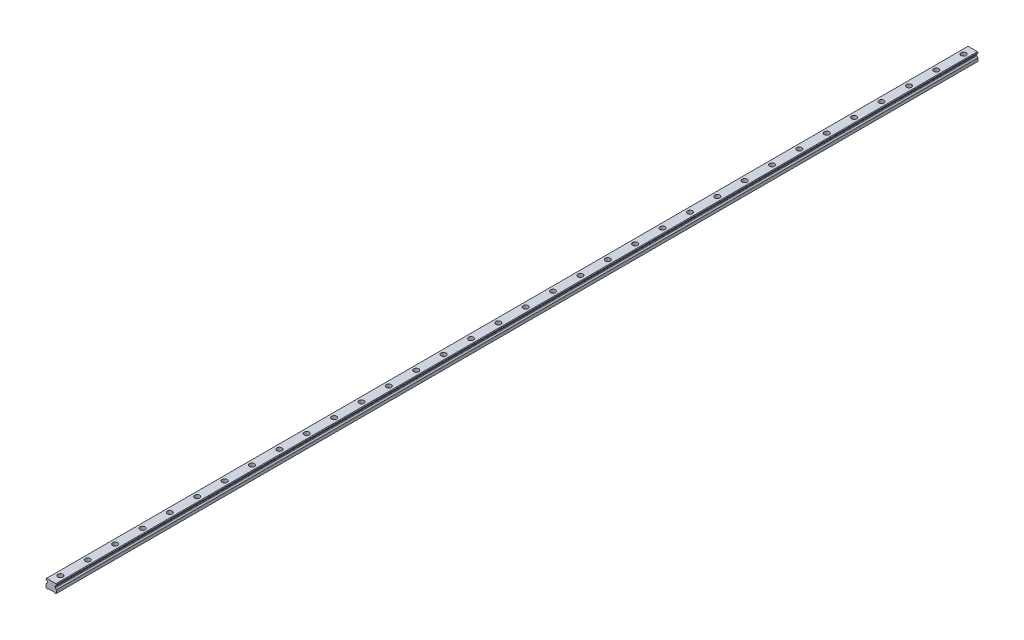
ISO-10303-21;
HEADER;
FILE_DESCRIPTION(('STEP AP214'),'2;1');
FILE_NAME('part.step','',(''),(''),'','','');
FILE_SCHEMA(('AUTOMOTIVE_DESIGN { 1 0 10303 214 1 1 1 1 }'));
ENDSEC;
DATA;
#1=APPLICATION_CONTEXT('core data for automotive mechanical design processes');
#2=APPLICATION_PROTOCOL_DEFINITION('international standard','automotive_design',2000,#1);
#3=PRODUCT_CONTEXT('',#1,'mechanical');
#4=PRODUCT('Part','Part','',(#3));
#5=PRODUCT_RELATED_PRODUCT_CATEGORY('part','',(#4));
#6=PRODUCT_DEFINITION_FORMATION('','',#4);
#7=PRODUCT_DEFINITION_CONTEXT('part definition',#1,'design');
#8=PRODUCT_DEFINITION('design','',#6,#7);
#9=PRODUCT_DEFINITION_SHAPE('','',#8);
#10=(LENGTH_UNIT() NAMED_UNIT(*) SI_UNIT(.MILLI.,.METRE.));
#11=(NAMED_UNIT(*) PLANE_ANGLE_UNIT() SI_UNIT($,.RADIAN.));
#12=(NAMED_UNIT(*) SI_UNIT($,.STERADIAN.) SOLID_ANGLE_UNIT());
#13=UNCERTAINTY_MEASURE_WITH_UNIT(LENGTH_MEASURE(1.E-05),#10,'distance_accuracy_value','');
#14=(GEOMETRIC_REPRESENTATION_CONTEXT(3) GLOBAL_UNCERTAINTY_ASSIGNED_CONTEXT((#13)) GLOBAL_UNIT_ASSIGNED_CONTEXT((#10,
#11,#12)) REPRESENTATION_CONTEXT('',''));
#15=CARTESIAN_POINT('',(0.,0.,0.));
#16=DIRECTION('',(0.,0.,1.));
#17=DIRECTION('',(1.,0.,0.));
#18=AXIS2_PLACEMENT_3D('',#15,#16,#17);
#19=CARTESIAN_POINT('',(0.,10.2,-990.));
#20=DIRECTION('',(0.,1.,0.));
#21=DIRECTION('',(0.,0.,1.));
#22=AXIS2_PLACEMENT_3D('',#19,#20,#21);
#23=PLANE('',#22);
#24=CARTESIAN_POINT('',(0.,10.2,-990.));
#25=DIRECTION('',(0.,1.,0.));
#26=DIRECTION('',(0.,0.,1.));
#27=AXIS2_PLACEMENT_3D('',#24,#25,#26);
#28=CIRCLE('',#27,3.5);
#29=CARTESIAN_POINT('',(0.,10.2,-986.5));
#30=VERTEX_POINT('',#29);
#31=EDGE_CURVE('E613',#30,#30,#28,.T.);
#32=ORIENTED_EDGE('',*,*,#31,.F.);
#33=EDGE_LOOP('',(#32));
#34=FACE_BOUND('',#33,.T.);
#35=CARTESIAN_POINT('',(0.,10.2,-990.));
#36=DIRECTION('',(0.,1.,0.));
#37=DIRECTION('',(0.,0.,1.));
#38=AXIS2_PLACEMENT_3D('',#35,#36,#37);
#39=CIRCLE('',#38,5.5);
#40=CARTESIAN_POINT('',(0.,10.2,-984.5));
#41=VERTEX_POINT('',#40);
#42=EDGE_CURVE('E11',#41,#41,#39,.T.);
#43=ORIENTED_EDGE('',*,*,#42,.T.);
#44=EDGE_LOOP('',(#43));
#45=FACE_BOUND('',#44,.T.);
#46=ADVANCED_FACE('F39',(#34,#45),#23,.T.);
#47=CARTESIAN_POINT('',(0.,10.2,-990.));
#48=DIRECTION('',(0.,1.,0.));
#49=DIRECTION('',(0.,0.,1.));
#50=AXIS2_PLACEMENT_3D('',#47,#48,#49);
#51=CYLINDRICAL_SURFACE('',#50,5.5);
#52=ORIENTED_EDGE('',*,*,#42,.F.);
#53=EDGE_LOOP('',(#52));
#54=FACE_BOUND('',#53,.T.);
#55=CARTESIAN_POINT('',(0.,19.2,-990.));
#56=DIRECTION('',(0.,1.,0.));
#57=DIRECTION('',(0.,0.,1.));
#58=AXIS2_PLACEMENT_3D('',#55,#56,#57);
#59=CIRCLE('',#58,5.5);
#60=CARTESIAN_POINT('',(0.,19.2,-984.5));
#61=VERTEX_POINT('',#60);
#62=EDGE_CURVE('E48',#61,#61,#59,.T.);
#63=ORIENTED_EDGE('',*,*,#62,.T.);
#64=EDGE_LOOP('',(#63));
#65=FACE_BOUND('',#64,.T.);
#66=ADVANCED_FACE('F1101',(#54,#65),#51,.F.);
#67=CARTESIAN_POINT('',(0.,10.2,-930.));
#68=DIRECTION('',(0.,1.,0.));
#69=DIRECTION('',(0.,0.,1.));
#70=AXIS2_PLACEMENT_3D('',#67,#68,#69);
#71=PLANE('',#70);
#72=CARTESIAN_POINT('',(0.,10.2,-930.));
#73=DIRECTION('',(0.,1.,0.));
#74=DIRECTION('',(0.,0.,1.));
#75=AXIS2_PLACEMENT_3D('',#72,#73,#74);
#76=CIRCLE('',#75,3.5);
#77=CARTESIAN_POINT('',(0.,10.2,-926.5));
#78=VERTEX_POINT('',#77);
#79=EDGE_CURVE('E618',#78,#78,#76,.T.);
#80=ORIENTED_EDGE('',*,*,#79,.F.);
#81=EDGE_LOOP('',(#80));
#82=FACE_BOUND('',#81,.T.);
#83=CARTESIAN_POINT('',(0.,10.2,-930.));
#84=DIRECTION('',(0.,1.,0.));
#85=DIRECTION('',(0.,0.,1.));
#86=AXIS2_PLACEMENT_3D('',#83,#84,#85);
#87=CIRCLE('',#86,5.5);
#88=CARTESIAN_POINT('',(0.,10.2,-924.5));
#89=VERTEX_POINT('',#88);
#90=EDGE_CURVE('E597',#89,#89,#87,.T.);
#91=ORIENTED_EDGE('',*,*,#90,.T.);
#92=EDGE_LOOP('',(#91));
#93=FACE_BOUND('',#92,.T.);
#94=ADVANCED_FACE('F1103',(#82,#93),#71,.T.);
#95=CARTESIAN_POINT('',(0.,10.2,-930.));
#96=DIRECTION('',(0.,1.,0.));
#97=DIRECTION('',(0.,0.,1.));
#98=AXIS2_PLACEMENT_3D('',#95,#96,#97);
#99=CYLINDRICAL_SURFACE('',#98,5.5);
#100=ORIENTED_EDGE('',*,*,#90,.F.);
#101=EDGE_LOOP('',(#100));
#102=FACE_BOUND('',#101,.T.);
#103=CARTESIAN_POINT('',(0.,19.2,-930.));
#104=DIRECTION('',(0.,1.,0.));
#105=DIRECTION('',(0.,0.,1.));
#106=AXIS2_PLACEMENT_3D('',#103,#104,#105);
#107=CIRCLE('',#106,5.5);
#108=CARTESIAN_POINT('',(0.,19.2,-924.5));
#109=VERTEX_POINT('',#108);
#110=EDGE_CURVE('E593',#109,#109,#107,.T.);
#111=ORIENTED_EDGE('',*,*,#110,.T.);
#112=EDGE_LOOP('',(#111));
#113=FACE_BOUND('',#112,.T.);
#114=ADVANCED_FACE('F1109',(#102,#113),#99,.F.);
#115=CARTESIAN_POINT('',(0.,10.2,-870.));
#116=DIRECTION('',(0.,1.,0.));
#117=DIRECTION('',(0.,0.,1.));
#118=AXIS2_PLACEMENT_3D('',#115,#116,#117);
#119=PLANE('',#118);
#120=CARTESIAN_POINT('',(0.,10.2,-870.));
#121=DIRECTION('',(0.,1.,0.));
#122=DIRECTION('',(0.,0.,1.));
#123=AXIS2_PLACEMENT_3D('',#120,#121,#122);
#124=CIRCLE('',#123,3.5);
#125=CARTESIAN_POINT('',(0.,10.2,-866.5));
#126=VERTEX_POINT('',#125);
#127=EDGE_CURVE('E623',#126,#126,#124,.T.);
#128=ORIENTED_EDGE('',*,*,#127,.F.);
#129=EDGE_LOOP('',(#128));
#130=FACE_BOUND('',#129,.T.);
#131=CARTESIAN_POINT('',(0.,10.2,-870.));
#132=DIRECTION('',(0.,1.,0.));
#133=DIRECTION('',(0.,0.,1.));
#134=AXIS2_PLACEMENT_3D('',#131,#132,#133);
#135=CIRCLE('',#134,5.5);
#136=CARTESIAN_POINT('',(0.,10.2,-864.5));
#137=VERTEX_POINT('',#136);
#138=EDGE_CURVE('E589',#137,#137,#135,.T.);
#139=ORIENTED_EDGE('',*,*,#138,.T.);
#140=EDGE_LOOP('',(#139));
#141=FACE_BOUND('',#140,.T.);
#142=ADVANCED_FACE('F1117',(#130,#141),#119,.T.);
#143=CARTESIAN_POINT('',(0.,10.2,-870.));
#144=DIRECTION('',(0.,1.,0.));
#145=DIRECTION('',(0.,0.,1.));
#146=AXIS2_PLACEMENT_3D('',#143,#144,#145);
#147=CYLINDRICAL_SURFACE('',#146,5.5);
#148=ORIENTED_EDGE('',*,*,#138,.F.);
#149=EDGE_LOOP('',(#148));
#150=FACE_BOUND('',#149,.T.);
#151=CARTESIAN_POINT('',(0.,19.2,-870.));
#152=DIRECTION('',(0.,1.,0.));
#153=DIRECTION('',(0.,0.,1.));
#154=AXIS2_PLACEMENT_3D('',#151,#152,#153);
#155=CIRCLE('',#154,5.5);
#156=CARTESIAN_POINT('',(0.,19.2,-864.5));
#157=VERTEX_POINT('',#156);
#158=EDGE_CURVE('E585',#157,#157,#155,.T.);
#159=ORIENTED_EDGE('',*,*,#158,.T.);
#160=EDGE_LOOP('',(#159));
#161=FACE_BOUND('',#160,.T.);
#162=ADVANCED_FACE('F1121',(#150,#161),#147,.F.);
#163=CARTESIAN_POINT('',(0.,10.2,-810.));
#164=DIRECTION('',(0.,1.,0.));
#165=DIRECTION('',(0.,0.,1.));
#166=AXIS2_PLACEMENT_3D('',#163,#164,#165);
#167=PLANE('',#166);
#168=CARTESIAN_POINT('',(0.,10.2,-810.));
#169=DIRECTION('',(0.,1.,0.));
#170=DIRECTION('',(0.,0.,1.));
#171=AXIS2_PLACEMENT_3D('',#168,#169,#170);
#172=CIRCLE('',#171,3.5);
#173=CARTESIAN_POINT('',(0.,10.2,-806.5));
#174=VERTEX_POINT('',#173);
#175=EDGE_CURVE('E628',#174,#174,#172,.T.);
#176=ORIENTED_EDGE('',*,*,#175,.F.);
#177=EDGE_LOOP('',(#176));
#178=FACE_BOUND('',#177,.T.);
#179=CARTESIAN_POINT('',(0.,10.2,-810.));
#180=DIRECTION('',(0.,1.,0.));
#181=DIRECTION('',(0.,0.,1.));
#182=AXIS2_PLACEMENT_3D('',#179,#180,#181);
#183=CIRCLE('',#182,5.5);
#184=CARTESIAN_POINT('',(0.,10.2,-804.5));
#185=VERTEX_POINT('',#184);
#186=EDGE_CURVE('E581',#185,#185,#183,.T.);
#187=ORIENTED_EDGE('',*,*,#186,.T.);
#188=EDGE_LOOP('',(#187));
#189=FACE_BOUND('',#188,.T.);
#190=ADVANCED_FACE('F1125',(#178,#189),#167,.T.);
#191=CARTESIAN_POINT('',(0.,10.2,-810.));
#192=DIRECTION('',(0.,1.,0.));
#193=DIRECTION('',(0.,0.,1.));
#194=AXIS2_PLACEMENT_3D('',#191,#192,#193);
#195=CYLINDRICAL_SURFACE('',#194,5.5);
#196=ORIENTED_EDGE('',*,*,#186,.F.);
#197=EDGE_LOOP('',(#196));
#198=FACE_BOUND('',#197,.T.);
#199=CARTESIAN_POINT('',(0.,19.2,-810.));
#200=DIRECTION('',(0.,1.,0.));
#201=DIRECTION('',(0.,0.,1.));
#202=AXIS2_PLACEMENT_3D('',#199,#200,#201);
#203=CIRCLE('',#202,5.5);
#204=CARTESIAN_POINT('',(0.,19.2,-804.5));
#205=VERTEX_POINT('',#204);
#206=EDGE_CURVE('E577',#205,#205,#203,.T.);
#207=ORIENTED_EDGE('',*,*,#206,.T.);
#208=EDGE_LOOP('',(#207));
#209=FACE_BOUND('',#208,.T.);
#210=ADVANCED_FACE('F1129',(#198,#209),#195,.F.);
#211=CARTESIAN_POINT('',(0.,10.2,-750.));
#212=DIRECTION('',(0.,1.,0.));
#213=DIRECTION('',(0.,0.,1.));
#214=AXIS2_PLACEMENT_3D('',#211,#212,#213);
#215=PLANE('',#214);
#216=CARTESIAN_POINT('',(0.,10.2,-750.));
#217=DIRECTION('',(0.,1.,0.));
#218=DIRECTION('',(0.,0.,1.));
#219=AXIS2_PLACEMENT_3D('',#216,#217,#218);
#220=CIRCLE('',#219,3.5);
#221=CARTESIAN_POINT('',(0.,10.2,-746.5));
#222=VERTEX_POINT('',#221);
#223=EDGE_CURVE('E633',#222,#222,#220,.T.);
#224=ORIENTED_EDGE('',*,*,#223,.F.);
#225=EDGE_LOOP('',(#224));
#226=FACE_BOUND('',#225,.T.);
#227=CARTESIAN_POINT('',(0.,10.2,-750.));
#228=DIRECTION('',(0.,1.,0.));
#229=DIRECTION('',(0.,0.,1.));
#230=AXIS2_PLACEMENT_3D('',#227,#228,#229);
#231=CIRCLE('',#230,5.5);
#232=CARTESIAN_POINT('',(0.,10.2,-744.5));
#233=VERTEX_POINT('',#232);
#234=EDGE_CURVE('E573',#233,#233,#231,.T.);
#235=ORIENTED_EDGE('',*,*,#234,.T.);
#236=EDGE_LOOP('',(#235));
#237=FACE_BOUND('',#236,.T.);
#238=ADVANCED_FACE('F1133',(#226,#237),#215,.T.);
#239=CARTESIAN_POINT('',(0.,10.2,-750.));
#240=DIRECTION('',(0.,1.,0.));
#241=DIRECTION('',(0.,0.,1.));
#242=AXIS2_PLACEMENT_3D('',#239,#240,#241);
#243=CYLINDRICAL_SURFACE('',#242,5.5);
#244=ORIENTED_EDGE('',*,*,#234,.F.);
#245=EDGE_LOOP('',(#244));
#246=FACE_BOUND('',#245,.T.);
#247=CARTESIAN_POINT('',(0.,19.2,-750.));
#248=DIRECTION('',(0.,1.,0.));
#249=DIRECTION('',(0.,0.,1.));
#250=AXIS2_PLACEMENT_3D('',#247,#248,#249);
#251=CIRCLE('',#250,5.5);
#252=CARTESIAN_POINT('',(0.,19.2,-744.5));
#253=VERTEX_POINT('',#252);
#254=EDGE_CURVE('E569',#253,#253,#251,.T.);
#255=ORIENTED_EDGE('',*,*,#254,.T.);
#256=EDGE_LOOP('',(#255));
#257=FACE_BOUND('',#256,.T.);
#258=ADVANCED_FACE('F1137',(#246,#257),#243,.F.);
#259=CARTESIAN_POINT('',(0.,10.2,-690.));
#260=DIRECTION('',(0.,1.,0.));
#261=DIRECTION('',(0.,0.,1.));
#262=AXIS2_PLACEMENT_3D('',#259,#260,#261);
#263=PLANE('',#262);
#264=CARTESIAN_POINT('',(0.,10.2,-690.));
#265=DIRECTION('',(0.,1.,0.));
#266=DIRECTION('',(0.,0.,1.));
#267=AXIS2_PLACEMENT_3D('',#264,#265,#266);
#268=CIRCLE('',#267,3.5);
#269=CARTESIAN_POINT('',(0.,10.2,-686.5));
#270=VERTEX_POINT('',#269);
#271=EDGE_CURVE('E638',#270,#270,#268,.T.);
#272=ORIENTED_EDGE('',*,*,#271,.F.);
#273=EDGE_LOOP('',(#272));
#274=FACE_BOUND('',#273,.T.);
#275=CARTESIAN_POINT('',(0.,10.2,-690.));
#276=DIRECTION('',(0.,1.,0.));
#277=DIRECTION('',(0.,0.,1.));
#278=AXIS2_PLACEMENT_3D('',#275,#276,#277);
#279=CIRCLE('',#278,5.5);
#280=CARTESIAN_POINT('',(0.,10.2,-684.5));
#281=VERTEX_POINT('',#280);
#282=EDGE_CURVE('E565',#281,#281,#279,.T.);
#283=ORIENTED_EDGE('',*,*,#282,.T.);
#284=EDGE_LOOP('',(#283));
#285=FACE_BOUND('',#284,.T.);
#286=ADVANCED_FACE('F1141',(#274,#285),#263,.T.);
#287=CARTESIAN_POINT('',(0.,10.2,-690.));
#288=DIRECTION('',(0.,1.,0.));
#289=DIRECTION('',(0.,0.,1.));
#290=AXIS2_PLACEMENT_3D('',#287,#288,#289);
#291=CYLINDRICAL_SURFACE('',#290,5.5);
#292=ORIENTED_EDGE('',*,*,#282,.F.);
#293=EDGE_LOOP('',(#292));
#294=FACE_BOUND('',#293,.T.);
#295=CARTESIAN_POINT('',(0.,19.2,-690.));
#296=DIRECTION('',(0.,1.,0.));
#297=DIRECTION('',(0.,0.,1.));
#298=AXIS2_PLACEMENT_3D('',#295,#296,#297);
#299=CIRCLE('',#298,5.5);
#300=CARTESIAN_POINT('',(0.,19.2,-684.5));
#301=VERTEX_POINT('',#300);
#302=EDGE_CURVE('E561',#301,#301,#299,.T.);
#303=ORIENTED_EDGE('',*,*,#302,.T.);
#304=EDGE_LOOP('',(#303));
#305=FACE_BOUND('',#304,.T.);
#306=ADVANCED_FACE('F1145',(#294,#305),#291,.F.);
#307=CARTESIAN_POINT('',(0.,10.2,-630.));
#308=DIRECTION('',(0.,1.,0.));
#309=DIRECTION('',(0.,0.,1.));
#310=AXIS2_PLACEMENT_3D('',#307,#308,#309);
#311=PLANE('',#310);
#312=CARTESIAN_POINT('',(0.,10.2,-630.));
#313=DIRECTION('',(0.,1.,0.));
#314=DIRECTION('',(0.,0.,1.));
#315=AXIS2_PLACEMENT_3D('',#312,#313,#314);
#316=CIRCLE('',#315,3.5);
#317=CARTESIAN_POINT('',(0.,10.2,-626.5));
#318=VERTEX_POINT('',#317);
#319=EDGE_CURVE('E643',#318,#318,#316,.T.);
#320=ORIENTED_EDGE('',*,*,#319,.F.);
#321=EDGE_LOOP('',(#320));
#322=FACE_BOUND('',#321,.T.);
#323=CARTESIAN_POINT('',(0.,10.2,-630.));
#324=DIRECTION('',(0.,1.,0.));
#325=DIRECTION('',(0.,0.,1.));
#326=AXIS2_PLACEMENT_3D('',#323,#324,#325);
#327=CIRCLE('',#326,5.5);
#328=CARTESIAN_POINT('',(0.,10.2,-624.5));
#329=VERTEX_POINT('',#328);
#330=EDGE_CURVE('E557',#329,#329,#327,.T.);
#331=ORIENTED_EDGE('',*,*,#330,.T.);
#332=EDGE_LOOP('',(#331));
#333=FACE_BOUND('',#332,.T.);
#334=ADVANCED_FACE('F1149',(#322,#333),#311,.T.);
#335=CARTESIAN_POINT('',(0.,10.2,-630.));
#336=DIRECTION('',(0.,1.,0.));
#337=DIRECTION('',(0.,0.,1.));
#338=AXIS2_PLACEMENT_3D('',#335,#336,#337);
#339=CYLINDRICAL_SURFACE('',#338,5.5);
#340=ORIENTED_EDGE('',*,*,#330,.F.);
#341=EDGE_LOOP('',(#340));
#342=FACE_BOUND('',#341,.T.);
#343=CARTESIAN_POINT('',(0.,19.2,-630.));
#344=DIRECTION('',(0.,1.,0.));
#345=DIRECTION('',(0.,0.,1.));
#346=AXIS2_PLACEMENT_3D('',#343,#344,#345);
#347=CIRCLE('',#346,5.5);
#348=CARTESIAN_POINT('',(0.,19.2,-624.5));
#349=VERTEX_POINT('',#348);
#350=EDGE_CURVE('E553',#349,#349,#347,.T.);
#351=ORIENTED_EDGE('',*,*,#350,.T.);
#352=EDGE_LOOP('',(#351));
#353=FACE_BOUND('',#352,.T.);
#354=ADVANCED_FACE('F1153',(#342,#353),#339,.F.);
#355=CARTESIAN_POINT('',(0.,10.2,-570.));
#356=DIRECTION('',(0.,1.,0.));
#357=DIRECTION('',(0.,0.,1.));
#358=AXIS2_PLACEMENT_3D('',#355,#356,#357);
#359=PLANE('',#358);
#360=CARTESIAN_POINT('',(0.,10.2,-570.));
#361=DIRECTION('',(0.,1.,0.));
#362=DIRECTION('',(0.,0.,1.));
#363=AXIS2_PLACEMENT_3D('',#360,#361,#362);
#364=CIRCLE('',#363,3.5);
#365=CARTESIAN_POINT('',(0.,10.2,-566.5));
#366=VERTEX_POINT('',#365);
#367=EDGE_CURVE('E648',#366,#366,#364,.T.);
#368=ORIENTED_EDGE('',*,*,#367,.F.);
#369=EDGE_LOOP('',(#368));
#370=FACE_BOUND('',#369,.T.);
#371=CARTESIAN_POINT('',(0.,10.2,-570.));
#372=DIRECTION('',(0.,1.,0.));
#373=DIRECTION('',(0.,0.,1.));
#374=AXIS2_PLACEMENT_3D('',#371,#372,#373);
#375=CIRCLE('',#374,5.5);
#376=CARTESIAN_POINT('',(0.,10.2,-564.5));
#377=VERTEX_POINT('',#376);
#378=EDGE_CURVE('E549',#377,#377,#375,.T.);
#379=ORIENTED_EDGE('',*,*,#378,.T.);
#380=EDGE_LOOP('',(#379));
#381=FACE_BOUND('',#380,.T.);
#382=ADVANCED_FACE('F1157',(#370,#381),#359,.T.);
#383=CARTESIAN_POINT('',(0.,10.2,-570.));
#384=DIRECTION('',(0.,1.,0.));
#385=DIRECTION('',(0.,0.,1.));
#386=AXIS2_PLACEMENT_3D('',#383,#384,#385);
#387=CYLINDRICAL_SURFACE('',#386,5.5);
#388=ORIENTED_EDGE('',*,*,#378,.F.);
#389=EDGE_LOOP('',(#388));
#390=FACE_BOUND('',#389,.T.);
#391=CARTESIAN_POINT('',(0.,19.2,-570.));
#392=DIRECTION('',(0.,1.,0.));
#393=DIRECTION('',(0.,0.,1.));
#394=AXIS2_PLACEMENT_3D('',#391,#392,#393);
#395=CIRCLE('',#394,5.5);
#396=CARTESIAN_POINT('',(0.,19.2,-564.5));
#397=VERTEX_POINT('',#396);
#398=EDGE_CURVE('E545',#397,#397,#395,.T.);
#399=ORIENTED_EDGE('',*,*,#398,.T.);
#400=EDGE_LOOP('',(#399));
#401=FACE_BOUND('',#400,.T.);
#402=ADVANCED_FACE('F1161',(#390,#401),#387,.F.);
#403=CARTESIAN_POINT('',(0.,10.2,-510.));
#404=DIRECTION('',(0.,1.,0.));
#405=DIRECTION('',(0.,0.,1.));
#406=AXIS2_PLACEMENT_3D('',#403,#404,#405);
#407=PLANE('',#406);
#408=CARTESIAN_POINT('',(0.,10.2,-510.));
#409=DIRECTION('',(0.,1.,0.));
#410=DIRECTION('',(0.,0.,1.));
#411=AXIS2_PLACEMENT_3D('',#408,#409,#410);
#412=CIRCLE('',#411,3.5);
#413=CARTESIAN_POINT('',(0.,10.2,-506.5));
#414=VERTEX_POINT('',#413);
#415=EDGE_CURVE('E653',#414,#414,#412,.T.);
#416=ORIENTED_EDGE('',*,*,#415,.F.);
#417=EDGE_LOOP('',(#416));
#418=FACE_BOUND('',#417,.T.);
#419=CARTESIAN_POINT('',(0.,10.2,-510.));
#420=DIRECTION('',(0.,1.,0.));
#421=DIRECTION('',(0.,0.,1.));
#422=AXIS2_PLACEMENT_3D('',#419,#420,#421);
#423=CIRCLE('',#422,5.5);
#424=CARTESIAN_POINT('',(0.,10.2,-504.5));
#425=VERTEX_POINT('',#424);
#426=EDGE_CURVE('E541',#425,#425,#423,.T.);
#427=ORIENTED_EDGE('',*,*,#426,.T.);
#428=EDGE_LOOP('',(#427));
#429=FACE_BOUND('',#428,.T.);
#430=ADVANCED_FACE('F1165',(#418,#429),#407,.T.);
#431=CARTESIAN_POINT('',(0.,10.2,-510.));
#432=DIRECTION('',(0.,1.,0.));
#433=DIRECTION('',(0.,0.,1.));
#434=AXIS2_PLACEMENT_3D('',#431,#432,#433);
#435=CYLINDRICAL_SURFACE('',#434,5.5);
#436=ORIENTED_EDGE('',*,*,#426,.F.);
#437=EDGE_LOOP('',(#436));
#438=FACE_BOUND('',#437,.T.);
#439=CARTESIAN_POINT('',(0.,19.2,-510.));
#440=DIRECTION('',(0.,1.,0.));
#441=DIRECTION('',(0.,0.,1.));
#442=AXIS2_PLACEMENT_3D('',#439,#440,#441);
#443=CIRCLE('',#442,5.5);
#444=CARTESIAN_POINT('',(0.,19.2,-504.5));
#445=VERTEX_POINT('',#444);
#446=EDGE_CURVE('E537',#445,#445,#443,.T.);
#447=ORIENTED_EDGE('',*,*,#446,.T.);
#448=EDGE_LOOP('',(#447));
#449=FACE_BOUND('',#448,.T.);
#450=ADVANCED_FACE('F1169',(#438,#449),#435,.F.);
#451=CARTESIAN_POINT('',(0.,10.2,-450.));
#452=DIRECTION('',(0.,1.,0.));
#453=DIRECTION('',(0.,0.,1.));
#454=AXIS2_PLACEMENT_3D('',#451,#452,#453);
#455=PLANE('',#454);
#456=CARTESIAN_POINT('',(0.,10.2,-450.));
#457=DIRECTION('',(0.,1.,0.));
#458=DIRECTION('',(0.,0.,1.));
#459=AXIS2_PLACEMENT_3D('',#456,#457,#458);
#460=CIRCLE('',#459,3.5);
#461=CARTESIAN_POINT('',(0.,10.2,-446.5));
#462=VERTEX_POINT('',#461);
#463=EDGE_CURVE('E658',#462,#462,#460,.T.);
#464=ORIENTED_EDGE('',*,*,#463,.F.);
#465=EDGE_LOOP('',(#464));
#466=FACE_BOUND('',#465,.T.);
#467=CARTESIAN_POINT('',(0.,10.2,-450.));
#468=DIRECTION('',(0.,1.,0.));
#469=DIRECTION('',(0.,0.,1.));
#470=AXIS2_PLACEMENT_3D('',#467,#468,#469);
#471=CIRCLE('',#470,5.5);
#472=CARTESIAN_POINT('',(0.,10.2,-444.5));
#473=VERTEX_POINT('',#472);
#474=EDGE_CURVE('E533',#473,#473,#471,.T.);
#475=ORIENTED_EDGE('',*,*,#474,.T.);
#476=EDGE_LOOP('',(#475));
#477=FACE_BOUND('',#476,.T.);
#478=ADVANCED_FACE('F1173',(#466,#477),#455,.T.);
#479=CARTESIAN_POINT('',(0.,10.2,-450.));
#480=DIRECTION('',(0.,1.,0.));
#481=DIRECTION('',(0.,0.,1.));
#482=AXIS2_PLACEMENT_3D('',#479,#480,#481);
#483=CYLINDRICAL_SURFACE('',#482,5.5);
#484=ORIENTED_EDGE('',*,*,#474,.F.);
#485=EDGE_LOOP('',(#484));
#486=FACE_BOUND('',#485,.T.);
#487=CARTESIAN_POINT('',(0.,19.2,-450.));
#488=DIRECTION('',(0.,1.,0.));
#489=DIRECTION('',(0.,0.,1.));
#490=AXIS2_PLACEMENT_3D('',#487,#488,#489);
#491=CIRCLE('',#490,5.5);
#492=CARTESIAN_POINT('',(0.,19.2,-444.5));
#493=VERTEX_POINT('',#492);
#494=EDGE_CURVE('E529',#493,#493,#491,.T.);
#495=ORIENTED_EDGE('',*,*,#494,.T.);
#496=EDGE_LOOP('',(#495));
#497=FACE_BOUND('',#496,.T.);
#498=ADVANCED_FACE('F1177',(#486,#497),#483,.F.);
#499=CARTESIAN_POINT('',(0.,10.2,-390.));
#500=DIRECTION('',(0.,1.,0.));
#501=DIRECTION('',(0.,0.,1.));
#502=AXIS2_PLACEMENT_3D('',#499,#500,#501);
#503=PLANE('',#502);
#504=CARTESIAN_POINT('',(0.,10.2,-390.));
#505=DIRECTION('',(0.,1.,0.));
#506=DIRECTION('',(0.,0.,1.));
#507=AXIS2_PLACEMENT_3D('',#504,#505,#506);
#508=CIRCLE('',#507,3.5);
#509=CARTESIAN_POINT('',(0.,10.2,-386.5));
#510=VERTEX_POINT('',#509);
#511=EDGE_CURVE('E663',#510,#510,#508,.T.);
#512=ORIENTED_EDGE('',*,*,#511,.F.);
#513=EDGE_LOOP('',(#512));
#514=FACE_BOUND('',#513,.T.);
#515=CARTESIAN_POINT('',(0.,10.2,-390.));
#516=DIRECTION('',(0.,1.,0.));
#517=DIRECTION('',(0.,0.,1.));
#518=AXIS2_PLACEMENT_3D('',#515,#516,#517);
#519=CIRCLE('',#518,5.5);
#520=CARTESIAN_POINT('',(0.,10.2,-384.5));
#521=VERTEX_POINT('',#520);
#522=EDGE_CURVE('E525',#521,#521,#519,.T.);
#523=ORIENTED_EDGE('',*,*,#522,.T.);
#524=EDGE_LOOP('',(#523));
#525=FACE_BOUND('',#524,.T.);
#526=ADVANCED_FACE('F1181',(#514,#525),#503,.T.);
#527=CARTESIAN_POINT('',(0.,10.2,-390.));
#528=DIRECTION('',(0.,1.,0.));
#529=DIRECTION('',(0.,0.,1.));
#530=AXIS2_PLACEMENT_3D('',#527,#528,#529);
#531=CYLINDRICAL_SURFACE('',#530,5.5);
#532=ORIENTED_EDGE('',*,*,#522,.F.);
#533=EDGE_LOOP('',(#532));
#534=FACE_BOUND('',#533,.T.);
#535=CARTESIAN_POINT('',(0.,19.2,-390.));
#536=DIRECTION('',(0.,1.,0.));
#537=DIRECTION('',(0.,0.,1.));
#538=AXIS2_PLACEMENT_3D('',#535,#536,#537);
#539=CIRCLE('',#538,5.5);
#540=CARTESIAN_POINT('',(0.,19.2,-384.5));
#541=VERTEX_POINT('',#540);
#542=EDGE_CURVE('E521',#541,#541,#539,.T.);
#543=ORIENTED_EDGE('',*,*,#542,.T.);
#544=EDGE_LOOP('',(#543));
#545=FACE_BOUND('',#544,.T.);
#546=ADVANCED_FACE('F1185',(#534,#545),#531,.F.);
#547=CARTESIAN_POINT('',(0.,10.2,-330.));
#548=DIRECTION('',(0.,1.,0.));
#549=DIRECTION('',(0.,0.,1.));
#550=AXIS2_PLACEMENT_3D('',#547,#548,#549);
#551=PLANE('',#550);
#552=CARTESIAN_POINT('',(0.,10.2,-330.));
#553=DIRECTION('',(0.,1.,0.));
#554=DIRECTION('',(0.,0.,1.));
#555=AXIS2_PLACEMENT_3D('',#552,#553,#554);
#556=CIRCLE('',#555,3.5);
#557=CARTESIAN_POINT('',(0.,10.2,-326.5));
#558=VERTEX_POINT('',#557);
#559=EDGE_CURVE('E668',#558,#558,#556,.T.);
#560=ORIENTED_EDGE('',*,*,#559,.F.);
#561=EDGE_LOOP('',(#560));
#562=FACE_BOUND('',#561,.T.);
#563=CARTESIAN_POINT('',(0.,10.2,-330.));
#564=DIRECTION('',(0.,1.,0.));
#565=DIRECTION('',(0.,0.,1.));
#566=AXIS2_PLACEMENT_3D('',#563,#564,#565);
#567=CIRCLE('',#566,5.5);
#568=CARTESIAN_POINT('',(0.,10.2,-324.5));
#569=VERTEX_POINT('',#568);
#570=EDGE_CURVE('E517',#569,#569,#567,.T.);
#571=ORIENTED_EDGE('',*,*,#570,.T.);
#572=EDGE_LOOP('',(#571));
#573=FACE_BOUND('',#572,.T.);
#574=ADVANCED_FACE('F1189',(#562,#573),#551,.T.);
#575=CARTESIAN_POINT('',(0.,10.2,-330.));
#576=DIRECTION('',(0.,1.,0.));
#577=DIRECTION('',(0.,0.,1.));
#578=AXIS2_PLACEMENT_3D('',#575,#576,#577);
#579=CYLINDRICAL_SURFACE('',#578,5.5);
#580=ORIENTED_EDGE('',*,*,#570,.F.);
#581=EDGE_LOOP('',(#580));
#582=FACE_BOUND('',#581,.T.);
#583=CARTESIAN_POINT('',(0.,19.2,-330.));
#584=DIRECTION('',(0.,1.,0.));
#585=DIRECTION('',(0.,0.,1.));
#586=AXIS2_PLACEMENT_3D('',#583,#584,#585);
#587=CIRCLE('',#586,5.5);
#588=CARTESIAN_POINT('',(0.,19.2,-324.5));
#589=VERTEX_POINT('',#588);
#590=EDGE_CURVE('E513',#589,#589,#587,.T.);
#591=ORIENTED_EDGE('',*,*,#590,.T.);
#592=EDGE_LOOP('',(#591));
#593=FACE_BOUND('',#592,.T.);
#594=ADVANCED_FACE('F1193',(#582,#593),#579,.F.);
#595=CARTESIAN_POINT('',(0.,10.2,-270.));
#596=DIRECTION('',(0.,1.,0.));
#597=DIRECTION('',(0.,0.,1.));
#598=AXIS2_PLACEMENT_3D('',#595,#596,#597);
#599=PLANE('',#598);
#600=CARTESIAN_POINT('',(0.,10.2,-270.));
#601=DIRECTION('',(0.,1.,0.));
#602=DIRECTION('',(0.,0.,1.));
#603=AXIS2_PLACEMENT_3D('',#600,#601,#602);
#604=CIRCLE('',#603,3.5);
#605=CARTESIAN_POINT('',(0.,10.2,-266.5));
#606=VERTEX_POINT('',#605);
#607=EDGE_CURVE('E673',#606,#606,#604,.T.);
#608=ORIENTED_EDGE('',*,*,#607,.F.);
#609=EDGE_LOOP('',(#608));
#610=FACE_BOUND('',#609,.T.);
#611=CARTESIAN_POINT('',(0.,10.2,-270.));
#612=DIRECTION('',(0.,1.,0.));
#613=DIRECTION('',(0.,0.,1.));
#614=AXIS2_PLACEMENT_3D('',#611,#612,#613);
#615=CIRCLE('',#614,5.5);
#616=CARTESIAN_POINT('',(0.,10.2,-264.5));
#617=VERTEX_POINT('',#616);
#618=EDGE_CURVE('E509',#617,#617,#615,.T.);
#619=ORIENTED_EDGE('',*,*,#618,.T.);
#620=EDGE_LOOP('',(#619));
#621=FACE_BOUND('',#620,.T.);
#622=ADVANCED_FACE('F1197',(#610,#621),#599,.T.);
#623=CARTESIAN_POINT('',(0.,10.2,-270.));
#624=DIRECTION('',(0.,1.,0.));
#625=DIRECTION('',(0.,0.,1.));
#626=AXIS2_PLACEMENT_3D('',#623,#624,#625);
#627=CYLINDRICAL_SURFACE('',#626,5.5);
#628=ORIENTED_EDGE('',*,*,#618,.F.);
#629=EDGE_LOOP('',(#628));
#630=FACE_BOUND('',#629,.T.);
#631=CARTESIAN_POINT('',(0.,19.2,-270.));
#632=DIRECTION('',(0.,1.,0.));
#633=DIRECTION('',(0.,0.,1.));
#634=AXIS2_PLACEMENT_3D('',#631,#632,#633);
#635=CIRCLE('',#634,5.5);
#636=CARTESIAN_POINT('',(0.,19.2,-264.5));
#637=VERTEX_POINT('',#636);
#638=EDGE_CURVE('E505',#637,#637,#635,.T.);
#639=ORIENTED_EDGE('',*,*,#638,.T.);
#640=EDGE_LOOP('',(#639));
#641=FACE_BOUND('',#640,.T.);
#642=ADVANCED_FACE('F1201',(#630,#641),#627,.F.);
#643=CARTESIAN_POINT('',(0.,10.2,-210.));
#644=DIRECTION('',(0.,1.,0.));
#645=DIRECTION('',(0.,0.,1.));
#646=AXIS2_PLACEMENT_3D('',#643,#644,#645);
#647=PLANE('',#646);
#648=CARTESIAN_POINT('',(0.,10.2,-210.));
#649=DIRECTION('',(0.,1.,0.));
#650=DIRECTION('',(0.,0.,1.));
#651=AXIS2_PLACEMENT_3D('',#648,#649,#650);
#652=CIRCLE('',#651,3.5);
#653=CARTESIAN_POINT('',(0.,10.2,-206.5));
#654=VERTEX_POINT('',#653);
#655=EDGE_CURVE('E678',#654,#654,#652,.T.);
#656=ORIENTED_EDGE('',*,*,#655,.F.);
#657=EDGE_LOOP('',(#656));
#658=FACE_BOUND('',#657,.T.);
#659=CARTESIAN_POINT('',(0.,10.2,-210.));
#660=DIRECTION('',(0.,1.,0.));
#661=DIRECTION('',(0.,0.,1.));
#662=AXIS2_PLACEMENT_3D('',#659,#660,#661);
#663=CIRCLE('',#662,5.5);
#664=CARTESIAN_POINT('',(0.,10.2,-204.5));
#665=VERTEX_POINT('',#664);
#666=EDGE_CURVE('E501',#665,#665,#663,.T.);
#667=ORIENTED_EDGE('',*,*,#666,.T.);
#668=EDGE_LOOP('',(#667));
#669=FACE_BOUND('',#668,.T.);
#670=ADVANCED_FACE('F1205',(#658,#669),#647,.T.);
#671=CARTESIAN_POINT('',(0.,10.2,-210.));
#672=DIRECTION('',(0.,1.,0.));
#673=DIRECTION('',(0.,0.,1.));
#674=AXIS2_PLACEMENT_3D('',#671,#672,#673);
#675=CYLINDRICAL_SURFACE('',#674,5.5);
#676=ORIENTED_EDGE('',*,*,#666,.F.);
#677=EDGE_LOOP('',(#676));
#678=FACE_BOUND('',#677,.T.);
#679=CARTESIAN_POINT('',(0.,19.2,-210.));
#680=DIRECTION('',(0.,1.,0.));
#681=DIRECTION('',(0.,0.,1.));
#682=AXIS2_PLACEMENT_3D('',#679,#680,#681);
#683=CIRCLE('',#682,5.5);
#684=CARTESIAN_POINT('',(0.,19.2,-204.5));
#685=VERTEX_POINT('',#684);
#686=EDGE_CURVE('E497',#685,#685,#683,.T.);
#687=ORIENTED_EDGE('',*,*,#686,.T.);
#688=EDGE_LOOP('',(#687));
#689=FACE_BOUND('',#688,.T.);
#690=ADVANCED_FACE('F1209',(#678,#689),#675,.F.);
#691=CARTESIAN_POINT('',(0.,10.2,-150.));
#692=DIRECTION('',(0.,1.,0.));
#693=DIRECTION('',(0.,0.,1.));
#694=AXIS2_PLACEMENT_3D('',#691,#692,#693);
#695=PLANE('',#694);
#696=CARTESIAN_POINT('',(0.,10.2,-150.));
#697=DIRECTION('',(0.,1.,0.));
#698=DIRECTION('',(0.,0.,1.));
#699=AXIS2_PLACEMENT_3D('',#696,#697,#698);
#700=CIRCLE('',#699,3.5);
#701=CARTESIAN_POINT('',(0.,10.2,-146.5));
#702=VERTEX_POINT('',#701);
#703=EDGE_CURVE('E683',#702,#702,#700,.T.);
#704=ORIENTED_EDGE('',*,*,#703,.F.);
#705=EDGE_LOOP('',(#704));
#706=FACE_BOUND('',#705,.T.);
#707=CARTESIAN_POINT('',(0.,10.2,-150.));
#708=DIRECTION('',(0.,1.,0.));
#709=DIRECTION('',(0.,0.,1.));
#710=AXIS2_PLACEMENT_3D('',#707,#708,#709);
#711=CIRCLE('',#710,5.5);
#712=CARTESIAN_POINT('',(0.,10.2,-144.5));
#713=VERTEX_POINT('',#712);
#714=EDGE_CURVE('E493',#713,#713,#711,.T.);
#715=ORIENTED_EDGE('',*,*,#714,.T.);
#716=EDGE_LOOP('',(#715));
#717=FACE_BOUND('',#716,.T.);
#718=ADVANCED_FACE('F1213',(#706,#717),#695,.T.);
#719=CARTESIAN_POINT('',(0.,10.2,-150.));
#720=DIRECTION('',(0.,1.,0.));
#721=DIRECTION('',(0.,0.,1.));
#722=AXIS2_PLACEMENT_3D('',#719,#720,#721);
#723=CYLINDRICAL_SURFACE('',#722,5.5);
#724=ORIENTED_EDGE('',*,*,#714,.F.);
#725=EDGE_LOOP('',(#724));
#726=FACE_BOUND('',#725,.T.);
#727=CARTESIAN_POINT('',(0.,19.2,-150.));
#728=DIRECTION('',(0.,1.,0.));
#729=DIRECTION('',(0.,0.,1.));
#730=AXIS2_PLACEMENT_3D('',#727,#728,#729);
#731=CIRCLE('',#730,5.5);
#732=CARTESIAN_POINT('',(0.,19.2,-144.5));
#733=VERTEX_POINT('',#732);
#734=EDGE_CURVE('E489',#733,#733,#731,.T.);
#735=ORIENTED_EDGE('',*,*,#734,.T.);
#736=EDGE_LOOP('',(#735));
#737=FACE_BOUND('',#736,.T.);
#738=ADVANCED_FACE('F1217',(#726,#737),#723,.F.);
#739=CARTESIAN_POINT('',(0.,10.2,-90.0000000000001));
#740=DIRECTION('',(0.,1.,0.));
#741=DIRECTION('',(0.,0.,1.));
#742=AXIS2_PLACEMENT_3D('',#739,#740,#741);
#743=PLANE('',#742);
#744=CARTESIAN_POINT('',(0.,10.2,-90.0000000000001));
#745=DIRECTION('',(0.,1.,0.));
#746=DIRECTION('',(0.,0.,1.));
#747=AXIS2_PLACEMENT_3D('',#744,#745,#746);
#748=CIRCLE('',#747,3.5);
#749=CARTESIAN_POINT('',(0.,10.2,-86.5000000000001));
#750=VERTEX_POINT('',#749);
#751=EDGE_CURVE('E688',#750,#750,#748,.T.);
#752=ORIENTED_EDGE('',*,*,#751,.F.);
#753=EDGE_LOOP('',(#752));
#754=FACE_BOUND('',#753,.T.);
#755=CARTESIAN_POINT('',(0.,10.2,-90.0000000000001));
#756=DIRECTION('',(0.,1.,0.));
#757=DIRECTION('',(0.,0.,1.));
#758=AXIS2_PLACEMENT_3D('',#755,#756,#757);
#759=CIRCLE('',#758,5.5);
#760=CARTESIAN_POINT('',(0.,10.2,-84.5000000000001));
#761=VERTEX_POINT('',#760);
#762=EDGE_CURVE('E485',#761,#761,#759,.T.);
#763=ORIENTED_EDGE('',*,*,#762,.T.);
#764=EDGE_LOOP('',(#763));
#765=FACE_BOUND('',#764,.T.);
#766=ADVANCED_FACE('F1221',(#754,#765),#743,.T.);
#767=CARTESIAN_POINT('',(0.,10.2,-90.0000000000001));
#768=DIRECTION('',(0.,1.,0.));
#769=DIRECTION('',(0.,0.,1.));
#770=AXIS2_PLACEMENT_3D('',#767,#768,#769);
#771=CYLINDRICAL_SURFACE('',#770,5.5);
#772=ORIENTED_EDGE('',*,*,#762,.F.);
#773=EDGE_LOOP('',(#772));
#774=FACE_BOUND('',#773,.T.);
#775=CARTESIAN_POINT('',(0.,19.2,-90.0000000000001));
#776=DIRECTION('',(0.,1.,0.));
#777=DIRECTION('',(0.,0.,1.));
#778=AXIS2_PLACEMENT_3D('',#775,#776,#777);
#779=CIRCLE('',#778,5.5);
#780=CARTESIAN_POINT('',(0.,19.2,-84.5000000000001));
#781=VERTEX_POINT('',#780);
#782=EDGE_CURVE('E481',#781,#781,#779,.T.);
#783=ORIENTED_EDGE('',*,*,#782,.T.);
#784=EDGE_LOOP('',(#783));
#785=FACE_BOUND('',#784,.T.);
#786=ADVANCED_FACE('F1225',(#774,#785),#771,.F.);
#787=CARTESIAN_POINT('',(0.,10.2,-30.));
#788=DIRECTION('',(0.,1.,0.));
#789=DIRECTION('',(0.,0.,1.));
#790=AXIS2_PLACEMENT_3D('',#787,#788,#789);
#791=PLANE('',#790);
#792=CARTESIAN_POINT('',(0.,10.2,-30.));
#793=DIRECTION('',(0.,1.,0.));
#794=DIRECTION('',(0.,0.,1.));
#795=AXIS2_PLACEMENT_3D('',#792,#793,#794);
#796=CIRCLE('',#795,3.5);
#797=CARTESIAN_POINT('',(0.,10.2,-26.5));
#798=VERTEX_POINT('',#797);
#799=EDGE_CURVE('E693',#798,#798,#796,.T.);
#800=ORIENTED_EDGE('',*,*,#799,.F.);
#801=EDGE_LOOP('',(#800));
#802=FACE_BOUND('',#801,.T.);
#803=CARTESIAN_POINT('',(0.,10.2,-30.));
#804=DIRECTION('',(0.,1.,0.));
#805=DIRECTION('',(0.,0.,1.));
#806=AXIS2_PLACEMENT_3D('',#803,#804,#805);
#807=CIRCLE('',#806,5.5);
#808=CARTESIAN_POINT('',(0.,10.2,-24.5));
#809=VERTEX_POINT('',#808);
#810=EDGE_CURVE('E477',#809,#809,#807,.T.);
#811=ORIENTED_EDGE('',*,*,#810,.T.);
#812=EDGE_LOOP('',(#811));
#813=FACE_BOUND('',#812,.T.);
#814=ADVANCED_FACE('F1229',(#802,#813),#791,.T.);
#815=CARTESIAN_POINT('',(0.,10.2,-30.));
#816=DIRECTION('',(0.,1.,0.));
#817=DIRECTION('',(0.,0.,1.));
#818=AXIS2_PLACEMENT_3D('',#815,#816,#817);
#819=CYLINDRICAL_SURFACE('',#818,5.5);
#820=ORIENTED_EDGE('',*,*,#810,.F.);
#821=EDGE_LOOP('',(#820));
#822=FACE_BOUND('',#821,.T.);
#823=CARTESIAN_POINT('',(0.,19.2,-30.));
#824=DIRECTION('',(0.,1.,0.));
#825=DIRECTION('',(0.,0.,1.));
#826=AXIS2_PLACEMENT_3D('',#823,#824,#825);
#827=CIRCLE('',#826,5.5);
#828=CARTESIAN_POINT('',(0.,19.2,-24.5));
#829=VERTEX_POINT('',#828);
#830=EDGE_CURVE('E473',#829,#829,#827,.T.);
#831=ORIENTED_EDGE('',*,*,#830,.T.);
#832=EDGE_LOOP('',(#831));
#833=FACE_BOUND('',#832,.T.);
#834=ADVANCED_FACE('F1233',(#822,#833),#819,.F.);
#835=CARTESIAN_POINT('',(0.,10.2,30.));
#836=DIRECTION('',(0.,1.,0.));
#837=DIRECTION('',(0.,0.,1.));
#838=AXIS2_PLACEMENT_3D('',#835,#836,#837);
#839=PLANE('',#838);
#840=CARTESIAN_POINT('',(0.,10.2,30.));
#841=DIRECTION('',(0.,1.,0.));
#842=DIRECTION('',(0.,0.,1.));
#843=AXIS2_PLACEMENT_3D('',#840,#841,#842);
#844=CIRCLE('',#843,3.5);
#845=CARTESIAN_POINT('',(0.,10.2,33.5));
#846=VERTEX_POINT('',#845);
#847=EDGE_CURVE('E698',#846,#846,#844,.T.);
#848=ORIENTED_EDGE('',*,*,#847,.F.);
#849=EDGE_LOOP('',(#848));
#850=FACE_BOUND('',#849,.T.);
#851=CARTESIAN_POINT('',(0.,10.2,30.));
#852=DIRECTION('',(0.,1.,0.));
#853=DIRECTION('',(0.,0.,1.));
#854=AXIS2_PLACEMENT_3D('',#851,#852,#853);
#855=CIRCLE('',#854,5.5);
#856=CARTESIAN_POINT('',(0.,10.2,35.5));
#857=VERTEX_POINT('',#856);
#858=EDGE_CURVE('E469',#857,#857,#855,.T.);
#859=ORIENTED_EDGE('',*,*,#858,.T.);
#860=EDGE_LOOP('',(#859));
#861=FACE_BOUND('',#860,.T.);
#862=ADVANCED_FACE('F1237',(#850,#861),#839,.T.);
#863=CARTESIAN_POINT('',(0.,10.2,30.));
#864=DIRECTION('',(0.,1.,0.));
#865=DIRECTION('',(0.,0.,1.));
#866=AXIS2_PLACEMENT_3D('',#863,#864,#865);
#867=CYLINDRICAL_SURFACE('',#866,5.5);
#868=ORIENTED_EDGE('',*,*,#858,.F.);
#869=EDGE_LOOP('',(#868));
#870=FACE_BOUND('',#869,.T.);
#871=CARTESIAN_POINT('',(0.,19.2,30.));
#872=DIRECTION('',(0.,1.,0.));
#873=DIRECTION('',(0.,0.,1.));
#874=AXIS2_PLACEMENT_3D('',#871,#872,#873);
#875=CIRCLE('',#874,5.5);
#876=CARTESIAN_POINT('',(0.,19.2,35.5));
#877=VERTEX_POINT('',#876);
#878=EDGE_CURVE('E465',#877,#877,#875,.T.);
#879=ORIENTED_EDGE('',*,*,#878,.T.);
#880=EDGE_LOOP('',(#879));
#881=FACE_BOUND('',#880,.T.);
#882=ADVANCED_FACE('F1241',(#870,#881),#867,.F.);
#883=CARTESIAN_POINT('',(0.,10.2,90.0000000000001));
#884=DIRECTION('',(0.,1.,0.));
#885=DIRECTION('',(0.,0.,1.));
#886=AXIS2_PLACEMENT_3D('',#883,#884,#885);
#887=PLANE('',#886);
#888=CARTESIAN_POINT('',(0.,10.2,90.0000000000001));
#889=DIRECTION('',(0.,1.,0.));
#890=DIRECTION('',(0.,0.,1.));
#891=AXIS2_PLACEMENT_3D('',#888,#889,#890);
#892=CIRCLE('',#891,3.5);
#893=CARTESIAN_POINT('',(0.,10.2,93.5000000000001));
#894=VERTEX_POINT('',#893);
#895=EDGE_CURVE('E703',#894,#894,#892,.T.);
#896=ORIENTED_EDGE('',*,*,#895,.F.);
#897=EDGE_LOOP('',(#896));
#898=FACE_BOUND('',#897,.T.);
#899=CARTESIAN_POINT('',(0.,10.2,90.0000000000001));
#900=DIRECTION('',(0.,1.,0.));
#901=DIRECTION('',(0.,0.,1.));
#902=AXIS2_PLACEMENT_3D('',#899,#900,#901);
#903=CIRCLE('',#902,5.5);
#904=CARTESIAN_POINT('',(0.,10.2,95.5000000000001));
#905=VERTEX_POINT('',#904);
#906=EDGE_CURVE('E461',#905,#905,#903,.T.);
#907=ORIENTED_EDGE('',*,*,#906,.T.);
#908=EDGE_LOOP('',(#907));
#909=FACE_BOUND('',#908,.T.);
#910=ADVANCED_FACE('F1245',(#898,#909),#887,.T.);
#911=CARTESIAN_POINT('',(0.,10.2,90.0000000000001));
#912=DIRECTION('',(0.,1.,0.));
#913=DIRECTION('',(0.,0.,1.));
#914=AXIS2_PLACEMENT_3D('',#911,#912,#913);
#915=CYLINDRICAL_SURFACE('',#914,5.5);
#916=ORIENTED_EDGE('',*,*,#906,.F.);
#917=EDGE_LOOP('',(#916));
#918=FACE_BOUND('',#917,.T.);
#919=CARTESIAN_POINT('',(0.,19.2,90.0000000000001));
#920=DIRECTION('',(0.,1.,0.));
#921=DIRECTION('',(0.,0.,1.));
#922=AXIS2_PLACEMENT_3D('',#919,#920,#921);
#923=CIRCLE('',#922,5.5);
#924=CARTESIAN_POINT('',(0.,19.2,95.5000000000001));
#925=VERTEX_POINT('',#924);
#926=EDGE_CURVE('E457',#925,#925,#923,.T.);
#927=ORIENTED_EDGE('',*,*,#926,.T.);
#928=EDGE_LOOP('',(#927));
#929=FACE_BOUND('',#928,.T.);
#930=ADVANCED_FACE('F1249',(#918,#929),#915,.F.);
#931=CARTESIAN_POINT('',(0.,10.2,150.));
#932=DIRECTION('',(0.,1.,0.));
#933=DIRECTION('',(0.,0.,1.));
#934=AXIS2_PLACEMENT_3D('',#931,#932,#933);
#935=PLANE('',#934);
#936=CARTESIAN_POINT('',(0.,10.2,150.));
#937=DIRECTION('',(0.,1.,0.));
#938=DIRECTION('',(0.,0.,1.));
#939=AXIS2_PLACEMENT_3D('',#936,#937,#938);
#940=CIRCLE('',#939,3.5);
#941=CARTESIAN_POINT('',(0.,10.2,153.5));
#942=VERTEX_POINT('',#941);
#943=EDGE_CURVE('E708',#942,#942,#940,.T.);
#944=ORIENTED_EDGE('',*,*,#943,.F.);
#945=EDGE_LOOP('',(#944));
#946=FACE_BOUND('',#945,.T.);
#947=CARTESIAN_POINT('',(0.,10.2,150.));
#948=DIRECTION('',(0.,1.,0.));
#949=DIRECTION('',(0.,0.,1.));
#950=AXIS2_PLACEMENT_3D('',#947,#948,#949);
#951=CIRCLE('',#950,5.5);
#952=CARTESIAN_POINT('',(0.,10.2,155.5));
#953=VERTEX_POINT('',#952);
#954=EDGE_CURVE('E453',#953,#953,#951,.T.);
#955=ORIENTED_EDGE('',*,*,#954,.T.);
#956=EDGE_LOOP('',(#955));
#957=FACE_BOUND('',#956,.T.);
#958=ADVANCED_FACE('F1253',(#946,#957),#935,.T.);
#959=CARTESIAN_POINT('',(0.,10.2,150.));
#960=DIRECTION('',(0.,1.,0.));
#961=DIRECTION('',(0.,0.,1.));
#962=AXIS2_PLACEMENT_3D('',#959,#960,#961);
#963=CYLINDRICAL_SURFACE('',#962,5.5);
#964=ORIENTED_EDGE('',*,*,#954,.F.);
#965=EDGE_LOOP('',(#964));
#966=FACE_BOUND('',#965,.T.);
#967=CARTESIAN_POINT('',(0.,19.2,150.));
#968=DIRECTION('',(0.,1.,0.));
#969=DIRECTION('',(0.,0.,1.));
#970=AXIS2_PLACEMENT_3D('',#967,#968,#969);
#971=CIRCLE('',#970,5.5);
#972=CARTESIAN_POINT('',(0.,19.2,155.5));
#973=VERTEX_POINT('',#972);
#974=EDGE_CURVE('E449',#973,#973,#971,.T.);
#975=ORIENTED_EDGE('',*,*,#974,.T.);
#976=EDGE_LOOP('',(#975));
#977=FACE_BOUND('',#976,.T.);
#978=ADVANCED_FACE('F1257',(#966,#977),#963,.F.);
#979=CARTESIAN_POINT('',(0.,10.2,210.));
#980=DIRECTION('',(0.,1.,0.));
#981=DIRECTION('',(0.,0.,1.));
#982=AXIS2_PLACEMENT_3D('',#979,#980,#981);
#983=PLANE('',#982);
#984=CARTESIAN_POINT('',(0.,10.2,210.));
#985=DIRECTION('',(0.,1.,0.));
#986=DIRECTION('',(0.,0.,1.));
#987=AXIS2_PLACEMENT_3D('',#984,#985,#986);
#988=CIRCLE('',#987,3.5);
#989=CARTESIAN_POINT('',(0.,10.2,213.5));
#990=VERTEX_POINT('',#989);
#991=EDGE_CURVE('E713',#990,#990,#988,.T.);
#992=ORIENTED_EDGE('',*,*,#991,.F.);
#993=EDGE_LOOP('',(#992));
#994=FACE_BOUND('',#993,.T.);
#995=CARTESIAN_POINT('',(0.,10.2,210.));
#996=DIRECTION('',(0.,1.,0.));
#997=DIRECTION('',(0.,0.,1.));
#998=AXIS2_PLACEMENT_3D('',#995,#996,#997);
#999=CIRCLE('',#998,5.5);
#1000=CARTESIAN_POINT('',(0.,10.2,215.5));
#1001=VERTEX_POINT('',#1000);
#1002=EDGE_CURVE('E445',#1001,#1001,#999,.T.);
#1003=ORIENTED_EDGE('',*,*,#1002,.T.);
#1004=EDGE_LOOP('',(#1003));
#1005=FACE_BOUND('',#1004,.T.);
#1006=ADVANCED_FACE('F1261',(#994,#1005),#983,.T.);
#1007=CARTESIAN_POINT('',(0.,10.2,210.));
#1008=DIRECTION('',(0.,1.,0.));
#1009=DIRECTION('',(0.,0.,1.));
#1010=AXIS2_PLACEMENT_3D('',#1007,#1008,#1009);
#1011=CYLINDRICAL_SURFACE('',#1010,5.5);
#1012=ORIENTED_EDGE('',*,*,#1002,.F.);
#1013=EDGE_LOOP('',(#1012));
#1014=FACE_BOUND('',#1013,.T.);
#1015=CARTESIAN_POINT('',(0.,19.2,210.));
#1016=DIRECTION('',(0.,1.,0.));
#1017=DIRECTION('',(0.,0.,1.));
#1018=AXIS2_PLACEMENT_3D('',#1015,#1016,#1017);
#1019=CIRCLE('',#1018,5.5);
#1020=CARTESIAN_POINT('',(0.,19.2,215.5));
#1021=VERTEX_POINT('',#1020);
#1022=EDGE_CURVE('E441',#1021,#1021,#1019,.T.);
#1023=ORIENTED_EDGE('',*,*,#1022,.T.);
#1024=EDGE_LOOP('',(#1023));
#1025=FACE_BOUND('',#1024,.T.);
#1026=ADVANCED_FACE('F1265',(#1014,#1025),#1011,.F.);
#1027=CARTESIAN_POINT('',(0.,10.2,270.));
#1028=DIRECTION('',(0.,1.,0.));
#1029=DIRECTION('',(0.,0.,1.));
#1030=AXIS2_PLACEMENT_3D('',#1027,#1028,#1029);
#1031=PLANE('',#1030);
#1032=CARTESIAN_POINT('',(0.,10.2,270.));
#1033=DIRECTION('',(0.,1.,0.));
#1034=DIRECTION('',(0.,0.,1.));
#1035=AXIS2_PLACEMENT_3D('',#1032,#1033,#1034);
#1036=CIRCLE('',#1035,3.5);
#1037=CARTESIAN_POINT('',(0.,10.2,273.5));
#1038=VERTEX_POINT('',#1037);
#1039=EDGE_CURVE('E718',#1038,#1038,#1036,.T.);
#1040=ORIENTED_EDGE('',*,*,#1039,.F.);
#1041=EDGE_LOOP('',(#1040));
#1042=FACE_BOUND('',#1041,.T.);
#1043=CARTESIAN_POINT('',(0.,10.2,270.));
#1044=DIRECTION('',(0.,1.,0.));
#1045=DIRECTION('',(0.,0.,1.));
#1046=AXIS2_PLACEMENT_3D('',#1043,#1044,#1045);
#1047=CIRCLE('',#1046,5.5);
#1048=CARTESIAN_POINT('',(0.,10.2,275.5));
#1049=VERTEX_POINT('',#1048);
#1050=EDGE_CURVE('E437',#1049,#1049,#1047,.T.);
#1051=ORIENTED_EDGE('',*,*,#1050,.T.);
#1052=EDGE_LOOP('',(#1051));
#1053=FACE_BOUND('',#1052,.T.);
#1054=ADVANCED_FACE('F1269',(#1042,#1053),#1031,.T.);
#1055=CARTESIAN_POINT('',(0.,10.2,270.));
#1056=DIRECTION('',(0.,1.,0.));
#1057=DIRECTION('',(0.,0.,1.));
#1058=AXIS2_PLACEMENT_3D('',#1055,#1056,#1057);
#1059=CYLINDRICAL_SURFACE('',#1058,5.5);
#1060=ORIENTED_EDGE('',*,*,#1050,.F.);
#1061=EDGE_LOOP('',(#1060));
#1062=FACE_BOUND('',#1061,.T.);
#1063=CARTESIAN_POINT('',(0.,19.2,270.));
#1064=DIRECTION('',(0.,1.,0.));
#1065=DIRECTION('',(0.,0.,1.));
#1066=AXIS2_PLACEMENT_3D('',#1063,#1064,#1065);
#1067=CIRCLE('',#1066,5.5);
#1068=CARTESIAN_POINT('',(0.,19.2,275.5));
#1069=VERTEX_POINT('',#1068);
#1070=EDGE_CURVE('E433',#1069,#1069,#1067,.T.);
#1071=ORIENTED_EDGE('',*,*,#1070,.T.);
#1072=EDGE_LOOP('',(#1071));
#1073=FACE_BOUND('',#1072,.T.);
#1074=ADVANCED_FACE('F1273',(#1062,#1073),#1059,.F.);
#1075=CARTESIAN_POINT('',(0.,10.2,330.));
#1076=DIRECTION('',(0.,1.,0.));
#1077=DIRECTION('',(0.,0.,1.));
#1078=AXIS2_PLACEMENT_3D('',#1075,#1076,#1077);
#1079=PLANE('',#1078);
#1080=CARTESIAN_POINT('',(0.,10.2,330.));
#1081=DIRECTION('',(0.,1.,0.));
#1082=DIRECTION('',(0.,0.,1.));
#1083=AXIS2_PLACEMENT_3D('',#1080,#1081,#1082);
#1084=CIRCLE('',#1083,3.5);
#1085=CARTESIAN_POINT('',(0.,10.2,333.5));
#1086=VERTEX_POINT('',#1085);
#1087=EDGE_CURVE('E723',#1086,#1086,#1084,.T.);
#1088=ORIENTED_EDGE('',*,*,#1087,.F.);
#1089=EDGE_LOOP('',(#1088));
#1090=FACE_BOUND('',#1089,.T.);
#1091=CARTESIAN_POINT('',(0.,10.2,330.));
#1092=DIRECTION('',(0.,1.,0.));
#1093=DIRECTION('',(0.,0.,1.));
#1094=AXIS2_PLACEMENT_3D('',#1091,#1092,#1093);
#1095=CIRCLE('',#1094,5.5);
#1096=CARTESIAN_POINT('',(0.,10.2,335.5));
#1097=VERTEX_POINT('',#1096);
#1098=EDGE_CURVE('E429',#1097,#1097,#1095,.T.);
#1099=ORIENTED_EDGE('',*,*,#1098,.T.);
#1100=EDGE_LOOP('',(#1099));
#1101=FACE_BOUND('',#1100,.T.);
#1102=ADVANCED_FACE('F1277',(#1090,#1101),#1079,.T.);
#1103=CARTESIAN_POINT('',(0.,10.2,330.));
#1104=DIRECTION('',(0.,1.,0.));
#1105=DIRECTION('',(0.,0.,1.));
#1106=AXIS2_PLACEMENT_3D('',#1103,#1104,#1105);
#1107=CYLINDRICAL_SURFACE('',#1106,5.5);
#1108=ORIENTED_EDGE('',*,*,#1098,.F.);
#1109=EDGE_LOOP('',(#1108));
#1110=FACE_BOUND('',#1109,.T.);
#1111=CARTESIAN_POINT('',(0.,19.2,330.));
#1112=DIRECTION('',(0.,1.,0.));
#1113=DIRECTION('',(0.,0.,1.));
#1114=AXIS2_PLACEMENT_3D('',#1111,#1112,#1113);
#1115=CIRCLE('',#1114,5.5);
#1116=CARTESIAN_POINT('',(0.,19.2,335.5));
#1117=VERTEX_POINT('',#1116);
#1118=EDGE_CURVE('E425',#1117,#1117,#1115,.T.);
#1119=ORIENTED_EDGE('',*,*,#1118,.T.);
#1120=EDGE_LOOP('',(#1119));
#1121=FACE_BOUND('',#1120,.T.);
#1122=ADVANCED_FACE('F1281',(#1110,#1121),#1107,.F.);
#1123=CARTESIAN_POINT('',(0.,10.2,390.));
#1124=DIRECTION('',(0.,1.,0.));
#1125=DIRECTION('',(0.,0.,1.));
#1126=AXIS2_PLACEMENT_3D('',#1123,#1124,#1125);
#1127=PLANE('',#1126);
#1128=CARTESIAN_POINT('',(0.,10.2,390.));
#1129=DIRECTION('',(0.,1.,0.));
#1130=DIRECTION('',(0.,0.,1.));
#1131=AXIS2_PLACEMENT_3D('',#1128,#1129,#1130);
#1132=CIRCLE('',#1131,3.5);
#1133=CARTESIAN_POINT('',(0.,10.2,393.5));
#1134=VERTEX_POINT('',#1133);
#1135=EDGE_CURVE('E728',#1134,#1134,#1132,.T.);
#1136=ORIENTED_EDGE('',*,*,#1135,.F.);
#1137=EDGE_LOOP('',(#1136));
#1138=FACE_BOUND('',#1137,.T.);
#1139=CARTESIAN_POINT('',(0.,10.2,390.));
#1140=DIRECTION('',(0.,1.,0.));
#1141=DIRECTION('',(0.,0.,1.));
#1142=AXIS2_PLACEMENT_3D('',#1139,#1140,#1141);
#1143=CIRCLE('',#1142,5.5);
#1144=CARTESIAN_POINT('',(0.,10.2,395.5));
#1145=VERTEX_POINT('',#1144);
#1146=EDGE_CURVE('E421',#1145,#1145,#1143,.T.);
#1147=ORIENTED_EDGE('',*,*,#1146,.T.);
#1148=EDGE_LOOP('',(#1147));
#1149=FACE_BOUND('',#1148,.T.);
#1150=ADVANCED_FACE('F1285',(#1138,#1149),#1127,.T.);
#1151=CARTESIAN_POINT('',(0.,10.2,390.));
#1152=DIRECTION('',(0.,1.,0.));
#1153=DIRECTION('',(0.,0.,1.));
#1154=AXIS2_PLACEMENT_3D('',#1151,#1152,#1153);
#1155=CYLINDRICAL_SURFACE('',#1154,5.5);
#1156=ORIENTED_EDGE('',*,*,#1146,.F.);
#1157=EDGE_LOOP('',(#1156));
#1158=FACE_BOUND('',#1157,.T.);
#1159=CARTESIAN_POINT('',(0.,19.2,390.));
#1160=DIRECTION('',(0.,1.,0.));
#1161=DIRECTION('',(0.,0.,1.));
#1162=AXIS2_PLACEMENT_3D('',#1159,#1160,#1161);
#1163=CIRCLE('',#1162,5.5);
#1164=CARTESIAN_POINT('',(0.,19.2,395.5));
#1165=VERTEX_POINT('',#1164);
#1166=EDGE_CURVE('E417',#1165,#1165,#1163,.T.);
#1167=ORIENTED_EDGE('',*,*,#1166,.T.);
#1168=EDGE_LOOP('',(#1167));
#1169=FACE_BOUND('',#1168,.T.);
#1170=ADVANCED_FACE('F1289',(#1158,#1169),#1155,.F.);
#1171=CARTESIAN_POINT('',(0.,10.2,450.));
#1172=DIRECTION('',(0.,1.,0.));
#1173=DIRECTION('',(0.,0.,1.));
#1174=AXIS2_PLACEMENT_3D('',#1171,#1172,#1173);
#1175=PLANE('',#1174);
#1176=CARTESIAN_POINT('',(0.,10.2,450.));
#1177=DIRECTION('',(0.,1.,0.));
#1178=DIRECTION('',(0.,0.,1.));
#1179=AXIS2_PLACEMENT_3D('',#1176,#1177,#1178);
#1180=CIRCLE('',#1179,3.5);
#1181=CARTESIAN_POINT('',(0.,10.2,453.5));
#1182=VERTEX_POINT('',#1181);
#1183=EDGE_CURVE('E733',#1182,#1182,#1180,.T.);
#1184=ORIENTED_EDGE('',*,*,#1183,.F.);
#1185=EDGE_LOOP('',(#1184));
#1186=FACE_BOUND('',#1185,.T.);
#1187=CARTESIAN_POINT('',(0.,10.2,450.));
#1188=DIRECTION('',(0.,1.,0.));
#1189=DIRECTION('',(0.,0.,1.));
#1190=AXIS2_PLACEMENT_3D('',#1187,#1188,#1189);
#1191=CIRCLE('',#1190,5.5);
#1192=CARTESIAN_POINT('',(0.,10.2,455.5));
#1193=VERTEX_POINT('',#1192);
#1194=EDGE_CURVE('E413',#1193,#1193,#1191,.T.);
#1195=ORIENTED_EDGE('',*,*,#1194,.T.);
#1196=EDGE_LOOP('',(#1195));
#1197=FACE_BOUND('',#1196,.T.);
#1198=ADVANCED_FACE('F1293',(#1186,#1197),#1175,.T.);
#1199=CARTESIAN_POINT('',(0.,10.2,450.));
#1200=DIRECTION('',(0.,1.,0.));
#1201=DIRECTION('',(0.,0.,1.));
#1202=AXIS2_PLACEMENT_3D('',#1199,#1200,#1201);
#1203=CYLINDRICAL_SURFACE('',#1202,5.5);
#1204=ORIENTED_EDGE('',*,*,#1194,.F.);
#1205=EDGE_LOOP('',(#1204));
#1206=FACE_BOUND('',#1205,.T.);
#1207=CARTESIAN_POINT('',(0.,19.2,450.));
#1208=DIRECTION('',(0.,1.,0.));
#1209=DIRECTION('',(0.,0.,1.));
#1210=AXIS2_PLACEMENT_3D('',#1207,#1208,#1209);
#1211=CIRCLE('',#1210,5.5);
#1212=CARTESIAN_POINT('',(0.,19.2,455.5));
#1213=VERTEX_POINT('',#1212);
#1214=EDGE_CURVE('E409',#1213,#1213,#1211,.T.);
#1215=ORIENTED_EDGE('',*,*,#1214,.T.);
#1216=EDGE_LOOP('',(#1215));
#1217=FACE_BOUND('',#1216,.T.);
#1218=ADVANCED_FACE('F1297',(#1206,#1217),#1203,.F.);
#1219=CARTESIAN_POINT('',(0.,10.2,510.));
#1220=DIRECTION('',(0.,1.,0.));
#1221=DIRECTION('',(0.,0.,1.));
#1222=AXIS2_PLACEMENT_3D('',#1219,#1220,#1221);
#1223=PLANE('',#1222);
#1224=CARTESIAN_POINT('',(0.,10.2,510.));
#1225=DIRECTION('',(0.,1.,0.));
#1226=DIRECTION('',(0.,0.,1.));
#1227=AXIS2_PLACEMENT_3D('',#1224,#1225,#1226);
#1228=CIRCLE('',#1227,3.5);
#1229=CARTESIAN_POINT('',(0.,10.2,513.5));
#1230=VERTEX_POINT('',#1229);
#1231=EDGE_CURVE('E738',#1230,#1230,#1228,.T.);
#1232=ORIENTED_EDGE('',*,*,#1231,.F.);
#1233=EDGE_LOOP('',(#1232));
#1234=FACE_BOUND('',#1233,.T.);
#1235=CARTESIAN_POINT('',(0.,10.2,510.));
#1236=DIRECTION('',(0.,1.,0.));
#1237=DIRECTION('',(0.,0.,1.));
#1238=AXIS2_PLACEMENT_3D('',#1235,#1236,#1237);
#1239=CIRCLE('',#1238,5.5);
#1240=CARTESIAN_POINT('',(0.,10.2,515.5));
#1241=VERTEX_POINT('',#1240);
#1242=EDGE_CURVE('E405',#1241,#1241,#1239,.T.);
#1243=ORIENTED_EDGE('',*,*,#1242,.T.);
#1244=EDGE_LOOP('',(#1243));
#1245=FACE_BOUND('',#1244,.T.);
#1246=ADVANCED_FACE('F1301',(#1234,#1245),#1223,.T.);
#1247=CARTESIAN_POINT('',(0.,10.2,510.));
#1248=DIRECTION('',(0.,1.,0.));
#1249=DIRECTION('',(0.,0.,1.));
#1250=AXIS2_PLACEMENT_3D('',#1247,#1248,#1249);
#1251=CYLINDRICAL_SURFACE('',#1250,5.5);
#1252=ORIENTED_EDGE('',*,*,#1242,.F.);
#1253=EDGE_LOOP('',(#1252));
#1254=FACE_BOUND('',#1253,.T.);
#1255=CARTESIAN_POINT('',(0.,19.2,510.));
#1256=DIRECTION('',(0.,1.,0.));
#1257=DIRECTION('',(0.,0.,1.));
#1258=AXIS2_PLACEMENT_3D('',#1255,#1256,#1257);
#1259=CIRCLE('',#1258,5.5);
#1260=CARTESIAN_POINT('',(0.,19.2,515.5));
#1261=VERTEX_POINT('',#1260);
#1262=EDGE_CURVE('E401',#1261,#1261,#1259,.T.);
#1263=ORIENTED_EDGE('',*,*,#1262,.T.);
#1264=EDGE_LOOP('',(#1263));
#1265=FACE_BOUND('',#1264,.T.);
#1266=ADVANCED_FACE('F1305',(#1254,#1265),#1251,.F.);
#1267=CARTESIAN_POINT('',(0.,10.2,570.));
#1268=DIRECTION('',(0.,1.,0.));
#1269=DIRECTION('',(0.,0.,1.));
#1270=AXIS2_PLACEMENT_3D('',#1267,#1268,#1269);
#1271=PLANE('',#1270);
#1272=CARTESIAN_POINT('',(0.,10.2,570.));
#1273=DIRECTION('',(0.,1.,0.));
#1274=DIRECTION('',(0.,0.,1.));
#1275=AXIS2_PLACEMENT_3D('',#1272,#1273,#1274);
#1276=CIRCLE('',#1275,3.5);
#1277=CARTESIAN_POINT('',(0.,10.2,573.5));
#1278=VERTEX_POINT('',#1277);
#1279=EDGE_CURVE('E743',#1278,#1278,#1276,.T.);
#1280=ORIENTED_EDGE('',*,*,#1279,.F.);
#1281=EDGE_LOOP('',(#1280));
#1282=FACE_BOUND('',#1281,.T.);
#1283=CARTESIAN_POINT('',(0.,10.2,570.));
#1284=DIRECTION('',(0.,1.,0.));
#1285=DIRECTION('',(0.,0.,1.));
#1286=AXIS2_PLACEMENT_3D('',#1283,#1284,#1285);
#1287=CIRCLE('',#1286,5.5);
#1288=CARTESIAN_POINT('',(0.,10.2,575.5));
#1289=VERTEX_POINT('',#1288);
#1290=EDGE_CURVE('E397',#1289,#1289,#1287,.T.);
#1291=ORIENTED_EDGE('',*,*,#1290,.T.);
#1292=EDGE_LOOP('',(#1291));
#1293=FACE_BOUND('',#1292,.T.);
#1294=ADVANCED_FACE('F1309',(#1282,#1293),#1271,.T.);
#1295=CARTESIAN_POINT('',(0.,10.2,570.));
#1296=DIRECTION('',(0.,1.,0.));
#1297=DIRECTION('',(0.,0.,1.));
#1298=AXIS2_PLACEMENT_3D('',#1295,#1296,#1297);
#1299=CYLINDRICAL_SURFACE('',#1298,5.5);
#1300=ORIENTED_EDGE('',*,*,#1290,.F.);
#1301=EDGE_LOOP('',(#1300));
#1302=FACE_BOUND('',#1301,.T.);
#1303=CARTESIAN_POINT('',(0.,19.2,570.));
#1304=DIRECTION('',(0.,1.,0.));
#1305=DIRECTION('',(0.,0.,1.));
#1306=AXIS2_PLACEMENT_3D('',#1303,#1304,#1305);
#1307=CIRCLE('',#1306,5.5);
#1308=CARTESIAN_POINT('',(0.,19.2,575.5));
#1309=VERTEX_POINT('',#1308);
#1310=EDGE_CURVE('E393',#1309,#1309,#1307,.T.);
#1311=ORIENTED_EDGE('',*,*,#1310,.T.);
#1312=EDGE_LOOP('',(#1311));
#1313=FACE_BOUND('',#1312,.T.);
#1314=ADVANCED_FACE('F1031',(#1302,#1313),#1299,.F.);
#1315=CARTESIAN_POINT('',(0.,10.2,630.));
#1316=DIRECTION('',(0.,1.,0.));
#1317=DIRECTION('',(0.,0.,1.));
#1318=AXIS2_PLACEMENT_3D('',#1315,#1316,#1317);
#1319=PLANE('',#1318);
#1320=CARTESIAN_POINT('',(0.,10.2,630.));
#1321=DIRECTION('',(0.,1.,0.));
#1322=DIRECTION('',(0.,0.,1.));
#1323=AXIS2_PLACEMENT_3D('',#1320,#1321,#1322);
#1324=CIRCLE('',#1323,3.5);
#1325=CARTESIAN_POINT('',(0.,10.2,633.5));
#1326=VERTEX_POINT('',#1325);
#1327=EDGE_CURVE('E748',#1326,#1326,#1324,.T.);
#1328=ORIENTED_EDGE('',*,*,#1327,.F.);
#1329=EDGE_LOOP('',(#1328));
#1330=FACE_BOUND('',#1329,.T.);
#1331=CARTESIAN_POINT('',(0.,10.2,630.));
#1332=DIRECTION('',(0.,1.,0.));
#1333=DIRECTION('',(0.,0.,1.));
#1334=AXIS2_PLACEMENT_3D('',#1331,#1332,#1333);
#1335=CIRCLE('',#1334,5.5);
#1336=CARTESIAN_POINT('',(0.,10.2,635.5));
#1337=VERTEX_POINT('',#1336);
#1338=EDGE_CURVE('E389',#1337,#1337,#1335,.T.);
#1339=ORIENTED_EDGE('',*,*,#1338,.T.);
#1340=EDGE_LOOP('',(#1339));
#1341=FACE_BOUND('',#1340,.T.);
#1342=ADVANCED_FACE('F1027',(#1330,#1341),#1319,.T.);
#1343=CARTESIAN_POINT('',(0.,10.2,630.));
#1344=DIRECTION('',(0.,1.,0.));
#1345=DIRECTION('',(0.,0.,1.));
#1346=AXIS2_PLACEMENT_3D('',#1343,#1344,#1345);
#1347=CYLINDRICAL_SURFACE('',#1346,5.5);
#1348=ORIENTED_EDGE('',*,*,#1338,.F.);
#1349=EDGE_LOOP('',(#1348));
#1350=FACE_BOUND('',#1349,.T.);
#1351=CARTESIAN_POINT('',(0.,19.2,630.));
#1352=DIRECTION('',(0.,1.,0.));
#1353=DIRECTION('',(0.,0.,1.));
#1354=AXIS2_PLACEMENT_3D('',#1351,#1352,#1353);
#1355=CIRCLE('',#1354,5.5);
#1356=CARTESIAN_POINT('',(0.,19.2,635.5));
#1357=VERTEX_POINT('',#1356);
#1358=EDGE_CURVE('E385',#1357,#1357,#1355,.T.);
#1359=ORIENTED_EDGE('',*,*,#1358,.T.);
#1360=EDGE_LOOP('',(#1359));
#1361=FACE_BOUND('',#1360,.T.);
#1362=ADVANCED_FACE('F1030',(#1350,#1361),#1347,.F.);
#1363=CARTESIAN_POINT('',(0.,10.2,690.));
#1364=DIRECTION('',(0.,1.,0.));
#1365=DIRECTION('',(0.,0.,1.));
#1366=AXIS2_PLACEMENT_3D('',#1363,#1364,#1365);
#1367=PLANE('',#1366);
#1368=CARTESIAN_POINT('',(0.,10.2,690.));
#1369=DIRECTION('',(0.,1.,0.));
#1370=DIRECTION('',(0.,0.,1.));
#1371=AXIS2_PLACEMENT_3D('',#1368,#1369,#1370);
#1372=CIRCLE('',#1371,3.5);
#1373=CARTESIAN_POINT('',(0.,10.2,693.5));
#1374=VERTEX_POINT('',#1373);
#1375=EDGE_CURVE('E753',#1374,#1374,#1372,.T.);
#1376=ORIENTED_EDGE('',*,*,#1375,.F.);
#1377=EDGE_LOOP('',(#1376));
#1378=FACE_BOUND('',#1377,.T.);
#1379=CARTESIAN_POINT('',(0.,10.2,690.));
#1380=DIRECTION('',(0.,1.,0.));
#1381=DIRECTION('',(0.,0.,1.));
#1382=AXIS2_PLACEMENT_3D('',#1379,#1380,#1381);
#1383=CIRCLE('',#1382,5.5);
#1384=CARTESIAN_POINT('',(0.,10.2,695.5));
#1385=VERTEX_POINT('',#1384);
#1386=EDGE_CURVE('E381',#1385,#1385,#1383,.T.);
#1387=ORIENTED_EDGE('',*,*,#1386,.T.);
#1388=EDGE_LOOP('',(#1387));
#1389=FACE_BOUND('',#1388,.T.);
#1390=ADVANCED_FACE('F1037',(#1378,#1389),#1367,.T.);
#1391=CARTESIAN_POINT('',(0.,10.2,690.));
#1392=DIRECTION('',(0.,1.,0.));
#1393=DIRECTION('',(0.,0.,1.));
#1394=AXIS2_PLACEMENT_3D('',#1391,#1392,#1393);
#1395=CYLINDRICAL_SURFACE('',#1394,5.5);
#1396=ORIENTED_EDGE('',*,*,#1386,.F.);
#1397=EDGE_LOOP('',(#1396));
#1398=FACE_BOUND('',#1397,.T.);
#1399=CARTESIAN_POINT('',(0.,19.2,690.));
#1400=DIRECTION('',(0.,1.,0.));
#1401=DIRECTION('',(0.,0.,1.));
#1402=AXIS2_PLACEMENT_3D('',#1399,#1400,#1401);
#1403=CIRCLE('',#1402,5.5);
#1404=CARTESIAN_POINT('',(0.,19.2,695.5));
#1405=VERTEX_POINT('',#1404);
#1406=EDGE_CURVE('E378',#1405,#1405,#1403,.T.);
#1407=ORIENTED_EDGE('',*,*,#1406,.T.);
#1408=EDGE_LOOP('',(#1407));
#1409=FACE_BOUND('',#1408,.T.);
#1410=ADVANCED_FACE('F1319',(#1398,#1409),#1395,.F.);
#1411=CARTESIAN_POINT('',(0.,10.2,750.));
#1412=DIRECTION('',(0.,1.,0.));
#1413=DIRECTION('',(0.,0.,1.));
#1414=AXIS2_PLACEMENT_3D('',#1411,#1412,#1413);
#1415=PLANE('',#1414);
#1416=CARTESIAN_POINT('',(0.,10.2,750.));
#1417=DIRECTION('',(0.,1.,0.));
#1418=DIRECTION('',(0.,0.,1.));
#1419=AXIS2_PLACEMENT_3D('',#1416,#1417,#1418);
#1420=CIRCLE('',#1419,3.5);
#1421=CARTESIAN_POINT('',(0.,10.2,753.5));
#1422=VERTEX_POINT('',#1421);
#1423=EDGE_CURVE('E757',#1422,#1422,#1420,.T.);
#1424=ORIENTED_EDGE('',*,*,#1423,.F.);
#1425=EDGE_LOOP('',(#1424));
#1426=FACE_BOUND('',#1425,.T.);
#1427=CARTESIAN_POINT('',(0.,10.2,750.));
#1428=DIRECTION('',(0.,1.,0.));
#1429=DIRECTION('',(0.,0.,1.));
#1430=AXIS2_PLACEMENT_3D('',#1427,#1428,#1429);
#1431=CIRCLE('',#1430,5.5);
#1432=CARTESIAN_POINT('',(0.,10.2,755.5));
#1433=VERTEX_POINT('',#1432);
#1434=EDGE_CURVE('E374',#1433,#1433,#1431,.T.);
#1435=ORIENTED_EDGE('',*,*,#1434,.T.);
#1436=EDGE_LOOP('',(#1435));
#1437=FACE_BOUND('',#1436,.T.);
#1438=ADVANCED_FACE('F1323',(#1426,#1437),#1415,.T.);
#1439=CARTESIAN_POINT('',(0.,10.2,750.));
#1440=DIRECTION('',(0.,1.,0.));
#1441=DIRECTION('',(0.,0.,1.));
#1442=AXIS2_PLACEMENT_3D('',#1439,#1440,#1441);
#1443=CYLINDRICAL_SURFACE('',#1442,5.5);
#1444=ORIENTED_EDGE('',*,*,#1434,.F.);
#1445=EDGE_LOOP('',(#1444));
#1446=FACE_BOUND('',#1445,.T.);
#1447=CARTESIAN_POINT('',(0.,19.2,750.));
#1448=DIRECTION('',(0.,1.,0.));
#1449=DIRECTION('',(0.,0.,1.));
#1450=AXIS2_PLACEMENT_3D('',#1447,#1448,#1449);
#1451=CIRCLE('',#1450,5.5);
#1452=CARTESIAN_POINT('',(0.,19.2,755.5));
#1453=VERTEX_POINT('',#1452);
#1454=EDGE_CURVE('E370',#1453,#1453,#1451,.T.);
#1455=ORIENTED_EDGE('',*,*,#1454,.T.);
#1456=EDGE_LOOP('',(#1455));
#1457=FACE_BOUND('',#1456,.T.);
#1458=ADVANCED_FACE('F1327',(#1446,#1457),#1443,.F.);
#1459=CARTESIAN_POINT('',(0.,10.2,810.));
#1460=DIRECTION('',(0.,1.,0.));
#1461=DIRECTION('',(0.,0.,1.));
#1462=AXIS2_PLACEMENT_3D('',#1459,#1460,#1461);
#1463=PLANE('',#1462);
#1464=CARTESIAN_POINT('',(0.,10.2,810.));
#1465=DIRECTION('',(0.,1.,0.));
#1466=DIRECTION('',(0.,0.,1.));
#1467=AXIS2_PLACEMENT_3D('',#1464,#1465,#1466);
#1468=CIRCLE('',#1467,3.5);
#1469=CARTESIAN_POINT('',(0.,10.2,813.5));
#1470=VERTEX_POINT('',#1469);
#1471=EDGE_CURVE('E761',#1470,#1470,#1468,.T.);
#1472=ORIENTED_EDGE('',*,*,#1471,.F.);
#1473=EDGE_LOOP('',(#1472));
#1474=FACE_BOUND('',#1473,.T.);
#1475=CARTESIAN_POINT('',(0.,10.2,810.));
#1476=DIRECTION('',(0.,1.,0.));
#1477=DIRECTION('',(0.,0.,1.));
#1478=AXIS2_PLACEMENT_3D('',#1475,#1476,#1477);
#1479=CIRCLE('',#1478,5.5);
#1480=CARTESIAN_POINT('',(0.,10.2,815.5));
#1481=VERTEX_POINT('',#1480);
#1482=EDGE_CURVE('E366',#1481,#1481,#1479,.T.);
#1483=ORIENTED_EDGE('',*,*,#1482,.T.);
#1484=EDGE_LOOP('',(#1483));
#1485=FACE_BOUND('',#1484,.T.);
#1486=ADVANCED_FACE('F1331',(#1474,#1485),#1463,.T.);
#1487=CARTESIAN_POINT('',(0.,10.2,810.));
#1488=DIRECTION('',(0.,1.,0.));
#1489=DIRECTION('',(0.,0.,1.));
#1490=AXIS2_PLACEMENT_3D('',#1487,#1488,#1489);
#1491=CYLINDRICAL_SURFACE('',#1490,5.5);
#1492=ORIENTED_EDGE('',*,*,#1482,.F.);
#1493=EDGE_LOOP('',(#1492));
#1494=FACE_BOUND('',#1493,.T.);
#1495=CARTESIAN_POINT('',(0.,19.2,810.));
#1496=DIRECTION('',(0.,1.,0.));
#1497=DIRECTION('',(0.,0.,1.));
#1498=AXIS2_PLACEMENT_3D('',#1495,#1496,#1497);
#1499=CIRCLE('',#1498,5.5);
#1500=CARTESIAN_POINT('',(0.,19.2,815.5));
#1501=VERTEX_POINT('',#1500);
#1502=EDGE_CURVE('E362',#1501,#1501,#1499,.T.);
#1503=ORIENTED_EDGE('',*,*,#1502,.T.);
#1504=EDGE_LOOP('',(#1503));
#1505=FACE_BOUND('',#1504,.T.);
#1506=ADVANCED_FACE('F1335',(#1494,#1505),#1491,.F.);
#1507=CARTESIAN_POINT('',(0.,10.2,870.));
#1508=DIRECTION('',(0.,1.,0.));
#1509=DIRECTION('',(0.,0.,1.));
#1510=AXIS2_PLACEMENT_3D('',#1507,#1508,#1509);
#1511=PLANE('',#1510);
#1512=CARTESIAN_POINT('',(0.,10.2,870.));
#1513=DIRECTION('',(0.,1.,0.));
#1514=DIRECTION('',(0.,0.,1.));
#1515=AXIS2_PLACEMENT_3D('',#1512,#1513,#1514);
#1516=CIRCLE('',#1515,3.5);
#1517=CARTESIAN_POINT('',(0.,10.2,873.5));
#1518=VERTEX_POINT('',#1517);
#1519=EDGE_CURVE('E778',#1518,#1518,#1516,.T.);
#1520=ORIENTED_EDGE('',*,*,#1519,.F.);
#1521=EDGE_LOOP('',(#1520));
#1522=FACE_BOUND('',#1521,.T.);
#1523=CARTESIAN_POINT('',(0.,10.2,870.));
#1524=DIRECTION('',(0.,1.,0.));
#1525=DIRECTION('',(0.,0.,1.));
#1526=AXIS2_PLACEMENT_3D('',#1523,#1524,#1525);
#1527=CIRCLE('',#1526,5.5);
#1528=CARTESIAN_POINT('',(0.,10.2,875.5));
#1529=VERTEX_POINT('',#1528);
#1530=EDGE_CURVE('E358',#1529,#1529,#1527,.T.);
#1531=ORIENTED_EDGE('',*,*,#1530,.T.);
#1532=EDGE_LOOP('',(#1531));
#1533=FACE_BOUND('',#1532,.T.);
#1534=ADVANCED_FACE('F1339',(#1522,#1533),#1511,.T.);
#1535=CARTESIAN_POINT('',(0.,10.2,870.));
#1536=DIRECTION('',(0.,1.,0.));
#1537=DIRECTION('',(0.,0.,1.));
#1538=AXIS2_PLACEMENT_3D('',#1535,#1536,#1537);
#1539=CYLINDRICAL_SURFACE('',#1538,5.5);
#1540=ORIENTED_EDGE('',*,*,#1530,.F.);
#1541=EDGE_LOOP('',(#1540));
#1542=FACE_BOUND('',#1541,.T.);
#1543=CARTESIAN_POINT('',(0.,19.2,870.));
#1544=DIRECTION('',(0.,1.,0.));
#1545=DIRECTION('',(0.,0.,1.));
#1546=AXIS2_PLACEMENT_3D('',#1543,#1544,#1545);
#1547=CIRCLE('',#1546,5.5);
#1548=CARTESIAN_POINT('',(0.,19.2,875.5));
#1549=VERTEX_POINT('',#1548);
#1550=EDGE_CURVE('E354',#1549,#1549,#1547,.T.);
#1551=ORIENTED_EDGE('',*,*,#1550,.T.);
#1552=EDGE_LOOP('',(#1551));
#1553=FACE_BOUND('',#1552,.T.);
#1554=ADVANCED_FACE('F1343',(#1542,#1553),#1539,.F.);
#1555=CARTESIAN_POINT('',(11.5,0.,1010.));
#1556=DIRECTION('',(0.,1.,0.));
#1557=DIRECTION('',(-1.,0.,0.));
#1558=AXIS2_PLACEMENT_3D('',#1555,#1556,#1557);
#1559=PLANE('',#1558);
#1560=DIRECTION('',(1.,0.,0.));
#1561=VECTOR('',#1560,1.);
#1562=CARTESIAN_POINT('',(11.5,0.,-1010.));
#1563=LINE('',#1562,#1561);
#1564=CARTESIAN_POINT('',(-10.2500000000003,0.,-1010.));
#1565=VERTEX_POINT('',#1564);
#1566=CARTESIAN_POINT('',(-7.,0.,-1010.));
#1567=VERTEX_POINT('',#1566);
#1568=EDGE_CURVE('E229',#1565,#1567,#1563,.T.);
#1569=ORIENTED_EDGE('',*,*,#1568,.T.);
#1570=DIRECTION('',(0.,0.,1.));
#1571=VECTOR('',#1570,1.);
#1572=CARTESIAN_POINT('',(-7.,0.,-1010.));
#1573=LINE('',#1572,#1571);
#1574=CARTESIAN_POINT('',(-7.,0.,1010.));
#1575=VERTEX_POINT('',#1574);
#1576=EDGE_CURVE('E818',#1567,#1575,#1573,.T.);
#1577=ORIENTED_EDGE('',*,*,#1576,.T.);
#1578=DIRECTION('',(1.,0.,0.));
#1579=VECTOR('',#1578,1.);
#1580=CARTESIAN_POINT('',(11.5,0.,1010.));
#1581=LINE('',#1580,#1579);
#1582=CARTESIAN_POINT('',(-10.2500000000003,0.,1010.));
#1583=VERTEX_POINT('',#1582);
#1584=EDGE_CURVE('E887',#1583,#1575,#1581,.T.);
#1585=ORIENTED_EDGE('',*,*,#1584,.F.);
#1586=DIRECTION('',(0.,0.,-1.));
#1587=VECTOR('',#1586,1.);
#1588=CARTESIAN_POINT('',(-10.2500000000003,0.,1010.));
#1589=LINE('',#1588,#1587);
#1590=EDGE_CURVE('E290',#1583,#1565,#1589,.T.);
#1591=ORIENTED_EDGE('',*,*,#1590,.T.);
#1592=EDGE_LOOP('',(#1569,#1577,#1585,#1591));
#1593=FACE_BOUND('',#1592,.T.);
#1594=ADVANCED_FACE('F1347',(#1593),#1559,.F.);
#1595=CARTESIAN_POINT('',(-11.5,19.2,1010.));
#1596=DIRECTION('',(1.,0.,0.));
#1597=DIRECTION('',(0.,1.,0.));
#1598=AXIS2_PLACEMENT_3D('',#1595,#1596,#1597);
#1599=PLANE('',#1598);
#1600=DIRECTION('',(0.,-1.,0.));
#1601=VECTOR('',#1600,1.);
#1602=CARTESIAN_POINT('',(-11.5,19.2,1010.));
#1603=LINE('',#1602,#1601);
#1604=CARTESIAN_POINT('',(-11.5,17.95,1010.));
#1605=VERTEX_POINT('',#1604);
#1606=CARTESIAN_POINT('',(-11.5,16.7,1010.));
#1607=VERTEX_POINT('',#1606);
#1608=EDGE_CURVE('E883',#1605,#1607,#1603,.T.);
#1609=ORIENTED_EDGE('',*,*,#1608,.F.);
#1610=DIRECTION('',(0.,0.,-1.));
#1611=VECTOR('',#1610,1.);
#1612=CARTESIAN_POINT('',(-11.5,17.95,1010.));
#1613=LINE('',#1612,#1611);
#1614=CARTESIAN_POINT('',(-11.5,17.95,-1010.));
#1615=VERTEX_POINT('',#1614);
#1616=EDGE_CURVE('E252',#1605,#1615,#1613,.T.);
#1617=ORIENTED_EDGE('',*,*,#1616,.T.);
#1618=DIRECTION('',(0.,-1.,0.));
#1619=VECTOR('',#1618,1.);
#1620=CARTESIAN_POINT('',(-11.5,19.2,-1010.));
#1621=LINE('',#1620,#1619);
#1622=CARTESIAN_POINT('',(-11.5,16.7,-1010.));
#1623=VERTEX_POINT('',#1622);
#1624=EDGE_CURVE('E230',#1615,#1623,#1621,.T.);
#1625=ORIENTED_EDGE('',*,*,#1624,.T.);
#1626=DIRECTION('',(0.,0.,1.));
#1627=VECTOR('',#1626,1.);
#1628=CARTESIAN_POINT('',(-11.5,16.7,-1010.));
#1629=LINE('',#1628,#1627);
#1630=EDGE_CURVE('E839',#1623,#1607,#1629,.T.);
#1631=ORIENTED_EDGE('',*,*,#1630,.T.);
#1632=EDGE_LOOP('',(#1609,#1617,#1625,#1631));
#1633=FACE_BOUND('',#1632,.T.);
#1634=ADVANCED_FACE('F912',(#1633),#1599,.F.);
#1635=CARTESIAN_POINT('',(11.5,19.2,1010.));
#1636=DIRECTION('',(-1.,0.,0.));
#1637=DIRECTION('',(0.,0.,1.));
#1638=AXIS2_PLACEMENT_3D('',#1635,#1636,#1637);
#1639=PLANE('',#1638);
#1640=DIRECTION('',(0.,1.,0.));
#1641=VECTOR('',#1640,1.);
#1642=CARTESIAN_POINT('',(11.5,19.2,1010.));
#1643=LINE('',#1642,#1641);
#1644=CARTESIAN_POINT('',(11.5,1.24999999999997,1010.));
#1645=VERTEX_POINT('',#1644);
#1646=CARTESIAN_POINT('',(11.5,7.95,1010.));
#1647=VERTEX_POINT('',#1646);
#1648=EDGE_CURVE('E892',#1645,#1647,#1643,.T.);
#1649=ORIENTED_EDGE('',*,*,#1648,.F.);
#1650=DIRECTION('',(0.,0.,-1.));
#1651=VECTOR('',#1650,1.);
#1652=CARTESIAN_POINT('',(11.5,1.24999999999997,1010.));
#1653=LINE('',#1652,#1651);
#1654=CARTESIAN_POINT('',(11.5,1.24999999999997,-1010.));
#1655=VERTEX_POINT('',#1654);
#1656=EDGE_CURVE('E297',#1645,#1655,#1653,.T.);
#1657=ORIENTED_EDGE('',*,*,#1656,.T.);
#1658=DIRECTION('',(0.,1.,0.));
#1659=VECTOR('',#1658,1.);
#1660=CARTESIAN_POINT('',(11.5,19.2,-1010.));
#1661=LINE('',#1660,#1659);
#1662=CARTESIAN_POINT('',(11.5,7.95,-1010.));
#1663=VERTEX_POINT('',#1662);
#1664=EDGE_CURVE('E243',#1655,#1663,#1661,.T.);
#1665=ORIENTED_EDGE('',*,*,#1664,.T.);
#1666=DIRECTION('',(0.,0.,1.));
#1667=VECTOR('',#1666,1.);
#1668=CARTESIAN_POINT('',(11.5,7.95,-1010.));
#1669=LINE('',#1668,#1667);
#1670=EDGE_CURVE('E868',#1663,#1647,#1669,.T.);
#1671=ORIENTED_EDGE('',*,*,#1670,.T.);
#1672=EDGE_LOOP('',(#1649,#1657,#1665,#1671));
#1673=FACE_BOUND('',#1672,.T.);
#1674=ADVANCED_FACE('F1378',(#1673),#1639,.F.);
#1675=CARTESIAN_POINT('',(-11.5,7.95,-1010.));
#1676=VERTEX_POINT('',#1675);
#1677=CARTESIAN_POINT('',(-11.5,1.24999999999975,-1010.));
#1678=VERTEX_POINT('',#1677);
#1679=EDGE_CURVE('E239',#1676,#1678,#1621,.T.);
#1680=ORIENTED_EDGE('',*,*,#1679,.T.);
#1681=DIRECTION('',(0.,0.,1.));
#1682=VECTOR('',#1681,1.);
#1683=CARTESIAN_POINT('',(-11.5,1.24999999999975,1010.));
#1684=LINE('',#1683,#1682);
#1685=CARTESIAN_POINT('',(-11.5,1.24999999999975,1010.));
#1686=VERTEX_POINT('',#1685);
#1687=EDGE_CURVE('E294',#1678,#1686,#1684,.T.);
#1688=ORIENTED_EDGE('',*,*,#1687,.T.);
#1689=CARTESIAN_POINT('',(-11.5,7.95,1010.));
#1690=VERTEX_POINT('',#1689);
#1691=EDGE_CURVE('E251',#1690,#1686,#1603,.T.);
#1692=ORIENTED_EDGE('',*,*,#1691,.F.);
#1693=DIRECTION('',(0.,0.,1.));
#1694=VECTOR('',#1693,1.);
#1695=CARTESIAN_POINT('',(-11.5,7.95,-1010.));
#1696=LINE('',#1695,#1694);
#1697=EDGE_CURVE('E850',#1676,#1690,#1696,.T.);
#1698=ORIENTED_EDGE('',*,*,#1697,.F.);
#1699=EDGE_LOOP('',(#1680,#1688,#1692,#1698));
#1700=FACE_BOUND('',#1699,.T.);
#1701=ADVANCED_FACE('F940',(#1700),#1599,.F.);
#1702=CARTESIAN_POINT('',(7.,0.,1010.));
#1703=VERTEX_POINT('',#1702);
#1704=CARTESIAN_POINT('',(10.2499999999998,0.,1010.));
#1705=VERTEX_POINT('',#1704);
#1706=EDGE_CURVE('E219',#1703,#1705,#1581,.T.);
#1707=ORIENTED_EDGE('',*,*,#1706,.F.);
#1708=DIRECTION('',(0.,0.,1.));
#1709=VECTOR('',#1708,1.);
#1710=CARTESIAN_POINT('',(7.,0.,-1010.));
#1711=LINE('',#1710,#1709);
#1712=CARTESIAN_POINT('',(7.,0.,-1010.));
#1713=VERTEX_POINT('',#1712);
#1714=EDGE_CURVE('E206',#1713,#1703,#1711,.T.);
#1715=ORIENTED_EDGE('',*,*,#1714,.F.);
#1716=CARTESIAN_POINT('',(10.2499999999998,0.,-1010.));
#1717=VERTEX_POINT('',#1716);
#1718=EDGE_CURVE('E217',#1713,#1717,#1563,.T.);
#1719=ORIENTED_EDGE('',*,*,#1718,.T.);
#1720=DIRECTION('',(0.,0.,1.));
#1721=VECTOR('',#1720,1.);
#1722=CARTESIAN_POINT('',(10.2499999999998,0.,1010.));
#1723=LINE('',#1722,#1721);
#1724=EDGE_CURVE('E287',#1717,#1705,#1723,.T.);
#1725=ORIENTED_EDGE('',*,*,#1724,.T.);
#1726=EDGE_LOOP('',(#1707,#1715,#1719,#1725));
#1727=FACE_BOUND('',#1726,.T.);
#1728=ADVANCED_FACE('F215',(#1727),#1559,.F.);
#1729=CARTESIAN_POINT('',(11.5,16.7,-1010.));
#1730=VERTEX_POINT('',#1729);
#1731=CARTESIAN_POINT('',(11.5,17.9499999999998,-1010.));
#1732=VERTEX_POINT('',#1731);
#1733=EDGE_CURVE('E236',#1730,#1732,#1661,.T.);
#1734=ORIENTED_EDGE('',*,*,#1733,.T.);
#1735=DIRECTION('',(0.,0.,1.));
#1736=VECTOR('',#1735,1.);
#1737=CARTESIAN_POINT('',(11.5,17.9499999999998,1010.));
#1738=LINE('',#1737,#1736);
#1739=CARTESIAN_POINT('',(11.5,17.9499999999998,1010.));
#1740=VERTEX_POINT('',#1739);
#1741=EDGE_CURVE('E301',#1732,#1740,#1738,.T.);
#1742=ORIENTED_EDGE('',*,*,#1741,.T.);
#1743=CARTESIAN_POINT('',(11.5,16.7,1010.));
#1744=VERTEX_POINT('',#1743);
#1745=EDGE_CURVE('E891',#1744,#1740,#1643,.T.);
#1746=ORIENTED_EDGE('',*,*,#1745,.F.);
#1747=DIRECTION('',(0.,0.,1.));
#1748=VECTOR('',#1747,1.);
#1749=CARTESIAN_POINT('',(11.5,16.7,-1010.));
#1750=LINE('',#1749,#1748);
#1751=EDGE_CURVE('E844',#1730,#1744,#1750,.T.);
#1752=ORIENTED_EDGE('',*,*,#1751,.F.);
#1753=EDGE_LOOP('',(#1734,#1742,#1746,#1752));
#1754=FACE_BOUND('',#1753,.T.);
#1755=ADVANCED_FACE('F1044',(#1754),#1639,.F.);
#1756=CARTESIAN_POINT('',(11.5,19.2,1010.));
#1757=DIRECTION('',(0.,-1.,0.));
#1758=DIRECTION('',(0.,0.,-1.));
#1759=AXIS2_PLACEMENT_3D('',#1756,#1757,#1758);
#1760=PLANE('',#1759);
#1761=CARTESIAN_POINT('',(0.,19.2,930.));
#1762=DIRECTION('',(0.,1.,0.));
#1763=DIRECTION('',(0.,0.,1.));
#1764=AXIS2_PLACEMENT_3D('',#1761,#1762,#1763);
#1765=CIRCLE('',#1764,5.5);
#1766=CARTESIAN_POINT('',(0.,19.2,935.5));
#1767=VERTEX_POINT('',#1766);
#1768=EDGE_CURVE('E782',#1767,#1767,#1765,.T.);
#1769=ORIENTED_EDGE('',*,*,#1768,.F.);
#1770=EDGE_LOOP('',(#1769));
#1771=FACE_BOUND('',#1770,.T.);
#1772=CARTESIAN_POINT('',(0.,19.2,990.));
#1773=DIRECTION('',(0.,1.,0.));
#1774=DIRECTION('',(0.,0.,1.));
#1775=AXIS2_PLACEMENT_3D('',#1772,#1773,#1774);
#1776=CIRCLE('',#1775,5.5);
#1777=CARTESIAN_POINT('',(0.,19.2,995.5));
#1778=VERTEX_POINT('',#1777);
#1779=EDGE_CURVE('E797',#1778,#1778,#1776,.T.);
#1780=ORIENTED_EDGE('',*,*,#1779,.F.);
#1781=EDGE_LOOP('',(#1780));
#1782=FACE_BOUND('',#1781,.T.);
#1783=DIRECTION('',(-1.,0.,0.));
#1784=VECTOR('',#1783,1.);
#1785=CARTESIAN_POINT('',(11.5,19.2,-1010.));
#1786=LINE('',#1785,#1784);
#1787=CARTESIAN_POINT('',(10.25,19.2,-1010.));
#1788=VERTEX_POINT('',#1787);
#1789=CARTESIAN_POINT('',(-10.2499999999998,19.2,-1010.));
#1790=VERTEX_POINT('',#1789);
#1791=EDGE_CURVE('E247',#1788,#1790,#1786,.T.);
#1792=ORIENTED_EDGE('',*,*,#1791,.T.);
#1793=DIRECTION('',(0.,0.,1.));
#1794=VECTOR('',#1793,1.);
#1795=CARTESIAN_POINT('',(-10.2499999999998,19.2,1010.));
#1796=LINE('',#1795,#1794);
#1797=CARTESIAN_POINT('',(-10.2499999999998,19.2,1010.));
#1798=VERTEX_POINT('',#1797);
#1799=EDGE_CURVE('E272',#1790,#1798,#1796,.T.);
#1800=ORIENTED_EDGE('',*,*,#1799,.T.);
#1801=DIRECTION('',(-1.,0.,0.));
#1802=VECTOR('',#1801,1.);
#1803=CARTESIAN_POINT('',(11.5,19.2,1010.));
#1804=LINE('',#1803,#1802);
#1805=CARTESIAN_POINT('',(10.25,19.2,1010.));
#1806=VERTEX_POINT('',#1805);
#1807=EDGE_CURVE('E257',#1806,#1798,#1804,.T.);
#1808=ORIENTED_EDGE('',*,*,#1807,.F.);
#1809=DIRECTION('',(0.,0.,-1.));
#1810=VECTOR('',#1809,1.);
#1811=CARTESIAN_POINT('',(10.25,19.2,1010.));
#1812=LINE('',#1811,#1810);
#1813=EDGE_CURVE('E268',#1806,#1788,#1812,.T.);
#1814=ORIENTED_EDGE('',*,*,#1813,.T.);
#1815=EDGE_LOOP('',(#1792,#1800,#1808,#1814));
#1816=FACE_BOUND('',#1815,.T.);
#1817=ORIENTED_EDGE('',*,*,#1550,.F.);
#1818=EDGE_LOOP('',(#1817));
#1819=FACE_BOUND('',#1818,.T.);
#1820=ORIENTED_EDGE('',*,*,#1502,.F.);
#1821=EDGE_LOOP('',(#1820));
#1822=FACE_BOUND('',#1821,.T.);
#1823=ORIENTED_EDGE('',*,*,#1454,.F.);
#1824=EDGE_LOOP('',(#1823));
#1825=FACE_BOUND('',#1824,.T.);
#1826=ORIENTED_EDGE('',*,*,#1406,.F.);
#1827=EDGE_LOOP('',(#1826));
#1828=FACE_BOUND('',#1827,.T.);
#1829=ORIENTED_EDGE('',*,*,#1358,.F.);
#1830=EDGE_LOOP('',(#1829));
#1831=FACE_BOUND('',#1830,.T.);
#1832=ORIENTED_EDGE('',*,*,#1310,.F.);
#1833=EDGE_LOOP('',(#1832));
#1834=FACE_BOUND('',#1833,.T.);
#1835=ORIENTED_EDGE('',*,*,#1262,.F.);
#1836=EDGE_LOOP('',(#1835));
#1837=FACE_BOUND('',#1836,.T.);
#1838=ORIENTED_EDGE('',*,*,#1214,.F.);
#1839=EDGE_LOOP('',(#1838));
#1840=FACE_BOUND('',#1839,.T.);
#1841=ORIENTED_EDGE('',*,*,#1166,.F.);
#1842=EDGE_LOOP('',(#1841));
#1843=FACE_BOUND('',#1842,.T.);
#1844=ORIENTED_EDGE('',*,*,#1118,.F.);
#1845=EDGE_LOOP('',(#1844));
#1846=FACE_BOUND('',#1845,.T.);
#1847=ORIENTED_EDGE('',*,*,#1070,.F.);
#1848=EDGE_LOOP('',(#1847));
#1849=FACE_BOUND('',#1848,.T.);
#1850=ORIENTED_EDGE('',*,*,#1022,.F.);
#1851=EDGE_LOOP('',(#1850));
#1852=FACE_BOUND('',#1851,.T.);
#1853=ORIENTED_EDGE('',*,*,#974,.F.);
#1854=EDGE_LOOP('',(#1853));
#1855=FACE_BOUND('',#1854,.T.);
#1856=ORIENTED_EDGE('',*,*,#926,.F.);
#1857=EDGE_LOOP('',(#1856));
#1858=FACE_BOUND('',#1857,.T.);
#1859=ORIENTED_EDGE('',*,*,#878,.F.);
#1860=EDGE_LOOP('',(#1859));
#1861=FACE_BOUND('',#1860,.T.);
#1862=ORIENTED_EDGE('',*,*,#830,.F.);
#1863=EDGE_LOOP('',(#1862));
#1864=FACE_BOUND('',#1863,.T.);
#1865=ORIENTED_EDGE('',*,*,#782,.F.);
#1866=EDGE_LOOP('',(#1865));
#1867=FACE_BOUND('',#1866,.T.);
#1868=ORIENTED_EDGE('',*,*,#734,.F.);
#1869=EDGE_LOOP('',(#1868));
#1870=FACE_BOUND('',#1869,.T.);
#1871=ORIENTED_EDGE('',*,*,#686,.F.);
#1872=EDGE_LOOP('',(#1871));
#1873=FACE_BOUND('',#1872,.T.);
#1874=ORIENTED_EDGE('',*,*,#638,.F.);
#1875=EDGE_LOOP('',(#1874));
#1876=FACE_BOUND('',#1875,.T.);
#1877=ORIENTED_EDGE('',*,*,#590,.F.);
#1878=EDGE_LOOP('',(#1877));
#1879=FACE_BOUND('',#1878,.T.);
#1880=ORIENTED_EDGE('',*,*,#542,.F.);
#1881=EDGE_LOOP('',(#1880));
#1882=FACE_BOUND('',#1881,.T.);
#1883=ORIENTED_EDGE('',*,*,#494,.F.);
#1884=EDGE_LOOP('',(#1883));
#1885=FACE_BOUND('',#1884,.T.);
#1886=ORIENTED_EDGE('',*,*,#446,.F.);
#1887=EDGE_LOOP('',(#1886));
#1888=FACE_BOUND('',#1887,.T.);
#1889=ORIENTED_EDGE('',*,*,#398,.F.);
#1890=EDGE_LOOP('',(#1889));
#1891=FACE_BOUND('',#1890,.T.);
#1892=ORIENTED_EDGE('',*,*,#350,.F.);
#1893=EDGE_LOOP('',(#1892));
#1894=FACE_BOUND('',#1893,.T.);
#1895=ORIENTED_EDGE('',*,*,#302,.F.);
#1896=EDGE_LOOP('',(#1895));
#1897=FACE_BOUND('',#1896,.T.);
#1898=ORIENTED_EDGE('',*,*,#254,.F.);
#1899=EDGE_LOOP('',(#1898));
#1900=FACE_BOUND('',#1899,.T.);
#1901=ORIENTED_EDGE('',*,*,#206,.F.);
#1902=EDGE_LOOP('',(#1901));
#1903=FACE_BOUND('',#1902,.T.);
#1904=ORIENTED_EDGE('',*,*,#158,.F.);
#1905=EDGE_LOOP('',(#1904));
#1906=FACE_BOUND('',#1905,.T.);
#1907=ORIENTED_EDGE('',*,*,#110,.F.);
#1908=EDGE_LOOP('',(#1907));
#1909=FACE_BOUND('',#1908,.T.);
#1910=ORIENTED_EDGE('',*,*,#62,.F.);
#1911=EDGE_LOOP('',(#1910));
#1912=FACE_BOUND('',#1911,.T.);
#1913=ADVANCED_FACE('F1041',(#1771,#1782,#1816,#1819,#1822,#1825,#1828,#1831,#1834,#1837,#1840,
#1843,#1846,#1849,#1852,#1855,#1858,#1861,#1864,#1867,#1870,#1873,#1876,#1879,#1882,#1885,#1888,
#1891,#1894,#1897,#1900,#1903,#1906,#1909,#1912),#1760,.F.);
#1914=CARTESIAN_POINT('',(0.,0.,1010.));
#1915=DIRECTION('',(0.,0.,-1.));
#1916=DIRECTION('',(-1.,0.,0.));
#1917=AXIS2_PLACEMENT_3D('',#1914,#1915,#1916);
#1918=PLANE('',#1917);
#1919=ORIENTED_EDGE('',*,*,#1584,.T.);
#1920=DIRECTION('',(-0.707106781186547,-0.707106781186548,0.));
#1921=VECTOR('',#1920,1.);
#1922=CARTESIAN_POINT('',(-7.,0.,1010.));
#1923=LINE('',#1922,#1921);
#1924=CARTESIAN_POINT('',(-5.75,1.25,1010.));
#1925=VERTEX_POINT('',#1924);
#1926=EDGE_CURVE('E211',#1925,#1575,#1923,.T.);
#1927=ORIENTED_EDGE('',*,*,#1926,.F.);
#1928=DIRECTION('',(-1.,0.,0.));
#1929=VECTOR('',#1928,1.);
#1930=CARTESIAN_POINT('',(-5.75,1.25,1010.));
#1931=LINE('',#1930,#1929);
#1932=CARTESIAN_POINT('',(5.75,1.25,1010.));
#1933=VERTEX_POINT('',#1932);
#1934=EDGE_CURVE('E812',#1933,#1925,#1931,.T.);
#1935=ORIENTED_EDGE('',*,*,#1934,.F.);
#1936=DIRECTION('',(-0.707106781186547,0.707106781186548,0.));
#1937=VECTOR('',#1936,1.);
#1938=CARTESIAN_POINT('',(5.75,1.25,1010.));
#1939=LINE('',#1938,#1937);
#1940=EDGE_CURVE('E802',#1703,#1933,#1939,.T.);
#1941=ORIENTED_EDGE('',*,*,#1940,.F.);
#1942=ORIENTED_EDGE('',*,*,#1706,.T.);
#1943=DIRECTION('',(-0.707106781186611,-0.707106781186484,0.));
#1944=VECTOR('',#1943,1.);
#1945=CARTESIAN_POINT('',(11.5,1.24999999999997,1010.));
#1946=LINE('',#1945,#1944);
#1947=EDGE_CURVE('E278',#1705,#1645,#1946,.F.);
#1948=ORIENTED_EDGE('',*,*,#1947,.T.);
#1949=ORIENTED_EDGE('',*,*,#1648,.T.);
#1950=DIRECTION('',(0.707106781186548,-0.707106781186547,0.));
#1951=VECTOR('',#1950,1.);
#1952=CARTESIAN_POINT('',(11.5,7.95,1010.));
#1953=LINE('',#1952,#1951);
#1954=CARTESIAN_POINT('',(8.94944985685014,10.5005501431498,1010.));
#1955=VERTEX_POINT('',#1954);
#1956=EDGE_CURVE('E822',#1955,#1647,#1953,.T.);
#1957=ORIENTED_EDGE('',*,*,#1956,.F.);
#1958=CARTESIAN_POINT('',(9.83333333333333,11.384433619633,1010.));
#1959=DIRECTION('',(0.,0.,-1.));
#1960=DIRECTION('',(-1.,0.,0.));
#1961=AXIS2_PLACEMENT_3D('',#1958,#1959,#1960);
#1962=CIRCLE('',#1961,1.25);
#1963=CARTESIAN_POINT('',(8.58333333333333,11.384433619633,1010.));
#1964=VERTEX_POINT('',#1963);
#1965=EDGE_CURVE('E332',#1955,#1964,#1962,.T.);
#1966=ORIENTED_EDGE('',*,*,#1965,.T.);
#1967=DIRECTION('',(0.,-1.,0.));
#1968=VECTOR('',#1967,1.);
#1969=CARTESIAN_POINT('',(8.58333333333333,10.8666666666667,1010.));
#1970=LINE('',#1969,#1968);
#1971=CARTESIAN_POINT('',(8.58333333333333,13.265566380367,1010.));
#1972=VERTEX_POINT('',#1971);
#1973=EDGE_CURVE('E860',#1972,#1964,#1970,.T.);
#1974=ORIENTED_EDGE('',*,*,#1973,.F.);
#1975=CARTESIAN_POINT('',(9.83333333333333,13.265566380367,1010.));
#1976=DIRECTION('',(0.,0.,-1.));
#1977=DIRECTION('',(-1.,0.,0.));
#1978=AXIS2_PLACEMENT_3D('',#1975,#1976,#1977);
#1979=CIRCLE('',#1978,1.25);
#1980=CARTESIAN_POINT('',(8.94944985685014,14.1494498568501,1010.));
#1981=VERTEX_POINT('',#1980);
#1982=EDGE_CURVE('E338',#1972,#1981,#1979,.T.);
#1983=ORIENTED_EDGE('',*,*,#1982,.T.);
#1984=DIRECTION('',(-0.707106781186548,-0.707106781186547,0.));
#1985=VECTOR('',#1984,1.);
#1986=CARTESIAN_POINT('',(8.58333333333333,13.7833333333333,1010.));
#1987=LINE('',#1986,#1985);
#1988=EDGE_CURVE('E871',#1744,#1981,#1987,.T.);
#1989=ORIENTED_EDGE('',*,*,#1988,.F.);
#1990=ORIENTED_EDGE('',*,*,#1745,.T.);
#1991=DIRECTION('',(0.707106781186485,-0.70710678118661,0.));
#1992=VECTOR('',#1991,1.);
#1993=CARTESIAN_POINT('',(10.25,19.2,1010.));
#1994=LINE('',#1993,#1992);
#1995=EDGE_CURVE('E275',#1740,#1806,#1994,.F.);
#1996=ORIENTED_EDGE('',*,*,#1995,.T.);
#1997=ORIENTED_EDGE('',*,*,#1807,.T.);
#1998=DIRECTION('',(0.70710678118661,0.707106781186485,0.));
#1999=VECTOR('',#1998,1.);
#2000=CARTESIAN_POINT('',(-11.5,17.95,1010.));
#2001=LINE('',#2000,#1999);
#2002=EDGE_CURVE('E284',#1798,#1605,#2001,.F.);
#2003=ORIENTED_EDGE('',*,*,#2002,.T.);
#2004=ORIENTED_EDGE('',*,*,#1608,.T.);
#2005=DIRECTION('',(-0.707106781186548,0.707106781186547,0.));
#2006=VECTOR('',#2005,1.);
#2007=CARTESIAN_POINT('',(-8.58333333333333,13.7833333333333,1010.));
#2008=LINE('',#2007,#2006);
#2009=CARTESIAN_POINT('',(-8.94944985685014,14.1494498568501,1010.));
#2010=VERTEX_POINT('',#2009);
#2011=EDGE_CURVE('E840',#2010,#1607,#2008,.T.);
#2012=ORIENTED_EDGE('',*,*,#2011,.F.);
#2013=CARTESIAN_POINT('',(-9.83333333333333,13.265566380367,1010.));
#2014=DIRECTION('',(0.,0.,-1.));
#2015=DIRECTION('',(-1.,0.,0.));
#2016=AXIS2_PLACEMENT_3D('',#2013,#2014,#2015);
#2017=CIRCLE('',#2016,1.25);
#2018=CARTESIAN_POINT('',(-8.58333333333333,13.265566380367,1010.));
#2019=VERTEX_POINT('',#2018);
#2020=EDGE_CURVE('E349',#2010,#2019,#2017,.T.);
#2021=ORIENTED_EDGE('',*,*,#2020,.T.);
#2022=DIRECTION('',(0.,1.,0.));
#2023=VECTOR('',#2022,1.);
#2024=CARTESIAN_POINT('',(-8.58333333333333,10.8666666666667,1010.));
#2025=LINE('',#2024,#2023);
#2026=CARTESIAN_POINT('',(-8.58333333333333,11.384433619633,1010.));
#2027=VERTEX_POINT('',#2026);
#2028=EDGE_CURVE('E832',#2027,#2019,#2025,.T.);
#2029=ORIENTED_EDGE('',*,*,#2028,.F.);
#2030=CARTESIAN_POINT('',(-9.83333333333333,11.384433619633,1010.));
#2031=DIRECTION('',(0.,0.,-1.));
#2032=DIRECTION('',(-1.,0.,0.));
#2033=AXIS2_PLACEMENT_3D('',#2030,#2031,#2032);
#2034=CIRCLE('',#2033,1.25);
#2035=CARTESIAN_POINT('',(-8.94944985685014,10.5005501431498,1010.));
#2036=VERTEX_POINT('',#2035);
#2037=EDGE_CURVE('E343',#2027,#2036,#2034,.T.);
#2038=ORIENTED_EDGE('',*,*,#2037,.T.);
#2039=DIRECTION('',(0.707106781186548,0.707106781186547,0.));
#2040=VECTOR('',#2039,1.);
#2041=CARTESIAN_POINT('',(-11.5,7.95,1010.));
#2042=LINE('',#2041,#2040);
#2043=EDGE_CURVE('E843',#1690,#2036,#2042,.T.);
#2044=ORIENTED_EDGE('',*,*,#2043,.F.);
#2045=ORIENTED_EDGE('',*,*,#1691,.T.);
#2046=DIRECTION('',(-0.707106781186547,0.707106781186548,0.));
#2047=VECTOR('',#2046,1.);
#2048=CARTESIAN_POINT('',(-10.2500000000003,0.,1010.));
#2049=LINE('',#2048,#2047);
#2050=EDGE_CURVE('E281',#1686,#1583,#2049,.F.);
#2051=ORIENTED_EDGE('',*,*,#2050,.T.);
#2052=EDGE_LOOP('',(#1919,#1927,#1935,#1941,#1942,#1948,#1949,#1957,#1966,#1974,#1983,#1989,
#1990,#1996,#1997,#2003,#2004,#2012,#2021,#2029,#2038,#2044,#2045,#2051));
#2053=FACE_BOUND('',#2052,.T.);
#2054=ADVANCED_FACE('F900',(#2053),#1918,.F.);
#2055=CARTESIAN_POINT('',(0.,0.,-1010.));
#2056=DIRECTION('',(0.,0.,-1.));
#2057=DIRECTION('',(-1.,0.,0.));
#2058=AXIS2_PLACEMENT_3D('',#2055,#2056,#2057);
#2059=PLANE('',#2058);
#2060=DIRECTION('',(-0.707106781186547,-0.707106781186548,0.));
#2061=VECTOR('',#2060,1.);
#2062=CARTESIAN_POINT('',(-7.,0.,-1010.));
#2063=LINE('',#2062,#2061);
#2064=CARTESIAN_POINT('',(-5.75,1.25,-1010.));
#2065=VERTEX_POINT('',#2064);
#2066=EDGE_CURVE('E221',#2065,#1567,#2063,.T.);
#2067=ORIENTED_EDGE('',*,*,#2066,.T.);
#2068=ORIENTED_EDGE('',*,*,#1568,.F.);
#2069=DIRECTION('',(0.707106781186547,-0.707106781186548,0.));
#2070=VECTOR('',#2069,1.);
#2071=CARTESIAN_POINT('',(-5.12500000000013,-5.12500000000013,-1010.));
#2072=LINE('',#2071,#2070);
#2073=EDGE_CURVE('E262',#1565,#1678,#2072,.F.);
#2074=ORIENTED_EDGE('',*,*,#2073,.T.);
#2075=ORIENTED_EDGE('',*,*,#1679,.F.);
#2076=DIRECTION('',(0.707106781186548,0.707106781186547,0.));
#2077=VECTOR('',#2076,1.);
#2078=CARTESIAN_POINT('',(-11.5,7.95,-1010.));
#2079=LINE('',#2078,#2077);
#2080=CARTESIAN_POINT('',(-8.94944985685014,10.5005501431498,-1010.));
#2081=VERTEX_POINT('',#2080);
#2082=EDGE_CURVE('E831',#1676,#2081,#2079,.T.);
#2083=ORIENTED_EDGE('',*,*,#2082,.T.);
#2084=CARTESIAN_POINT('',(-9.83333333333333,11.384433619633,-1010.));
#2085=DIRECTION('',(0.,0.,-1.));
#2086=DIRECTION('',(-1.,0.,0.));
#2087=AXIS2_PLACEMENT_3D('',#2084,#2085,#2086);
#2088=CIRCLE('',#2087,1.25);
#2089=CARTESIAN_POINT('',(-8.58333333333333,11.384433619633,-1010.));
#2090=VERTEX_POINT('',#2089);
#2091=EDGE_CURVE('E346',#2081,#2090,#2088,.F.);
#2092=ORIENTED_EDGE('',*,*,#2091,.T.);
#2093=DIRECTION('',(0.,1.,0.));
#2094=VECTOR('',#2093,1.);
#2095=CARTESIAN_POINT('',(-8.58333333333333,10.8666666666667,-1010.));
#2096=LINE('',#2095,#2094);
#2097=CARTESIAN_POINT('',(-8.58333333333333,13.265566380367,-1010.));
#2098=VERTEX_POINT('',#2097);
#2099=EDGE_CURVE('E836',#2090,#2098,#2096,.T.);
#2100=ORIENTED_EDGE('',*,*,#2099,.T.);
#2101=CARTESIAN_POINT('',(-9.83333333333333,13.265566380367,-1010.));
#2102=DIRECTION('',(0.,0.,-1.));
#2103=DIRECTION('',(-1.,0.,0.));
#2104=AXIS2_PLACEMENT_3D('',#2101,#2102,#2103);
#2105=CIRCLE('',#2104,1.25);
#2106=CARTESIAN_POINT('',(-8.94944985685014,14.1494498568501,-1010.));
#2107=VERTEX_POINT('',#2106);
#2108=EDGE_CURVE('E64',#2098,#2107,#2105,.F.);
#2109=ORIENTED_EDGE('',*,*,#2108,.T.);
#2110=DIRECTION('',(-0.707106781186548,0.707106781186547,0.));
#2111=VECTOR('',#2110,1.);
#2112=CARTESIAN_POINT('',(-8.58333333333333,13.7833333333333,-1010.));
#2113=LINE('',#2112,#2111);
#2114=EDGE_CURVE('E828',#2107,#1623,#2113,.T.);
#2115=ORIENTED_EDGE('',*,*,#2114,.T.);
#2116=ORIENTED_EDGE('',*,*,#1624,.F.);
#2117=DIRECTION('',(-0.70710678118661,-0.707106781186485,0.));
#2118=VECTOR('',#2117,1.);
#2119=CARTESIAN_POINT('',(-14.724999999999,14.7250000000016,-1010.));
#2120=LINE('',#2119,#2118);
#2121=EDGE_CURVE('E265',#1615,#1790,#2120,.F.);
#2122=ORIENTED_EDGE('',*,*,#2121,.T.);
#2123=ORIENTED_EDGE('',*,*,#1791,.F.);
#2124=DIRECTION('',(-0.707106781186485,0.70710678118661,0.));
#2125=VECTOR('',#2124,1.);
#2126=CARTESIAN_POINT('',(14.7250000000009,14.7249999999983,-1010.));
#2127=LINE('',#2126,#2125);
#2128=EDGE_CURVE('E256',#1788,#1732,#2127,.F.);
#2129=ORIENTED_EDGE('',*,*,#2128,.T.);
#2130=ORIENTED_EDGE('',*,*,#1733,.F.);
#2131=DIRECTION('',(-0.707106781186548,-0.707106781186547,0.));
#2132=VECTOR('',#2131,1.);
#2133=CARTESIAN_POINT('',(8.58333333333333,13.7833333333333,-1010.));
#2134=LINE('',#2133,#2132);
#2135=CARTESIAN_POINT('',(8.94944985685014,14.1494498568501,-1010.));
#2136=VERTEX_POINT('',#2135);
#2137=EDGE_CURVE('E859',#1730,#2136,#2134,.T.);
#2138=ORIENTED_EDGE('',*,*,#2137,.T.);
#2139=CARTESIAN_POINT('',(9.83333333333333,13.265566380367,-1010.));
#2140=DIRECTION('',(0.,0.,-1.));
#2141=DIRECTION('',(-1.,0.,0.));
#2142=AXIS2_PLACEMENT_3D('',#2139,#2140,#2141);
#2143=CIRCLE('',#2142,1.25);
#2144=CARTESIAN_POINT('',(8.58333333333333,13.265566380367,-1010.));
#2145=VERTEX_POINT('',#2144);
#2146=EDGE_CURVE('E340',#2136,#2145,#2143,.F.);
#2147=ORIENTED_EDGE('',*,*,#2146,.T.);
#2148=DIRECTION('',(0.,-1.,0.));
#2149=VECTOR('',#2148,1.);
#2150=CARTESIAN_POINT('',(8.58333333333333,10.8666666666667,-1010.));
#2151=LINE('',#2150,#2149);
#2152=CARTESIAN_POINT('',(8.58333333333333,11.384433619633,-1010.));
#2153=VERTEX_POINT('',#2152);
#2154=EDGE_CURVE('E864',#2145,#2153,#2151,.T.);
#2155=ORIENTED_EDGE('',*,*,#2154,.T.);
#2156=CARTESIAN_POINT('',(9.83333333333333,11.384433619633,-1010.));
#2157=DIRECTION('',(0.,0.,-1.));
#2158=DIRECTION('',(-1.,0.,0.));
#2159=AXIS2_PLACEMENT_3D('',#2156,#2157,#2158);
#2160=CIRCLE('',#2159,1.25);
#2161=CARTESIAN_POINT('',(8.94944985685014,10.5005501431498,-1010.));
#2162=VERTEX_POINT('',#2161);
#2163=EDGE_CURVE('E335',#2153,#2162,#2160,.F.);
#2164=ORIENTED_EDGE('',*,*,#2163,.T.);
#2165=DIRECTION('',(0.707106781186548,-0.707106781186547,0.));
#2166=VECTOR('',#2165,1.);
#2167=CARTESIAN_POINT('',(11.5,7.95,-1010.));
#2168=LINE('',#2167,#2166);
#2169=EDGE_CURVE('E856',#2162,#1663,#2168,.T.);
#2170=ORIENTED_EDGE('',*,*,#2169,.T.);
#2171=ORIENTED_EDGE('',*,*,#1664,.F.);
#2172=DIRECTION('',(0.707106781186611,0.707106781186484,0.));
#2173=VECTOR('',#2172,1.);
#2174=CARTESIAN_POINT('',(5.12499999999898,-5.1249999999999,-1010.));
#2175=LINE('',#2174,#2173);
#2176=EDGE_CURVE('E226',#1655,#1717,#2175,.F.);
#2177=ORIENTED_EDGE('',*,*,#2176,.T.);
#2178=ORIENTED_EDGE('',*,*,#1718,.F.);
#2179=DIRECTION('',(-0.707106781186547,0.707106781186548,0.));
#2180=VECTOR('',#2179,1.);
#2181=CARTESIAN_POINT('',(5.75,1.25,-1010.));
#2182=LINE('',#2181,#2180);
#2183=CARTESIAN_POINT('',(5.75,1.25,-1010.));
#2184=VERTEX_POINT('',#2183);
#2185=EDGE_CURVE('E202',#1713,#2184,#2182,.T.);
#2186=ORIENTED_EDGE('',*,*,#2185,.T.);
#2187=DIRECTION('',(-1.,0.,0.));
#2188=VECTOR('',#2187,1.);
#2189=CARTESIAN_POINT('',(-5.75,1.25,-1010.));
#2190=LINE('',#2189,#2188);
#2191=EDGE_CURVE('E56',#2184,#2065,#2190,.T.);
#2192=ORIENTED_EDGE('',*,*,#2191,.T.);
#2193=EDGE_LOOP('',(#2067,#2068,#2074,#2075,#2083,#2092,#2100,#2109,#2115,#2116,#2122,#2123,
#2129,#2130,#2138,#2147,#2155,#2164,#2170,#2171,#2177,#2178,#2186,#2192));
#2194=FACE_BOUND('',#2193,.T.);
#2195=ADVANCED_FACE('F224',(#2194),#2059,.T.);
#2196=CARTESIAN_POINT('',(11.5,7.95,-1010.));
#2197=DIRECTION('',(-0.707106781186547,-0.707106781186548,0.));
#2198=DIRECTION('',(0.707106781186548,-0.707106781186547,0.));
#2199=AXIS2_PLACEMENT_3D('',#2196,#2197,#2198);
#2200=PLANE('',#2199);
#2201=ORIENTED_EDGE('',*,*,#2169,.F.);
#2202=DIRECTION('',(0.,0.,1.));
#2203=VECTOR('',#2202,1.);
#2204=CARTESIAN_POINT('',(8.94944985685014,10.5005501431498,1010.));
#2205=LINE('',#2204,#2203);
#2206=EDGE_CURVE('E304',#2162,#1955,#2205,.T.);
#2207=ORIENTED_EDGE('',*,*,#2206,.T.);
#2208=ORIENTED_EDGE('',*,*,#1956,.T.);
#2209=ORIENTED_EDGE('',*,*,#1670,.F.);
#2210=EDGE_LOOP('',(#2201,#2207,#2208,#2209));
#2211=FACE_BOUND('',#2210,.T.);
#2212=ADVANCED_FACE('F1386',(#2211),#2200,.F.);
#2213=CARTESIAN_POINT('',(8.58333333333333,10.8666666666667,-1010.));
#2214=DIRECTION('',(-1.,0.,0.));
#2215=DIRECTION('',(0.,0.,1.));
#2216=AXIS2_PLACEMENT_3D('',#2213,#2214,#2215);
#2217=PLANE('',#2216);
#2218=ORIENTED_EDGE('',*,*,#1973,.T.);
#2219=DIRECTION('',(0.,0.,1.));
#2220=VECTOR('',#2219,1.);
#2221=CARTESIAN_POINT('',(8.58333333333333,11.384433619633,-1010.));
#2222=LINE('',#2221,#2220);
#2223=EDGE_CURVE('E312',#1964,#2153,#2222,.F.);
#2224=ORIENTED_EDGE('',*,*,#2223,.T.);
#2225=ORIENTED_EDGE('',*,*,#2154,.F.);
#2226=DIRECTION('',(0.,0.,1.));
#2227=VECTOR('',#2226,1.);
#2228=CARTESIAN_POINT('',(8.58333333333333,13.265566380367,1010.));
#2229=LINE('',#2228,#2227);
#2230=EDGE_CURVE('E308',#2145,#1972,#2229,.T.);
#2231=ORIENTED_EDGE('',*,*,#2230,.T.);
#2232=EDGE_LOOP('',(#2218,#2224,#2225,#2231));
#2233=FACE_BOUND('',#2232,.T.);
#2234=ADVANCED_FACE('F1391',(#2233),#2217,.F.);
#2235=CARTESIAN_POINT('',(8.58333333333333,13.7833333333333,-1010.));
#2236=DIRECTION('',(-0.707106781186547,0.707106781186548,0.));
#2237=DIRECTION('',(-0.707106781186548,-0.707106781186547,0.));
#2238=AXIS2_PLACEMENT_3D('',#2235,#2236,#2237);
#2239=PLANE('',#2238);
#2240=ORIENTED_EDGE('',*,*,#1988,.T.);
#2241=DIRECTION('',(0.,0.,1.));
#2242=VECTOR('',#2241,1.);
#2243=CARTESIAN_POINT('',(8.94944985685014,14.1494498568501,-1010.));
#2244=LINE('',#2243,#2242);
#2245=EDGE_CURVE('E315',#1981,#2136,#2244,.F.);
#2246=ORIENTED_EDGE('',*,*,#2245,.T.);
#2247=ORIENTED_EDGE('',*,*,#2137,.F.);
#2248=ORIENTED_EDGE('',*,*,#1751,.T.);
#2249=EDGE_LOOP('',(#2240,#2246,#2247,#2248));
#2250=FACE_BOUND('',#2249,.T.);
#2251=ADVANCED_FACE('F1393',(#2250),#2239,.F.);
#2252=CARTESIAN_POINT('',(-8.58333333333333,13.7833333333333,-1010.));
#2253=DIRECTION('',(0.707106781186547,0.707106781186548,0.));
#2254=DIRECTION('',(-0.707106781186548,0.707106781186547,0.));
#2255=AXIS2_PLACEMENT_3D('',#2252,#2253,#2254);
#2256=PLANE('',#2255);
#2257=ORIENTED_EDGE('',*,*,#2114,.F.);
#2258=DIRECTION('',(0.,0.,1.));
#2259=VECTOR('',#2258,1.);
#2260=CARTESIAN_POINT('',(-8.94944985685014,14.1494498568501,1010.));
#2261=LINE('',#2260,#2259);
#2262=EDGE_CURVE('E328',#2107,#2010,#2261,.T.);
#2263=ORIENTED_EDGE('',*,*,#2262,.T.);
#2264=ORIENTED_EDGE('',*,*,#2011,.T.);
#2265=ORIENTED_EDGE('',*,*,#1630,.F.);
#2266=EDGE_LOOP('',(#2257,#2263,#2264,#2265));
#2267=FACE_BOUND('',#2266,.T.);
#2268=ADVANCED_FACE('F917',(#2267),#2256,.F.);
#2269=CARTESIAN_POINT('',(-8.58333333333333,10.8666666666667,-1010.));
#2270=DIRECTION('',(1.,0.,0.));
#2271=DIRECTION('',(0.,0.,-1.));
#2272=AXIS2_PLACEMENT_3D('',#2269,#2270,#2271);
#2273=PLANE('',#2272);
#2274=ORIENTED_EDGE('',*,*,#2099,.F.);
#2275=DIRECTION('',(0.,0.,1.));
#2276=VECTOR('',#2275,1.);
#2277=CARTESIAN_POINT('',(-8.58333333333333,11.384433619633,1010.));
#2278=LINE('',#2277,#2276);
#2279=EDGE_CURVE('E321',#2090,#2027,#2278,.T.);
#2280=ORIENTED_EDGE('',*,*,#2279,.T.);
#2281=ORIENTED_EDGE('',*,*,#2028,.T.);
#2282=DIRECTION('',(0.,0.,1.));
#2283=VECTOR('',#2282,1.);
#2284=CARTESIAN_POINT('',(-8.58333333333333,13.265566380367,-1010.));
#2285=LINE('',#2284,#2283);
#2286=EDGE_CURVE('E318',#2019,#2098,#2285,.F.);
#2287=ORIENTED_EDGE('',*,*,#2286,.T.);
#2288=EDGE_LOOP('',(#2274,#2280,#2281,#2287));
#2289=FACE_BOUND('',#2288,.T.);
#2290=ADVANCED_FACE('F925',(#2289),#2273,.F.);
#2291=CARTESIAN_POINT('',(-11.5,7.95,-1010.));
#2292=DIRECTION('',(0.707106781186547,-0.707106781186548,0.));
#2293=DIRECTION('',(0.707106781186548,0.707106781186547,0.));
#2294=AXIS2_PLACEMENT_3D('',#2291,#2292,#2293);
#2295=PLANE('',#2294);
#2296=ORIENTED_EDGE('',*,*,#2043,.T.);
#2297=DIRECTION('',(0.,0.,1.));
#2298=VECTOR('',#2297,1.);
#2299=CARTESIAN_POINT('',(-8.94944985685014,10.5005501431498,-1010.));
#2300=LINE('',#2299,#2298);
#2301=EDGE_CURVE('E325',#2036,#2081,#2300,.F.);
#2302=ORIENTED_EDGE('',*,*,#2301,.T.);
#2303=ORIENTED_EDGE('',*,*,#2082,.F.);
#2304=ORIENTED_EDGE('',*,*,#1697,.T.);
#2305=EDGE_LOOP('',(#2296,#2302,#2303,#2304));
#2306=FACE_BOUND('',#2305,.T.);
#2307=ADVANCED_FACE('F935',(#2306),#2295,.F.);
#2308=CARTESIAN_POINT('',(-11.5,17.95,1010.));
#2309=DIRECTION('',(0.707106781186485,-0.70710678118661,0.));
#2310=DIRECTION('',(0.,0.,-1.));
#2311=AXIS2_PLACEMENT_3D('',#2308,#2309,#2310);
#2312=PLANE('',#2311);
#2313=ORIENTED_EDGE('',*,*,#2002,.F.);
#2314=ORIENTED_EDGE('',*,*,#1799,.F.);
#2315=ORIENTED_EDGE('',*,*,#2121,.F.);
#2316=ORIENTED_EDGE('',*,*,#1616,.F.);
#2317=EDGE_LOOP('',(#2313,#2314,#2315,#2316));
#2318=FACE_BOUND('',#2317,.T.);
#2319=ADVANCED_FACE('F909',(#2318),#2312,.F.);
#2320=CARTESIAN_POINT('',(-10.2500000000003,0.,1010.));
#2321=DIRECTION('',(0.707106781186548,0.707106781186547,0.));
#2322=DIRECTION('',(0.,0.,-1.));
#2323=AXIS2_PLACEMENT_3D('',#2320,#2321,#2322);
#2324=PLANE('',#2323);
#2325=ORIENTED_EDGE('',*,*,#2050,.F.);
#2326=ORIENTED_EDGE('',*,*,#1687,.F.);
#2327=ORIENTED_EDGE('',*,*,#2073,.F.);
#2328=ORIENTED_EDGE('',*,*,#1590,.F.);
#2329=EDGE_LOOP('',(#2325,#2326,#2327,#2328));
#2330=FACE_BOUND('',#2329,.T.);
#2331=ADVANCED_FACE('F1369',(#2330),#2324,.F.);
#2332=CARTESIAN_POINT('',(11.5,1.24999999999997,1010.));
#2333=DIRECTION('',(-0.707106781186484,0.707106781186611,0.));
#2334=DIRECTION('',(0.,0.,-1.));
#2335=AXIS2_PLACEMENT_3D('',#2332,#2333,#2334);
#2336=PLANE('',#2335);
#2337=ORIENTED_EDGE('',*,*,#1947,.F.);
#2338=ORIENTED_EDGE('',*,*,#1724,.F.);
#2339=ORIENTED_EDGE('',*,*,#2176,.F.);
#2340=ORIENTED_EDGE('',*,*,#1656,.F.);
#2341=EDGE_LOOP('',(#2337,#2338,#2339,#2340));
#2342=FACE_BOUND('',#2341,.T.);
#2343=ADVANCED_FACE('F1365',(#2342),#2336,.F.);
#2344=CARTESIAN_POINT('',(10.25,19.2,1010.));
#2345=DIRECTION('',(-0.70710678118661,-0.707106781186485,0.));
#2346=DIRECTION('',(0.,0.,-1.));
#2347=AXIS2_PLACEMENT_3D('',#2344,#2345,#2346);
#2348=PLANE('',#2347);
#2349=ORIENTED_EDGE('',*,*,#1995,.F.);
#2350=ORIENTED_EDGE('',*,*,#1741,.F.);
#2351=ORIENTED_EDGE('',*,*,#2128,.F.);
#2352=ORIENTED_EDGE('',*,*,#1813,.F.);
#2353=EDGE_LOOP('',(#2349,#2350,#2351,#2352));
#2354=FACE_BOUND('',#2353,.T.);
#2355=ADVANCED_FACE('F1361',(#2354),#2348,.F.);
#2356=CARTESIAN_POINT('',(9.83333333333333,11.384433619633,-1010.));
#2357=DIRECTION('',(0.,0.,-1.));
#2358=DIRECTION('',(-1.,0.,0.));
#2359=AXIS2_PLACEMENT_3D('',#2356,#2357,#2358);
#2360=CYLINDRICAL_SURFACE('',#2359,1.25);
#2361=ORIENTED_EDGE('',*,*,#2163,.F.);
#2362=ORIENTED_EDGE('',*,*,#2223,.F.);
#2363=ORIENTED_EDGE('',*,*,#1965,.F.);
#2364=ORIENTED_EDGE('',*,*,#2206,.F.);
#2365=EDGE_LOOP('',(#2361,#2362,#2363,#2364));
#2366=FACE_BOUND('',#2365,.T.);
#2367=ADVANCED_FACE('F1357',(#2366),#2360,.F.);
#2368=CARTESIAN_POINT('',(9.83333333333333,13.265566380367,-1010.));
#2369=DIRECTION('',(0.,0.,-1.));
#2370=DIRECTION('',(-1.,0.,0.));
#2371=AXIS2_PLACEMENT_3D('',#2368,#2369,#2370);
#2372=CYLINDRICAL_SURFACE('',#2371,1.25);
#2373=ORIENTED_EDGE('',*,*,#2146,.F.);
#2374=ORIENTED_EDGE('',*,*,#2245,.F.);
#2375=ORIENTED_EDGE('',*,*,#1982,.F.);
#2376=ORIENTED_EDGE('',*,*,#2230,.F.);
#2377=EDGE_LOOP('',(#2373,#2374,#2375,#2376));
#2378=FACE_BOUND('',#2377,.T.);
#2379=ADVANCED_FACE('F1354',(#2378),#2372,.F.);
#2380=CARTESIAN_POINT('',(-9.83333333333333,11.384433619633,-1010.));
#2381=DIRECTION('',(0.,0.,-1.));
#2382=DIRECTION('',(-1.,0.,0.));
#2383=AXIS2_PLACEMENT_3D('',#2380,#2381,#2382);
#2384=CYLINDRICAL_SURFACE('',#2383,1.25);
#2385=ORIENTED_EDGE('',*,*,#2091,.F.);
#2386=ORIENTED_EDGE('',*,*,#2301,.F.);
#2387=ORIENTED_EDGE('',*,*,#2037,.F.);
#2388=ORIENTED_EDGE('',*,*,#2279,.F.);
#2389=EDGE_LOOP('',(#2385,#2386,#2387,#2388));
#2390=FACE_BOUND('',#2389,.T.);
#2391=ADVANCED_FACE('F929',(#2390),#2384,.F.);
#2392=CARTESIAN_POINT('',(-9.83333333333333,13.265566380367,-1010.));
#2393=DIRECTION('',(0.,0.,-1.));
#2394=DIRECTION('',(-1.,0.,0.));
#2395=AXIS2_PLACEMENT_3D('',#2392,#2393,#2394);
#2396=CYLINDRICAL_SURFACE('',#2395,1.25);
#2397=ORIENTED_EDGE('',*,*,#2108,.F.);
#2398=ORIENTED_EDGE('',*,*,#2286,.F.);
#2399=ORIENTED_EDGE('',*,*,#2020,.F.);
#2400=ORIENTED_EDGE('',*,*,#2262,.F.);
#2401=EDGE_LOOP('',(#2397,#2398,#2399,#2400));
#2402=FACE_BOUND('',#2401,.T.);
#2403=ADVANCED_FACE('F920',(#2402),#2396,.F.);
#2404=CARTESIAN_POINT('',(-7.,0.,-1010.));
#2405=DIRECTION('',(-0.707106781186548,0.707106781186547,0.));
#2406=DIRECTION('',(-0.707106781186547,-0.707106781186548,0.));
#2407=AXIS2_PLACEMENT_3D('',#2404,#2405,#2406);
#2408=PLANE('',#2407);
#2409=ORIENTED_EDGE('',*,*,#1926,.T.);
#2410=ORIENTED_EDGE('',*,*,#1576,.F.);
#2411=ORIENTED_EDGE('',*,*,#2066,.F.);
#2412=DIRECTION('',(0.,0.,1.));
#2413=VECTOR('',#2412,1.);
#2414=CARTESIAN_POINT('',(-5.75,1.25,-1010.));
#2415=LINE('',#2414,#2413);
#2416=EDGE_CURVE('E823',#2065,#1925,#2415,.T.);
#2417=ORIENTED_EDGE('',*,*,#2416,.T.);
#2418=EDGE_LOOP('',(#2409,#2410,#2411,#2417));
#2419=FACE_BOUND('',#2418,.T.);
#2420=ADVANCED_FACE('F1351',(#2419),#2408,.F.);
#2421=CARTESIAN_POINT('',(-5.75,1.25,-1010.));
#2422=DIRECTION('',(0.,1.,0.));
#2423=DIRECTION('',(0.,0.,1.));
#2424=AXIS2_PLACEMENT_3D('',#2421,#2422,#2423);
#2425=PLANE('',#2424);
#2426=CARTESIAN_POINT('',(0.,1.25,930.));
#2427=DIRECTION('',(0.,1.,0.));
#2428=DIRECTION('',(0.,0.,1.));
#2429=AXIS2_PLACEMENT_3D('',#2426,#2427,#2428);
#2430=CIRCLE('',#2429,3.5);
#2431=CARTESIAN_POINT('',(0.,1.25,933.5));
#2432=VERTEX_POINT('',#2431);
#2433=EDGE_CURVE('E608',#2432,#2432,#2430,.T.);
#2434=ORIENTED_EDGE('',*,*,#2433,.T.);
#2435=EDGE_LOOP('',(#2434));
#2436=FACE_BOUND('',#2435,.T.);
#2437=CARTESIAN_POINT('',(0.,1.25,870.));
#2438=DIRECTION('',(0.,1.,0.));
#2439=DIRECTION('',(0.,0.,1.));
#2440=AXIS2_PLACEMENT_3D('',#2437,#2438,#2439);
#2441=CIRCLE('',#2440,3.5);
#2442=CARTESIAN_POINT('',(0.,1.25,873.5));
#2443=VERTEX_POINT('',#2442);
#2444=EDGE_CURVE('E42',#2443,#2443,#2441,.T.);
#2445=ORIENTED_EDGE('',*,*,#2444,.T.);
#2446=EDGE_LOOP('',(#2445));
#2447=FACE_BOUND('',#2446,.T.);
#2448=CARTESIAN_POINT('',(0.,1.25,810.));
#2449=DIRECTION('',(0.,1.,0.));
#2450=DIRECTION('',(0.,0.,1.));
#2451=AXIS2_PLACEMENT_3D('',#2448,#2449,#2450);
#2452=CIRCLE('',#2451,3.5);
#2453=CARTESIAN_POINT('',(0.,1.25,813.5));
#2454=VERTEX_POINT('',#2453);
#2455=EDGE_CURVE('E758',#2454,#2454,#2452,.T.);
#2456=ORIENTED_EDGE('',*,*,#2455,.T.);
#2457=EDGE_LOOP('',(#2456));
#2458=FACE_BOUND('',#2457,.T.);
#2459=CARTESIAN_POINT('',(0.,1.25,750.));
#2460=DIRECTION('',(0.,1.,0.));
#2461=DIRECTION('',(0.,0.,1.));
#2462=AXIS2_PLACEMENT_3D('',#2459,#2460,#2461);
#2463=CIRCLE('',#2462,3.5);
#2464=CARTESIAN_POINT('',(0.,1.25,753.5));
#2465=VERTEX_POINT('',#2464);
#2466=EDGE_CURVE('E754',#2465,#2465,#2463,.T.);
#2467=ORIENTED_EDGE('',*,*,#2466,.T.);
#2468=EDGE_LOOP('',(#2467));
#2469=FACE_BOUND('',#2468,.T.);
#2470=CARTESIAN_POINT('',(0.,1.25,690.));
#2471=DIRECTION('',(0.,1.,0.));
#2472=DIRECTION('',(0.,0.,1.));
#2473=AXIS2_PLACEMENT_3D('',#2470,#2471,#2472);
#2474=CIRCLE('',#2473,3.5);
#2475=CARTESIAN_POINT('',(0.,1.25,693.5));
#2476=VERTEX_POINT('',#2475);
#2477=EDGE_CURVE('E749',#2476,#2476,#2474,.T.);
#2478=ORIENTED_EDGE('',*,*,#2477,.T.);
#2479=EDGE_LOOP('',(#2478));
#2480=FACE_BOUND('',#2479,.T.);
#2481=CARTESIAN_POINT('',(0.,1.25,630.));
#2482=DIRECTION('',(0.,1.,0.));
#2483=DIRECTION('',(0.,0.,1.));
#2484=AXIS2_PLACEMENT_3D('',#2481,#2482,#2483);
#2485=CIRCLE('',#2484,3.5);
#2486=CARTESIAN_POINT('',(0.,1.25,633.5));
#2487=VERTEX_POINT('',#2486);
#2488=EDGE_CURVE('E744',#2487,#2487,#2485,.T.);
#2489=ORIENTED_EDGE('',*,*,#2488,.T.);
#2490=EDGE_LOOP('',(#2489));
#2491=FACE_BOUND('',#2490,.T.);
#2492=CARTESIAN_POINT('',(0.,1.25,570.));
#2493=DIRECTION('',(0.,1.,0.));
#2494=DIRECTION('',(0.,0.,1.));
#2495=AXIS2_PLACEMENT_3D('',#2492,#2493,#2494);
#2496=CIRCLE('',#2495,3.5);
#2497=CARTESIAN_POINT('',(0.,1.25,573.5));
#2498=VERTEX_POINT('',#2497);
#2499=EDGE_CURVE('E739',#2498,#2498,#2496,.T.);
#2500=ORIENTED_EDGE('',*,*,#2499,.T.);
#2501=EDGE_LOOP('',(#2500));
#2502=FACE_BOUND('',#2501,.T.);
#2503=CARTESIAN_POINT('',(0.,1.25,510.));
#2504=DIRECTION('',(0.,1.,0.));
#2505=DIRECTION('',(0.,0.,1.));
#2506=AXIS2_PLACEMENT_3D('',#2503,#2504,#2505);
#2507=CIRCLE('',#2506,3.5);
#2508=CARTESIAN_POINT('',(0.,1.25,513.5));
#2509=VERTEX_POINT('',#2508);
#2510=EDGE_CURVE('E734',#2509,#2509,#2507,.T.);
#2511=ORIENTED_EDGE('',*,*,#2510,.T.);
#2512=EDGE_LOOP('',(#2511));
#2513=FACE_BOUND('',#2512,.T.);
#2514=CARTESIAN_POINT('',(0.,1.25,450.));
#2515=DIRECTION('',(0.,1.,0.));
#2516=DIRECTION('',(0.,0.,1.));
#2517=AXIS2_PLACEMENT_3D('',#2514,#2515,#2516);
#2518=CIRCLE('',#2517,3.5);
#2519=CARTESIAN_POINT('',(0.,1.25,453.5));
#2520=VERTEX_POINT('',#2519);
#2521=EDGE_CURVE('E729',#2520,#2520,#2518,.T.);
#2522=ORIENTED_EDGE('',*,*,#2521,.T.);
#2523=EDGE_LOOP('',(#2522));
#2524=FACE_BOUND('',#2523,.T.);
#2525=CARTESIAN_POINT('',(0.,1.25,390.));
#2526=DIRECTION('',(0.,1.,0.));
#2527=DIRECTION('',(0.,0.,1.));
#2528=AXIS2_PLACEMENT_3D('',#2525,#2526,#2527);
#2529=CIRCLE('',#2528,3.5);
#2530=CARTESIAN_POINT('',(0.,1.25,393.5));
#2531=VERTEX_POINT('',#2530);
#2532=EDGE_CURVE('E724',#2531,#2531,#2529,.T.);
#2533=ORIENTED_EDGE('',*,*,#2532,.T.);
#2534=EDGE_LOOP('',(#2533));
#2535=FACE_BOUND('',#2534,.T.);
#2536=CARTESIAN_POINT('',(0.,1.25,330.));
#2537=DIRECTION('',(0.,1.,0.));
#2538=DIRECTION('',(0.,0.,1.));
#2539=AXIS2_PLACEMENT_3D('',#2536,#2537,#2538);
#2540=CIRCLE('',#2539,3.5);
#2541=CARTESIAN_POINT('',(0.,1.25,333.5));
#2542=VERTEX_POINT('',#2541);
#2543=EDGE_CURVE('E719',#2542,#2542,#2540,.T.);
#2544=ORIENTED_EDGE('',*,*,#2543,.T.);
#2545=EDGE_LOOP('',(#2544));
#2546=FACE_BOUND('',#2545,.T.);
#2547=CARTESIAN_POINT('',(0.,1.25,270.));
#2548=DIRECTION('',(0.,1.,0.));
#2549=DIRECTION('',(0.,0.,1.));
#2550=AXIS2_PLACEMENT_3D('',#2547,#2548,#2549);
#2551=CIRCLE('',#2550,3.5);
#2552=CARTESIAN_POINT('',(0.,1.25,273.5));
#2553=VERTEX_POINT('',#2552);
#2554=EDGE_CURVE('E714',#2553,#2553,#2551,.T.);
#2555=ORIENTED_EDGE('',*,*,#2554,.T.);
#2556=EDGE_LOOP('',(#2555));
#2557=FACE_BOUND('',#2556,.T.);
#2558=CARTESIAN_POINT('',(0.,1.25,210.));
#2559=DIRECTION('',(0.,1.,0.));
#2560=DIRECTION('',(0.,0.,1.));
#2561=AXIS2_PLACEMENT_3D('',#2558,#2559,#2560);
#2562=CIRCLE('',#2561,3.5);
#2563=CARTESIAN_POINT('',(0.,1.25,213.5));
#2564=VERTEX_POINT('',#2563);
#2565=EDGE_CURVE('E709',#2564,#2564,#2562,.T.);
#2566=ORIENTED_EDGE('',*,*,#2565,.T.);
#2567=EDGE_LOOP('',(#2566));
#2568=FACE_BOUND('',#2567,.T.);
#2569=CARTESIAN_POINT('',(0.,1.25,150.));
#2570=DIRECTION('',(0.,1.,0.));
#2571=DIRECTION('',(0.,0.,1.));
#2572=AXIS2_PLACEMENT_3D('',#2569,#2570,#2571);
#2573=CIRCLE('',#2572,3.5);
#2574=CARTESIAN_POINT('',(0.,1.25,153.5));
#2575=VERTEX_POINT('',#2574);
#2576=EDGE_CURVE('E704',#2575,#2575,#2573,.T.);
#2577=ORIENTED_EDGE('',*,*,#2576,.T.);
#2578=EDGE_LOOP('',(#2577));
#2579=FACE_BOUND('',#2578,.T.);
#2580=CARTESIAN_POINT('',(0.,1.25,90.0000000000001));
#2581=DIRECTION('',(0.,1.,0.));
#2582=DIRECTION('',(0.,0.,1.));
#2583=AXIS2_PLACEMENT_3D('',#2580,#2581,#2582);
#2584=CIRCLE('',#2583,3.5);
#2585=CARTESIAN_POINT('',(0.,1.25,93.5000000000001));
#2586=VERTEX_POINT('',#2585);
#2587=EDGE_CURVE('E699',#2586,#2586,#2584,.T.);
#2588=ORIENTED_EDGE('',*,*,#2587,.T.);
#2589=EDGE_LOOP('',(#2588));
#2590=FACE_BOUND('',#2589,.T.);
#2591=CARTESIAN_POINT('',(0.,1.25,30.));
#2592=DIRECTION('',(0.,1.,0.));
#2593=DIRECTION('',(0.,0.,1.));
#2594=AXIS2_PLACEMENT_3D('',#2591,#2592,#2593);
#2595=CIRCLE('',#2594,3.5);
#2596=CARTESIAN_POINT('',(0.,1.25,33.5));
#2597=VERTEX_POINT('',#2596);
#2598=EDGE_CURVE('E694',#2597,#2597,#2595,.T.);
#2599=ORIENTED_EDGE('',*,*,#2598,.T.);
#2600=EDGE_LOOP('',(#2599));
#2601=FACE_BOUND('',#2600,.T.);
#2602=CARTESIAN_POINT('',(0.,1.25,-30.));
#2603=DIRECTION('',(0.,1.,0.));
#2604=DIRECTION('',(0.,0.,1.));
#2605=AXIS2_PLACEMENT_3D('',#2602,#2603,#2604);
#2606=CIRCLE('',#2605,3.5);
#2607=CARTESIAN_POINT('',(0.,1.25,-26.5));
#2608=VERTEX_POINT('',#2607);
#2609=EDGE_CURVE('E689',#2608,#2608,#2606,.T.);
#2610=ORIENTED_EDGE('',*,*,#2609,.T.);
#2611=EDGE_LOOP('',(#2610));
#2612=FACE_BOUND('',#2611,.T.);
#2613=CARTESIAN_POINT('',(0.,1.25,-90.0000000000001));
#2614=DIRECTION('',(0.,1.,0.));
#2615=DIRECTION('',(0.,0.,1.));
#2616=AXIS2_PLACEMENT_3D('',#2613,#2614,#2615);
#2617=CIRCLE('',#2616,3.5);
#2618=CARTESIAN_POINT('',(0.,1.25,-86.5000000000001));
#2619=VERTEX_POINT('',#2618);
#2620=EDGE_CURVE('E684',#2619,#2619,#2617,.T.);
#2621=ORIENTED_EDGE('',*,*,#2620,.T.);
#2622=EDGE_LOOP('',(#2621));
#2623=FACE_BOUND('',#2622,.T.);
#2624=CARTESIAN_POINT('',(0.,1.25,-150.));
#2625=DIRECTION('',(0.,1.,0.));
#2626=DIRECTION('',(0.,0.,1.));
#2627=AXIS2_PLACEMENT_3D('',#2624,#2625,#2626);
#2628=CIRCLE('',#2627,3.5);
#2629=CARTESIAN_POINT('',(0.,1.25,-146.5));
#2630=VERTEX_POINT('',#2629);
#2631=EDGE_CURVE('E679',#2630,#2630,#2628,.T.);
#2632=ORIENTED_EDGE('',*,*,#2631,.T.);
#2633=EDGE_LOOP('',(#2632));
#2634=FACE_BOUND('',#2633,.T.);
#2635=CARTESIAN_POINT('',(0.,1.25,-210.));
#2636=DIRECTION('',(0.,1.,0.));
#2637=DIRECTION('',(0.,0.,1.));
#2638=AXIS2_PLACEMENT_3D('',#2635,#2636,#2637);
#2639=CIRCLE('',#2638,3.5);
#2640=CARTESIAN_POINT('',(0.,1.25,-206.5));
#2641=VERTEX_POINT('',#2640);
#2642=EDGE_CURVE('E674',#2641,#2641,#2639,.T.);
#2643=ORIENTED_EDGE('',*,*,#2642,.T.);
#2644=EDGE_LOOP('',(#2643));
#2645=FACE_BOUND('',#2644,.T.);
#2646=CARTESIAN_POINT('',(0.,1.25,-270.));
#2647=DIRECTION('',(0.,1.,0.));
#2648=DIRECTION('',(0.,0.,1.));
#2649=AXIS2_PLACEMENT_3D('',#2646,#2647,#2648);
#2650=CIRCLE('',#2649,3.5);
#2651=CARTESIAN_POINT('',(0.,1.25,-266.5));
#2652=VERTEX_POINT('',#2651);
#2653=EDGE_CURVE('E669',#2652,#2652,#2650,.T.);
#2654=ORIENTED_EDGE('',*,*,#2653,.T.);
#2655=EDGE_LOOP('',(#2654));
#2656=FACE_BOUND('',#2655,.T.);
#2657=CARTESIAN_POINT('',(0.,1.25,-330.));
#2658=DIRECTION('',(0.,1.,0.));
#2659=DIRECTION('',(0.,0.,1.));
#2660=AXIS2_PLACEMENT_3D('',#2657,#2658,#2659);
#2661=CIRCLE('',#2660,3.5);
#2662=CARTESIAN_POINT('',(0.,1.25,-326.5));
#2663=VERTEX_POINT('',#2662);
#2664=EDGE_CURVE('E664',#2663,#2663,#2661,.T.);
#2665=ORIENTED_EDGE('',*,*,#2664,.T.);
#2666=EDGE_LOOP('',(#2665));
#2667=FACE_BOUND('',#2666,.T.);
#2668=CARTESIAN_POINT('',(0.,1.25,-390.));
#2669=DIRECTION('',(0.,1.,0.));
#2670=DIRECTION('',(0.,0.,1.));
#2671=AXIS2_PLACEMENT_3D('',#2668,#2669,#2670);
#2672=CIRCLE('',#2671,3.5);
#2673=CARTESIAN_POINT('',(0.,1.25,-386.5));
#2674=VERTEX_POINT('',#2673);
#2675=EDGE_CURVE('E659',#2674,#2674,#2672,.T.);
#2676=ORIENTED_EDGE('',*,*,#2675,.T.);
#2677=EDGE_LOOP('',(#2676));
#2678=FACE_BOUND('',#2677,.T.);
#2679=CARTESIAN_POINT('',(0.,1.25,-450.));
#2680=DIRECTION('',(0.,1.,0.));
#2681=DIRECTION('',(0.,0.,1.));
#2682=AXIS2_PLACEMENT_3D('',#2679,#2680,#2681);
#2683=CIRCLE('',#2682,3.5);
#2684=CARTESIAN_POINT('',(0.,1.25,-446.5));
#2685=VERTEX_POINT('',#2684);
#2686=EDGE_CURVE('E654',#2685,#2685,#2683,.T.);
#2687=ORIENTED_EDGE('',*,*,#2686,.T.);
#2688=EDGE_LOOP('',(#2687));
#2689=FACE_BOUND('',#2688,.T.);
#2690=CARTESIAN_POINT('',(0.,1.25,-510.));
#2691=DIRECTION('',(0.,1.,0.));
#2692=DIRECTION('',(0.,0.,1.));
#2693=AXIS2_PLACEMENT_3D('',#2690,#2691,#2692);
#2694=CIRCLE('',#2693,3.5);
#2695=CARTESIAN_POINT('',(0.,1.25,-506.5));
#2696=VERTEX_POINT('',#2695);
#2697=EDGE_CURVE('E649',#2696,#2696,#2694,.T.);
#2698=ORIENTED_EDGE('',*,*,#2697,.T.);
#2699=EDGE_LOOP('',(#2698));
#2700=FACE_BOUND('',#2699,.T.);
#2701=CARTESIAN_POINT('',(0.,1.25,-570.));
#2702=DIRECTION('',(0.,1.,0.));
#2703=DIRECTION('',(0.,0.,1.));
#2704=AXIS2_PLACEMENT_3D('',#2701,#2702,#2703);
#2705=CIRCLE('',#2704,3.5);
#2706=CARTESIAN_POINT('',(0.,1.25,-566.5));
#2707=VERTEX_POINT('',#2706);
#2708=EDGE_CURVE('E644',#2707,#2707,#2705,.T.);
#2709=ORIENTED_EDGE('',*,*,#2708,.T.);
#2710=EDGE_LOOP('',(#2709));
#2711=FACE_BOUND('',#2710,.T.);
#2712=CARTESIAN_POINT('',(0.,1.25,-630.));
#2713=DIRECTION('',(0.,1.,0.));
#2714=DIRECTION('',(0.,0.,1.));
#2715=AXIS2_PLACEMENT_3D('',#2712,#2713,#2714);
#2716=CIRCLE('',#2715,3.5);
#2717=CARTESIAN_POINT('',(0.,1.25,-626.5));
#2718=VERTEX_POINT('',#2717);
#2719=EDGE_CURVE('E639',#2718,#2718,#2716,.T.);
#2720=ORIENTED_EDGE('',*,*,#2719,.T.);
#2721=EDGE_LOOP('',(#2720));
#2722=FACE_BOUND('',#2721,.T.);
#2723=CARTESIAN_POINT('',(0.,1.25,-690.));
#2724=DIRECTION('',(0.,1.,0.));
#2725=DIRECTION('',(0.,0.,1.));
#2726=AXIS2_PLACEMENT_3D('',#2723,#2724,#2725);
#2727=CIRCLE('',#2726,3.5);
#2728=CARTESIAN_POINT('',(0.,1.25,-686.5));
#2729=VERTEX_POINT('',#2728);
#2730=EDGE_CURVE('E634',#2729,#2729,#2727,.T.);
#2731=ORIENTED_EDGE('',*,*,#2730,.T.);
#2732=EDGE_LOOP('',(#2731));
#2733=FACE_BOUND('',#2732,.T.);
#2734=CARTESIAN_POINT('',(0.,1.25,-750.));
#2735=DIRECTION('',(0.,1.,0.));
#2736=DIRECTION('',(0.,0.,1.));
#2737=AXIS2_PLACEMENT_3D('',#2734,#2735,#2736);
#2738=CIRCLE('',#2737,3.5);
#2739=CARTESIAN_POINT('',(0.,1.25,-746.5));
#2740=VERTEX_POINT('',#2739);
#2741=EDGE_CURVE('E629',#2740,#2740,#2738,.T.);
#2742=ORIENTED_EDGE('',*,*,#2741,.T.);
#2743=EDGE_LOOP('',(#2742));
#2744=FACE_BOUND('',#2743,.T.);
#2745=CARTESIAN_POINT('',(0.,1.25,-810.));
#2746=DIRECTION('',(0.,1.,0.));
#2747=DIRECTION('',(0.,0.,1.));
#2748=AXIS2_PLACEMENT_3D('',#2745,#2746,#2747);
#2749=CIRCLE('',#2748,3.5);
#2750=CARTESIAN_POINT('',(0.,1.25,-806.5));
#2751=VERTEX_POINT('',#2750);
#2752=EDGE_CURVE('E624',#2751,#2751,#2749,.T.);
#2753=ORIENTED_EDGE('',*,*,#2752,.T.);
#2754=EDGE_LOOP('',(#2753));
#2755=FACE_BOUND('',#2754,.T.);
#2756=CARTESIAN_POINT('',(0.,1.25,-870.));
#2757=DIRECTION('',(0.,1.,0.));
#2758=DIRECTION('',(0.,0.,1.));
#2759=AXIS2_PLACEMENT_3D('',#2756,#2757,#2758);
#2760=CIRCLE('',#2759,3.5);
#2761=CARTESIAN_POINT('',(0.,1.25,-866.5));
#2762=VERTEX_POINT('',#2761);
#2763=EDGE_CURVE('E619',#2762,#2762,#2760,.T.);
#2764=ORIENTED_EDGE('',*,*,#2763,.T.);
#2765=EDGE_LOOP('',(#2764));
#2766=FACE_BOUND('',#2765,.T.);
#2767=CARTESIAN_POINT('',(0.,1.25,-930.));
#2768=DIRECTION('',(0.,1.,0.));
#2769=DIRECTION('',(0.,0.,1.));
#2770=AXIS2_PLACEMENT_3D('',#2767,#2768,#2769);
#2771=CIRCLE('',#2770,3.5);
#2772=CARTESIAN_POINT('',(0.,1.25,-926.5));
#2773=VERTEX_POINT('',#2772);
#2774=EDGE_CURVE('E614',#2773,#2773,#2771,.T.);
#2775=ORIENTED_EDGE('',*,*,#2774,.T.);
#2776=EDGE_LOOP('',(#2775));
#2777=FACE_BOUND('',#2776,.T.);
#2778=CARTESIAN_POINT('',(0.,1.25,-990.));
#2779=DIRECTION('',(0.,1.,0.));
#2780=DIRECTION('',(0.,0.,1.));
#2781=AXIS2_PLACEMENT_3D('',#2778,#2779,#2780);
#2782=CIRCLE('',#2781,3.5);
#2783=CARTESIAN_POINT('',(0.,1.25,-986.5));
#2784=VERTEX_POINT('',#2783);
#2785=EDGE_CURVE('E609',#2784,#2784,#2782,.T.);
#2786=ORIENTED_EDGE('',*,*,#2785,.T.);
#2787=EDGE_LOOP('',(#2786));
#2788=FACE_BOUND('',#2787,.T.);
#2789=CARTESIAN_POINT('',(0.,1.25,990.));
#2790=DIRECTION('',(0.,1.,0.));
#2791=DIRECTION('',(0.,0.,1.));
#2792=AXIS2_PLACEMENT_3D('',#2789,#2790,#2791);
#2793=CIRCLE('',#2792,3.5);
#2794=CARTESIAN_POINT('',(0.,1.25,993.5));
#2795=VERTEX_POINT('',#2794);
#2796=EDGE_CURVE('E793',#2795,#2795,#2793,.T.);
#2797=ORIENTED_EDGE('',*,*,#2796,.T.);
#2798=EDGE_LOOP('',(#2797));
#2799=FACE_BOUND('',#2798,.T.);
#2800=ORIENTED_EDGE('',*,*,#1934,.T.);
#2801=ORIENTED_EDGE('',*,*,#2416,.F.);
#2802=ORIENTED_EDGE('',*,*,#2191,.F.);
#2803=DIRECTION('',(0.,0.,1.));
#2804=VECTOR('',#2803,1.);
#2805=CARTESIAN_POINT('',(5.75,1.25,-1010.));
#2806=LINE('',#2805,#2804);
#2807=EDGE_CURVE('E208',#2184,#1933,#2806,.T.);
#2808=ORIENTED_EDGE('',*,*,#2807,.T.);
#2809=EDGE_LOOP('',(#2800,#2801,#2802,#2808));
#2810=FACE_BOUND('',#2809,.T.);
#2811=ADVANCED_FACE('F1409',(#2436,#2447,#2458,#2469,#2480,#2491,#2502,#2513,#2524,#2535,#2546,
#2557,#2568,#2579,#2590,#2601,#2612,#2623,#2634,#2645,#2656,#2667,#2678,#2689,#2700,#2711,#2722,
#2733,#2744,#2755,#2766,#2777,#2788,#2799,#2810),#2425,.F.);
#2812=CARTESIAN_POINT('',(5.75,1.25,-1010.));
#2813=DIRECTION('',(0.707106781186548,0.707106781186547,0.));
#2814=DIRECTION('',(-0.707106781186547,0.707106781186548,0.));
#2815=AXIS2_PLACEMENT_3D('',#2812,#2813,#2814);
#2816=PLANE('',#2815);
#2817=ORIENTED_EDGE('',*,*,#1940,.T.);
#2818=ORIENTED_EDGE('',*,*,#2807,.F.);
#2819=ORIENTED_EDGE('',*,*,#2185,.F.);
#2820=ORIENTED_EDGE('',*,*,#1714,.T.);
#2821=EDGE_LOOP('',(#2817,#2818,#2819,#2820));
#2822=FACE_BOUND('',#2821,.T.);
#2823=ADVANCED_FACE('F205',(#2822),#2816,.F.);
#2824=CARTESIAN_POINT('',(0.,10.2,990.));
#2825=DIRECTION('',(0.,1.,0.));
#2826=DIRECTION('',(0.,0.,1.));
#2827=AXIS2_PLACEMENT_3D('',#2824,#2825,#2826);
#2828=CYLINDRICAL_SURFACE('',#2827,5.5);
#2829=CARTESIAN_POINT('',(0.,10.2,990.));
#2830=DIRECTION('',(0.,1.,0.));
#2831=DIRECTION('',(0.,0.,1.));
#2832=AXIS2_PLACEMENT_3D('',#2829,#2830,#2831);
#2833=CIRCLE('',#2832,5.5);
#2834=CARTESIAN_POINT('',(0.,10.2,995.5));
#2835=VERTEX_POINT('',#2834);
#2836=EDGE_CURVE('E798',#2835,#2835,#2833,.T.);
#2837=ORIENTED_EDGE('',*,*,#2836,.F.);
#2838=EDGE_LOOP('',(#2837));
#2839=FACE_BOUND('',#2838,.T.);
#2840=ORIENTED_EDGE('',*,*,#1779,.T.);
#2841=EDGE_LOOP('',(#2840));
#2842=FACE_BOUND('',#2841,.T.);
#2843=ADVANCED_FACE('F1408',(#2839,#2842),#2828,.F.);
#2844=CARTESIAN_POINT('',(0.,10.2,990.));
#2845=DIRECTION('',(0.,1.,0.));
#2846=DIRECTION('',(0.,0.,1.));
#2847=AXIS2_PLACEMENT_3D('',#2844,#2845,#2846);
#2848=PLANE('',#2847);
#2849=CARTESIAN_POINT('',(0.,10.2,990.));
#2850=DIRECTION('',(0.,1.,0.));
#2851=DIRECTION('',(0.,0.,1.));
#2852=AXIS2_PLACEMENT_3D('',#2849,#2850,#2851);
#2853=CIRCLE('',#2852,3.5);
#2854=CARTESIAN_POINT('',(0.,10.2,993.5));
#2855=VERTEX_POINT('',#2854);
#2856=EDGE_CURVE('E789',#2855,#2855,#2853,.T.);
#2857=ORIENTED_EDGE('',*,*,#2856,.F.);
#2858=EDGE_LOOP('',(#2857));
#2859=FACE_BOUND('',#2858,.T.);
#2860=ORIENTED_EDGE('',*,*,#2836,.T.);
#2861=EDGE_LOOP('',(#2860));
#2862=FACE_BOUND('',#2861,.T.);
#2863=ADVANCED_FACE('F1418',(#2859,#2862),#2848,.T.);
#2864=CARTESIAN_POINT('',(0.,0.,990.));
#2865=DIRECTION('',(0.,1.,0.));
#2866=DIRECTION('',(0.,0.,1.));
#2867=AXIS2_PLACEMENT_3D('',#2864,#2865,#2866);
#2868=CYLINDRICAL_SURFACE('',#2867,3.5);
#2869=ORIENTED_EDGE('',*,*,#2856,.T.);
#2870=EDGE_LOOP('',(#2869));
#2871=FACE_BOUND('',#2870,.T.);
#2872=ORIENTED_EDGE('',*,*,#2796,.F.);
#2873=EDGE_LOOP('',(#2872));
#2874=FACE_BOUND('',#2873,.T.);
#2875=ADVANCED_FACE('F1422',(#2871,#2874),#2868,.F.);
#2876=CARTESIAN_POINT('',(0.,10.2,930.));
#2877=DIRECTION('',(0.,1.,0.));
#2878=DIRECTION('',(0.,0.,1.));
#2879=AXIS2_PLACEMENT_3D('',#2876,#2877,#2878);
#2880=CYLINDRICAL_SURFACE('',#2879,5.5);
#2881=CARTESIAN_POINT('',(0.,10.2,930.));
#2882=DIRECTION('',(0.,1.,0.));
#2883=DIRECTION('',(0.,0.,1.));
#2884=AXIS2_PLACEMENT_3D('',#2881,#2882,#2883);
#2885=CIRCLE('',#2884,5.5);
#2886=CARTESIAN_POINT('',(0.,10.2,935.5));
#2887=VERTEX_POINT('',#2886);
#2888=EDGE_CURVE('E786',#2887,#2887,#2885,.T.);
#2889=ORIENTED_EDGE('',*,*,#2888,.F.);
#2890=EDGE_LOOP('',(#2889));
#2891=FACE_BOUND('',#2890,.T.);
#2892=ORIENTED_EDGE('',*,*,#1768,.T.);
#2893=EDGE_LOOP('',(#2892));
#2894=FACE_BOUND('',#2893,.T.);
#2895=ADVANCED_FACE('F1426',(#2891,#2894),#2880,.F.);
#2896=CARTESIAN_POINT('',(0.,10.2,930.));
#2897=DIRECTION('',(0.,1.,0.));
#2898=DIRECTION('',(0.,0.,1.));
#2899=AXIS2_PLACEMENT_3D('',#2896,#2897,#2898);
#2900=PLANE('',#2899);
#2901=CARTESIAN_POINT('',(0.,10.2,930.));
#2902=DIRECTION('',(0.,1.,0.));
#2903=DIRECTION('',(0.,0.,1.));
#2904=AXIS2_PLACEMENT_3D('',#2901,#2902,#2903);
#2905=CIRCLE('',#2904,3.5);
#2906=CARTESIAN_POINT('',(0.,10.2,933.5));
#2907=VERTEX_POINT('',#2906);
#2908=EDGE_CURVE('E604',#2907,#2907,#2905,.T.);
#2909=ORIENTED_EDGE('',*,*,#2908,.F.);
#2910=EDGE_LOOP('',(#2909));
#2911=FACE_BOUND('',#2910,.T.);
#2912=ORIENTED_EDGE('',*,*,#2888,.T.);
#2913=EDGE_LOOP('',(#2912));
#2914=FACE_BOUND('',#2913,.T.);
#2915=ADVANCED_FACE('F1430',(#2911,#2914),#2900,.T.);
#2916=CARTESIAN_POINT('',(0.,0.,930.));
#2917=DIRECTION('',(0.,1.,0.));
#2918=DIRECTION('',(0.,0.,1.));
#2919=AXIS2_PLACEMENT_3D('',#2916,#2917,#2918);
#2920=CYLINDRICAL_SURFACE('',#2919,3.5);
#2921=ORIENTED_EDGE('',*,*,#2908,.T.);
#2922=EDGE_LOOP('',(#2921));
#2923=FACE_BOUND('',#2922,.T.);
#2924=ORIENTED_EDGE('',*,*,#2433,.F.);
#2925=EDGE_LOOP('',(#2924));
#2926=FACE_BOUND('',#2925,.T.);
#2927=ADVANCED_FACE('F1434',(#2923,#2926),#2920,.F.);
#2928=CARTESIAN_POINT('',(0.,0.,-990.));
#2929=DIRECTION('',(0.,1.,0.));
#2930=DIRECTION('',(0.,0.,1.));
#2931=AXIS2_PLACEMENT_3D('',#2928,#2929,#2930);
#2932=CYLINDRICAL_SURFACE('',#2931,3.5);
#2933=ORIENTED_EDGE('',*,*,#31,.T.);
#2934=EDGE_LOOP('',(#2933));
#2935=FACE_BOUND('',#2934,.T.);
#2936=ORIENTED_EDGE('',*,*,#2785,.F.);
#2937=EDGE_LOOP('',(#2936));
#2938=FACE_BOUND('',#2937,.T.);
#2939=ADVANCED_FACE('F1436',(#2935,#2938),#2932,.F.);
#2940=CARTESIAN_POINT('',(0.,0.,-930.));
#2941=DIRECTION('',(0.,1.,0.));
#2942=DIRECTION('',(0.,0.,1.));
#2943=AXIS2_PLACEMENT_3D('',#2940,#2941,#2942);
#2944=CYLINDRICAL_SURFACE('',#2943,3.5);
#2945=ORIENTED_EDGE('',*,*,#79,.T.);
#2946=EDGE_LOOP('',(#2945));
#2947=FACE_BOUND('',#2946,.T.);
#2948=ORIENTED_EDGE('',*,*,#2774,.F.);
#2949=EDGE_LOOP('',(#2948));
#2950=FACE_BOUND('',#2949,.T.);
#2951=ADVANCED_FACE('F1439',(#2947,#2950),#2944,.F.);
#2952=CARTESIAN_POINT('',(0.,0.,-870.));
#2953=DIRECTION('',(0.,1.,0.));
#2954=DIRECTION('',(0.,0.,1.));
#2955=AXIS2_PLACEMENT_3D('',#2952,#2953,#2954);
#2956=CYLINDRICAL_SURFACE('',#2955,3.5);
#2957=ORIENTED_EDGE('',*,*,#127,.T.);
#2958=EDGE_LOOP('',(#2957));
#2959=FACE_BOUND('',#2958,.T.);
#2960=ORIENTED_EDGE('',*,*,#2763,.F.);
#2961=EDGE_LOOP('',(#2960));
#2962=FACE_BOUND('',#2961,.T.);
#2963=ADVANCED_FACE('F1443',(#2959,#2962),#2956,.F.);
#2964=CARTESIAN_POINT('',(0.,0.,-810.));
#2965=DIRECTION('',(0.,1.,0.));
#2966=DIRECTION('',(0.,0.,1.));
#2967=AXIS2_PLACEMENT_3D('',#2964,#2965,#2966);
#2968=CYLINDRICAL_SURFACE('',#2967,3.5);
#2969=ORIENTED_EDGE('',*,*,#175,.T.);
#2970=EDGE_LOOP('',(#2969));
#2971=FACE_BOUND('',#2970,.T.);
#2972=ORIENTED_EDGE('',*,*,#2752,.F.);
#2973=EDGE_LOOP('',(#2972));
#2974=FACE_BOUND('',#2973,.T.);
#2975=ADVANCED_FACE('F1447',(#2971,#2974),#2968,.F.);
#2976=CARTESIAN_POINT('',(0.,0.,-750.));
#2977=DIRECTION('',(0.,1.,0.));
#2978=DIRECTION('',(0.,0.,1.));
#2979=AXIS2_PLACEMENT_3D('',#2976,#2977,#2978);
#2980=CYLINDRICAL_SURFACE('',#2979,3.5);
#2981=ORIENTED_EDGE('',*,*,#223,.T.);
#2982=EDGE_LOOP('',(#2981));
#2983=FACE_BOUND('',#2982,.T.);
#2984=ORIENTED_EDGE('',*,*,#2741,.F.);
#2985=EDGE_LOOP('',(#2984));
#2986=FACE_BOUND('',#2985,.T.);
#2987=ADVANCED_FACE('F1451',(#2983,#2986),#2980,.F.);
#2988=CARTESIAN_POINT('',(0.,0.,-690.));
#2989=DIRECTION('',(0.,1.,0.));
#2990=DIRECTION('',(0.,0.,1.));
#2991=AXIS2_PLACEMENT_3D('',#2988,#2989,#2990);
#2992=CYLINDRICAL_SURFACE('',#2991,3.5);
#2993=ORIENTED_EDGE('',*,*,#271,.T.);
#2994=EDGE_LOOP('',(#2993));
#2995=FACE_BOUND('',#2994,.T.);
#2996=ORIENTED_EDGE('',*,*,#2730,.F.);
#2997=EDGE_LOOP('',(#2996));
#2998=FACE_BOUND('',#2997,.T.);
#2999=ADVANCED_FACE('F1455',(#2995,#2998),#2992,.F.);
#3000=CARTESIAN_POINT('',(0.,0.,-630.));
#3001=DIRECTION('',(0.,1.,0.));
#3002=DIRECTION('',(0.,0.,1.));
#3003=AXIS2_PLACEMENT_3D('',#3000,#3001,#3002);
#3004=CYLINDRICAL_SURFACE('',#3003,3.5);
#3005=ORIENTED_EDGE('',*,*,#319,.T.);
#3006=EDGE_LOOP('',(#3005));
#3007=FACE_BOUND('',#3006,.T.);
#3008=ORIENTED_EDGE('',*,*,#2719,.F.);
#3009=EDGE_LOOP('',(#3008));
#3010=FACE_BOUND('',#3009,.T.);
#3011=ADVANCED_FACE('F1459',(#3007,#3010),#3004,.F.);
#3012=CARTESIAN_POINT('',(0.,0.,-570.));
#3013=DIRECTION('',(0.,1.,0.));
#3014=DIRECTION('',(0.,0.,1.));
#3015=AXIS2_PLACEMENT_3D('',#3012,#3013,#3014);
#3016=CYLINDRICAL_SURFACE('',#3015,3.5);
#3017=ORIENTED_EDGE('',*,*,#367,.T.);
#3018=EDGE_LOOP('',(#3017));
#3019=FACE_BOUND('',#3018,.T.);
#3020=ORIENTED_EDGE('',*,*,#2708,.F.);
#3021=EDGE_LOOP('',(#3020));
#3022=FACE_BOUND('',#3021,.T.);
#3023=ADVANCED_FACE('F1463',(#3019,#3022),#3016,.F.);
#3024=CARTESIAN_POINT('',(0.,0.,-510.));
#3025=DIRECTION('',(0.,1.,0.));
#3026=DIRECTION('',(0.,0.,1.));
#3027=AXIS2_PLACEMENT_3D('',#3024,#3025,#3026);
#3028=CYLINDRICAL_SURFACE('',#3027,3.5);
#3029=ORIENTED_EDGE('',*,*,#415,.T.);
#3030=EDGE_LOOP('',(#3029));
#3031=FACE_BOUND('',#3030,.T.);
#3032=ORIENTED_EDGE('',*,*,#2697,.F.);
#3033=EDGE_LOOP('',(#3032));
#3034=FACE_BOUND('',#3033,.T.);
#3035=ADVANCED_FACE('F1467',(#3031,#3034),#3028,.F.);
#3036=CARTESIAN_POINT('',(0.,0.,-450.));
#3037=DIRECTION('',(0.,1.,0.));
#3038=DIRECTION('',(0.,0.,1.));
#3039=AXIS2_PLACEMENT_3D('',#3036,#3037,#3038);
#3040=CYLINDRICAL_SURFACE('',#3039,3.5);
#3041=ORIENTED_EDGE('',*,*,#463,.T.);
#3042=EDGE_LOOP('',(#3041));
#3043=FACE_BOUND('',#3042,.T.);
#3044=ORIENTED_EDGE('',*,*,#2686,.F.);
#3045=EDGE_LOOP('',(#3044));
#3046=FACE_BOUND('',#3045,.T.);
#3047=ADVANCED_FACE('F1471',(#3043,#3046),#3040,.F.);
#3048=CARTESIAN_POINT('',(0.,0.,-390.));
#3049=DIRECTION('',(0.,1.,0.));
#3050=DIRECTION('',(0.,0.,1.));
#3051=AXIS2_PLACEMENT_3D('',#3048,#3049,#3050);
#3052=CYLINDRICAL_SURFACE('',#3051,3.5);
#3053=ORIENTED_EDGE('',*,*,#511,.T.);
#3054=EDGE_LOOP('',(#3053));
#3055=FACE_BOUND('',#3054,.T.);
#3056=ORIENTED_EDGE('',*,*,#2675,.F.);
#3057=EDGE_LOOP('',(#3056));
#3058=FACE_BOUND('',#3057,.T.);
#3059=ADVANCED_FACE('F1475',(#3055,#3058),#3052,.F.);
#3060=CARTESIAN_POINT('',(0.,0.,-330.));
#3061=DIRECTION('',(0.,1.,0.));
#3062=DIRECTION('',(0.,0.,1.));
#3063=AXIS2_PLACEMENT_3D('',#3060,#3061,#3062);
#3064=CYLINDRICAL_SURFACE('',#3063,3.5);
#3065=ORIENTED_EDGE('',*,*,#559,.T.);
#3066=EDGE_LOOP('',(#3065));
#3067=FACE_BOUND('',#3066,.T.);
#3068=ORIENTED_EDGE('',*,*,#2664,.F.);
#3069=EDGE_LOOP('',(#3068));
#3070=FACE_BOUND('',#3069,.T.);
#3071=ADVANCED_FACE('F1479',(#3067,#3070),#3064,.F.);
#3072=CARTESIAN_POINT('',(0.,0.,-270.));
#3073=DIRECTION('',(0.,1.,0.));
#3074=DIRECTION('',(0.,0.,1.));
#3075=AXIS2_PLACEMENT_3D('',#3072,#3073,#3074);
#3076=CYLINDRICAL_SURFACE('',#3075,3.5);
#3077=ORIENTED_EDGE('',*,*,#607,.T.);
#3078=EDGE_LOOP('',(#3077));
#3079=FACE_BOUND('',#3078,.T.);
#3080=ORIENTED_EDGE('',*,*,#2653,.F.);
#3081=EDGE_LOOP('',(#3080));
#3082=FACE_BOUND('',#3081,.T.);
#3083=ADVANCED_FACE('F1483',(#3079,#3082),#3076,.F.);
#3084=CARTESIAN_POINT('',(0.,0.,-210.));
#3085=DIRECTION('',(0.,1.,0.));
#3086=DIRECTION('',(0.,0.,1.));
#3087=AXIS2_PLACEMENT_3D('',#3084,#3085,#3086);
#3088=CYLINDRICAL_SURFACE('',#3087,3.5);
#3089=ORIENTED_EDGE('',*,*,#655,.T.);
#3090=EDGE_LOOP('',(#3089));
#3091=FACE_BOUND('',#3090,.T.);
#3092=ORIENTED_EDGE('',*,*,#2642,.F.);
#3093=EDGE_LOOP('',(#3092));
#3094=FACE_BOUND('',#3093,.T.);
#3095=ADVANCED_FACE('F1486',(#3091,#3094),#3088,.F.);
#3096=CARTESIAN_POINT('',(0.,0.,-150.));
#3097=DIRECTION('',(0.,1.,0.));
#3098=DIRECTION('',(0.,0.,1.));
#3099=AXIS2_PLACEMENT_3D('',#3096,#3097,#3098);
#3100=CYLINDRICAL_SURFACE('',#3099,3.5);
#3101=ORIENTED_EDGE('',*,*,#703,.T.);
#3102=EDGE_LOOP('',(#3101));
#3103=FACE_BOUND('',#3102,.T.);
#3104=ORIENTED_EDGE('',*,*,#2631,.F.);
#3105=EDGE_LOOP('',(#3104));
#3106=FACE_BOUND('',#3105,.T.);
#3107=ADVANCED_FACE('F1490',(#3103,#3106),#3100,.F.);
#3108=CARTESIAN_POINT('',(0.,0.,-90.0000000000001));
#3109=DIRECTION('',(0.,1.,0.));
#3110=DIRECTION('',(0.,0.,1.));
#3111=AXIS2_PLACEMENT_3D('',#3108,#3109,#3110);
#3112=CYLINDRICAL_SURFACE('',#3111,3.5);
#3113=ORIENTED_EDGE('',*,*,#751,.T.);
#3114=EDGE_LOOP('',(#3113));
#3115=FACE_BOUND('',#3114,.T.);
#3116=ORIENTED_EDGE('',*,*,#2620,.F.);
#3117=EDGE_LOOP('',(#3116));
#3118=FACE_BOUND('',#3117,.T.);
#3119=ADVANCED_FACE('F1494',(#3115,#3118),#3112,.F.);
#3120=CARTESIAN_POINT('',(0.,0.,-30.));
#3121=DIRECTION('',(0.,1.,0.));
#3122=DIRECTION('',(0.,0.,1.));
#3123=AXIS2_PLACEMENT_3D('',#3120,#3121,#3122);
#3124=CYLINDRICAL_SURFACE('',#3123,3.5);
#3125=ORIENTED_EDGE('',*,*,#799,.T.);
#3126=EDGE_LOOP('',(#3125));
#3127=FACE_BOUND('',#3126,.T.);
#3128=ORIENTED_EDGE('',*,*,#2609,.F.);
#3129=EDGE_LOOP('',(#3128));
#3130=FACE_BOUND('',#3129,.T.);
#3131=ADVANCED_FACE('F1498',(#3127,#3130),#3124,.F.);
#3132=CARTESIAN_POINT('',(0.,0.,30.));
#3133=DIRECTION('',(0.,1.,0.));
#3134=DIRECTION('',(0.,0.,1.));
#3135=AXIS2_PLACEMENT_3D('',#3132,#3133,#3134);
#3136=CYLINDRICAL_SURFACE('',#3135,3.5);
#3137=ORIENTED_EDGE('',*,*,#847,.T.);
#3138=EDGE_LOOP('',(#3137));
#3139=FACE_BOUND('',#3138,.T.);
#3140=ORIENTED_EDGE('',*,*,#2598,.F.);
#3141=EDGE_LOOP('',(#3140));
#3142=FACE_BOUND('',#3141,.T.);
#3143=ADVANCED_FACE('F1502',(#3139,#3142),#3136,.F.);
#3144=CARTESIAN_POINT('',(0.,0.,90.0000000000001));
#3145=DIRECTION('',(0.,1.,0.));
#3146=DIRECTION('',(0.,0.,1.));
#3147=AXIS2_PLACEMENT_3D('',#3144,#3145,#3146);
#3148=CYLINDRICAL_SURFACE('',#3147,3.5);
#3149=ORIENTED_EDGE('',*,*,#895,.T.);
#3150=EDGE_LOOP('',(#3149));
#3151=FACE_BOUND('',#3150,.T.);
#3152=ORIENTED_EDGE('',*,*,#2587,.F.);
#3153=EDGE_LOOP('',(#3152));
#3154=FACE_BOUND('',#3153,.T.);
#3155=ADVANCED_FACE('F1506',(#3151,#3154),#3148,.F.);
#3156=CARTESIAN_POINT('',(0.,0.,150.));
#3157=DIRECTION('',(0.,1.,0.));
#3158=DIRECTION('',(0.,0.,1.));
#3159=AXIS2_PLACEMENT_3D('',#3156,#3157,#3158);
#3160=CYLINDRICAL_SURFACE('',#3159,3.5);
#3161=ORIENTED_EDGE('',*,*,#943,.T.);
#3162=EDGE_LOOP('',(#3161));
#3163=FACE_BOUND('',#3162,.T.);
#3164=ORIENTED_EDGE('',*,*,#2576,.F.);
#3165=EDGE_LOOP('',(#3164));
#3166=FACE_BOUND('',#3165,.T.);
#3167=ADVANCED_FACE('F1510',(#3163,#3166),#3160,.F.);
#3168=CARTESIAN_POINT('',(0.,0.,210.));
#3169=DIRECTION('',(0.,1.,0.));
#3170=DIRECTION('',(0.,0.,1.));
#3171=AXIS2_PLACEMENT_3D('',#3168,#3169,#3170);
#3172=CYLINDRICAL_SURFACE('',#3171,3.5);
#3173=ORIENTED_EDGE('',*,*,#991,.T.);
#3174=EDGE_LOOP('',(#3173));
#3175=FACE_BOUND('',#3174,.T.);
#3176=ORIENTED_EDGE('',*,*,#2565,.F.);
#3177=EDGE_LOOP('',(#3176));
#3178=FACE_BOUND('',#3177,.T.);
#3179=ADVANCED_FACE('F1514',(#3175,#3178),#3172,.F.);
#3180=CARTESIAN_POINT('',(0.,0.,270.));
#3181=DIRECTION('',(0.,1.,0.));
#3182=DIRECTION('',(0.,0.,1.));
#3183=AXIS2_PLACEMENT_3D('',#3180,#3181,#3182);
#3184=CYLINDRICAL_SURFACE('',#3183,3.5);
#3185=ORIENTED_EDGE('',*,*,#1039,.T.);
#3186=EDGE_LOOP('',(#3185));
#3187=FACE_BOUND('',#3186,.T.);
#3188=ORIENTED_EDGE('',*,*,#2554,.F.);
#3189=EDGE_LOOP('',(#3188));
#3190=FACE_BOUND('',#3189,.T.);
#3191=ADVANCED_FACE('F1518',(#3187,#3190),#3184,.F.);
#3192=CARTESIAN_POINT('',(0.,0.,330.));
#3193=DIRECTION('',(0.,1.,0.));
#3194=DIRECTION('',(0.,0.,1.));
#3195=AXIS2_PLACEMENT_3D('',#3192,#3193,#3194);
#3196=CYLINDRICAL_SURFACE('',#3195,3.5);
#3197=ORIENTED_EDGE('',*,*,#1087,.T.);
#3198=EDGE_LOOP('',(#3197));
#3199=FACE_BOUND('',#3198,.T.);
#3200=ORIENTED_EDGE('',*,*,#2543,.F.);
#3201=EDGE_LOOP('',(#3200));
#3202=FACE_BOUND('',#3201,.T.);
#3203=ADVANCED_FACE('F1522',(#3199,#3202),#3196,.F.);
#3204=CARTESIAN_POINT('',(0.,0.,390.));
#3205=DIRECTION('',(0.,1.,0.));
#3206=DIRECTION('',(0.,0.,1.));
#3207=AXIS2_PLACEMENT_3D('',#3204,#3205,#3206);
#3208=CYLINDRICAL_SURFACE('',#3207,3.5);
#3209=ORIENTED_EDGE('',*,*,#1135,.T.);
#3210=EDGE_LOOP('',(#3209));
#3211=FACE_BOUND('',#3210,.T.);
#3212=ORIENTED_EDGE('',*,*,#2532,.F.);
#3213=EDGE_LOOP('',(#3212));
#3214=FACE_BOUND('',#3213,.T.);
#3215=ADVANCED_FACE('F1526',(#3211,#3214),#3208,.F.);
#3216=CARTESIAN_POINT('',(0.,0.,450.));
#3217=DIRECTION('',(0.,1.,0.));
#3218=DIRECTION('',(0.,0.,1.));
#3219=AXIS2_PLACEMENT_3D('',#3216,#3217,#3218);
#3220=CYLINDRICAL_SURFACE('',#3219,3.5);
#3221=ORIENTED_EDGE('',*,*,#1183,.T.);
#3222=EDGE_LOOP('',(#3221));
#3223=FACE_BOUND('',#3222,.T.);
#3224=ORIENTED_EDGE('',*,*,#2521,.F.);
#3225=EDGE_LOOP('',(#3224));
#3226=FACE_BOUND('',#3225,.T.);
#3227=ADVANCED_FACE('F1530',(#3223,#3226),#3220,.F.);
#3228=CARTESIAN_POINT('',(0.,0.,510.));
#3229=DIRECTION('',(0.,1.,0.));
#3230=DIRECTION('',(0.,0.,1.));
#3231=AXIS2_PLACEMENT_3D('',#3228,#3229,#3230);
#3232=CYLINDRICAL_SURFACE('',#3231,3.5);
#3233=ORIENTED_EDGE('',*,*,#1231,.T.);
#3234=EDGE_LOOP('',(#3233));
#3235=FACE_BOUND('',#3234,.T.);
#3236=ORIENTED_EDGE('',*,*,#2510,.F.);
#3237=EDGE_LOOP('',(#3236));
#3238=FACE_BOUND('',#3237,.T.);
#3239=ADVANCED_FACE('F1534',(#3235,#3238),#3232,.F.);
#3240=CARTESIAN_POINT('',(0.,0.,570.));
#3241=DIRECTION('',(0.,1.,0.));
#3242=DIRECTION('',(0.,0.,1.));
#3243=AXIS2_PLACEMENT_3D('',#3240,#3241,#3242);
#3244=CYLINDRICAL_SURFACE('',#3243,3.5);
#3245=ORIENTED_EDGE('',*,*,#1279,.T.);
#3246=EDGE_LOOP('',(#3245));
#3247=FACE_BOUND('',#3246,.T.);
#3248=ORIENTED_EDGE('',*,*,#2499,.F.);
#3249=EDGE_LOOP('',(#3248));
#3250=FACE_BOUND('',#3249,.T.);
#3251=ADVANCED_FACE('F1538',(#3247,#3250),#3244,.F.);
#3252=CARTESIAN_POINT('',(0.,0.,630.));
#3253=DIRECTION('',(0.,1.,0.));
#3254=DIRECTION('',(0.,0.,1.));
#3255=AXIS2_PLACEMENT_3D('',#3252,#3253,#3254);
#3256=CYLINDRICAL_SURFACE('',#3255,3.5);
#3257=ORIENTED_EDGE('',*,*,#1327,.T.);
#3258=EDGE_LOOP('',(#3257));
#3259=FACE_BOUND('',#3258,.T.);
#3260=ORIENTED_EDGE('',*,*,#2488,.F.);
#3261=EDGE_LOOP('',(#3260));
#3262=FACE_BOUND('',#3261,.T.);
#3263=ADVANCED_FACE('F1024',(#3259,#3262),#3256,.F.);
#3264=CARTESIAN_POINT('',(0.,0.,690.));
#3265=DIRECTION('',(0.,1.,0.));
#3266=DIRECTION('',(0.,0.,1.));
#3267=AXIS2_PLACEMENT_3D('',#3264,#3265,#3266);
#3268=CYLINDRICAL_SURFACE('',#3267,3.5);
#3269=ORIENTED_EDGE('',*,*,#1375,.T.);
#3270=EDGE_LOOP('',(#3269));
#3271=FACE_BOUND('',#3270,.T.);
#3272=ORIENTED_EDGE('',*,*,#2477,.F.);
#3273=EDGE_LOOP('',(#3272));
#3274=FACE_BOUND('',#3273,.T.);
#3275=ADVANCED_FACE('F1545',(#3271,#3274),#3268,.F.);
#3276=CARTESIAN_POINT('',(0.,0.,750.));
#3277=DIRECTION('',(0.,1.,0.));
#3278=DIRECTION('',(0.,0.,1.));
#3279=AXIS2_PLACEMENT_3D('',#3276,#3277,#3278);
#3280=CYLINDRICAL_SURFACE('',#3279,3.5);
#3281=ORIENTED_EDGE('',*,*,#1423,.T.);
#3282=EDGE_LOOP('',(#3281));
#3283=FACE_BOUND('',#3282,.T.);
#3284=ORIENTED_EDGE('',*,*,#2466,.F.);
#3285=EDGE_LOOP('',(#3284));
#3286=FACE_BOUND('',#3285,.T.);
#3287=ADVANCED_FACE('F1548',(#3283,#3286),#3280,.F.);
#3288=CARTESIAN_POINT('',(0.,0.,810.));
#3289=DIRECTION('',(0.,1.,0.));
#3290=DIRECTION('',(0.,0.,1.));
#3291=AXIS2_PLACEMENT_3D('',#3288,#3289,#3290);
#3292=CYLINDRICAL_SURFACE('',#3291,3.5);
#3293=ORIENTED_EDGE('',*,*,#1471,.T.);
#3294=EDGE_LOOP('',(#3293));
#3295=FACE_BOUND('',#3294,.T.);
#3296=ORIENTED_EDGE('',*,*,#2455,.F.);
#3297=EDGE_LOOP('',(#3296));
#3298=FACE_BOUND('',#3297,.T.);
#3299=ADVANCED_FACE('F1552',(#3295,#3298),#3292,.F.);
#3300=CARTESIAN_POINT('',(0.,0.,870.));
#3301=DIRECTION('',(0.,1.,0.));
#3302=DIRECTION('',(0.,0.,1.));
#3303=AXIS2_PLACEMENT_3D('',#3300,#3301,#3302);
#3304=CYLINDRICAL_SURFACE('',#3303,3.5);
#3305=ORIENTED_EDGE('',*,*,#1519,.T.);
#3306=EDGE_LOOP('',(#3305));
#3307=FACE_BOUND('',#3306,.T.);
#3308=ORIENTED_EDGE('',*,*,#2444,.F.);
#3309=EDGE_LOOP('',(#3308));
#3310=FACE_BOUND('',#3309,.T.);
#3311=ADVANCED_FACE('F1555',(#3307,#3310),#3304,.F.);
#3312=CLOSED_SHELL('',(#46,#66,#94,#114,#142,#162,#190,#210,#238,#258,#286,#306,#334,#354,#382,
#402,#430,#450,#478,#498,#526,#546,#574,#594,#622,#642,#670,#690,#718,#738,#766,#786,#814,#834,
#862,#882,#910,#930,#958,#978,#1006,#1026,#1054,#1074,#1102,#1122,#1150,#1170,#1198,#1218,#1246,
#1266,#1294,#1314,#1342,#1362,#1390,#1410,#1438,#1458,#1486,#1506,#1534,#1554,#1594,#1634,#1674,
#1701,#1728,#1755,#1913,#2054,#2195,#2212,#2234,#2251,#2268,#2290,#2307,#2319,#2331,#2343,#2355,
#2367,#2379,#2391,#2403,#2420,#2811,#2823,#2843,#2863,#2875,#2895,#2915,#2927,#2939,#2951,#2963,
#2975,#2987,#2999,#3011,#3023,#3035,#3047,#3059,#3071,#3083,#3095,#3107,#3119,#3131,#3143,#3155,
#3167,#3179,#3191,#3203,#3215,#3227,#3239,#3251,#3263,#3275,#3287,#3299,#3311));
#3313=MANIFOLD_SOLID_BREP('B2',#3312);
#3314=ADVANCED_BREP_SHAPE_REPRESENTATION('',(#18,#3313),#14);
#3315=SHAPE_DEFINITION_REPRESENTATION(#9,#3314);
ENDSEC;
END-ISO-10303-21;
